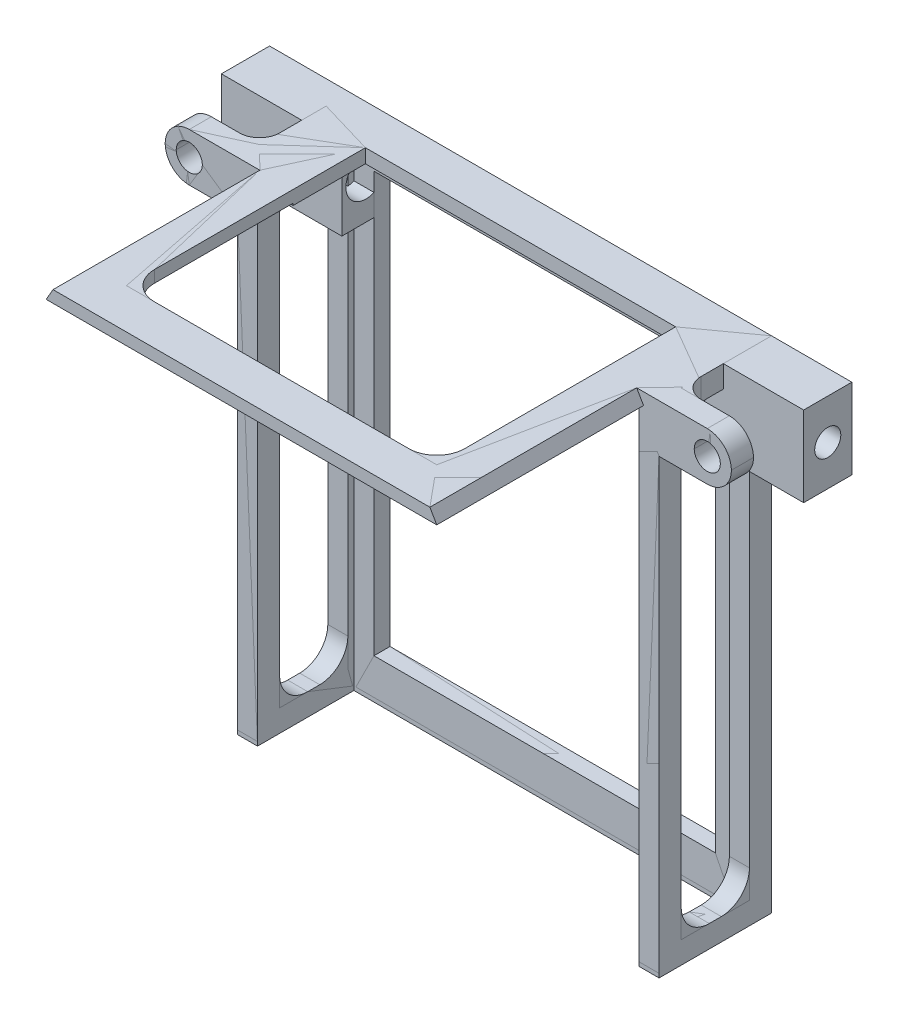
ISO-10303-21;
HEADER;
FILE_DESCRIPTION(('STEP AP214'),'2;1');
FILE_NAME('part.step','',(''),(''),'','','');
FILE_SCHEMA(('AUTOMOTIVE_DESIGN { 1 0 10303 214 1 1 1 1 }'));
ENDSEC;
DATA;
#1=APPLICATION_CONTEXT('core data for automotive mechanical design processes');
#2=APPLICATION_PROTOCOL_DEFINITION('international standard','automotive_design',2000,#1);
#3=PRODUCT_CONTEXT('',#1,'mechanical');
#4=PRODUCT('Part','Part','',(#3));
#5=PRODUCT_RELATED_PRODUCT_CATEGORY('part','',(#4));
#6=PRODUCT_DEFINITION_FORMATION('','',#4);
#7=PRODUCT_DEFINITION_CONTEXT('part definition',#1,'design');
#8=PRODUCT_DEFINITION('design','',#6,#7);
#9=PRODUCT_DEFINITION_SHAPE('','',#8);
#10=(LENGTH_UNIT() NAMED_UNIT(*) SI_UNIT(.MILLI.,.METRE.));
#11=(NAMED_UNIT(*) PLANE_ANGLE_UNIT() SI_UNIT($,.RADIAN.));
#12=(NAMED_UNIT(*) SI_UNIT($,.STERADIAN.) SOLID_ANGLE_UNIT());
#13=UNCERTAINTY_MEASURE_WITH_UNIT(LENGTH_MEASURE(1.E-05),#10,'distance_accuracy_value','');
#14=(GEOMETRIC_REPRESENTATION_CONTEXT(3) GLOBAL_UNCERTAINTY_ASSIGNED_CONTEXT((#13)) GLOBAL_UNIT_ASSIGNED_CONTEXT((#10,
#11,#12)) REPRESENTATION_CONTEXT('',''));
#15=CARTESIAN_POINT('',(0.,0.,0.));
#16=DIRECTION('',(0.,0.,1.));
#17=DIRECTION('',(1.,0.,0.));
#18=AXIS2_PLACEMENT_3D('',#15,#16,#17);
#19=CARTESIAN_POINT('',(42.5,-10.,6.));
#20=DIRECTION('',(1.,0.,0.));
#21=DIRECTION('',(0.,0.,-1.));
#22=AXIS2_PLACEMENT_3D('',#19,#20,#21);
#23=CYLINDRICAL_SURFACE('',#22,3.25);
#24=CARTESIAN_POINT('',(72.5,-10.,6.));
#25=DIRECTION('',(-1.,0.,0.));
#26=DIRECTION('',(0.,0.,1.));
#27=AXIS2_PLACEMENT_3D('',#24,#25,#26);
#28=CIRCLE('',#27,3.25);
#29=CARTESIAN_POINT('',(72.5,-10.,9.25));
#30=VERTEX_POINT('',#29);
#31=EDGE_CURVE('P0_E1555',#30,#30,#28,.T.);
#32=ORIENTED_EDGE('',*,*,#31,.F.);
#33=EDGE_LOOP('',(#32));
#34=FACE_BOUND('',#33,.T.);
#35=CARTESIAN_POINT('',(63.,-10.,6.));
#36=DIRECTION('',(-1.,0.,0.));
#37=DIRECTION('',(0.,0.,1.));
#38=AXIS2_PLACEMENT_3D('',#35,#36,#37);
#39=CIRCLE('',#38,3.25);
#40=CARTESIAN_POINT('',(63.,-10.,9.25));
#41=VERTEX_POINT('',#40);
#42=EDGE_CURVE('P0_E53',#41,#41,#39,.T.);
#43=ORIENTED_EDGE('',*,*,#42,.T.);
#44=EDGE_LOOP('',(#43));
#45=FACE_BOUND('',#44,.T.);
#46=ADVANCED_FACE('P0_F49',(#34,#45),#23,.F.);
#47=CARTESIAN_POINT('',(70.5,-5.5,5.5));
#48=DIRECTION('',(0.,0.,-1.));
#49=DIRECTION('',(0.,-1.,0.));
#50=AXIS2_PLACEMENT_3D('',#47,#48,#49);
#51=PLANE('',#50);
#52=DIRECTION('',(1.,0.,0.));
#53=VECTOR('',#52,1.);
#54=CARTESIAN_POINT('',(70.5,-20.,5.5));
#55=LINE('',#54,#53);
#56=CARTESIAN_POINT('',(47.5,-20.,5.5));
#57=VERTEX_POINT('',#56);
#58=CARTESIAN_POINT('',(52.5,-20.,5.5));
#59=VERTEX_POINT('',#58);
#60=EDGE_CURVE('P0_E1314',#57,#59,#55,.T.);
#61=ORIENTED_EDGE('',*,*,#60,.F.);
#62=DIRECTION('',(0.,1.,0.));
#63=VECTOR('',#62,1.);
#64=CARTESIAN_POINT('',(47.5,-233.16922287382,5.5));
#65=LINE('',#64,#63);
#66=CARTESIAN_POINT('',(47.5,-112.,5.5));
#67=VERTEX_POINT('',#66);
#68=EDGE_CURVE('P0_E1045',#67,#57,#65,.T.);
#69=ORIENTED_EDGE('',*,*,#68,.F.);
#70=DIRECTION('',(-1.,0.,0.));
#71=VECTOR('',#70,1.);
#72=CARTESIAN_POINT('',(52.5,-112.,5.5));
#73=LINE('',#72,#71);
#74=CARTESIAN_POINT('',(52.5,-112.,5.5));
#75=VERTEX_POINT('',#74);
#76=EDGE_CURVE('P0_E722',#67,#75,#73,.F.);
#77=ORIENTED_EDGE('',*,*,#76,.T.);
#78=DIRECTION('',(0.,1.,0.));
#79=VECTOR('',#78,1.);
#80=CARTESIAN_POINT('',(52.5,-135.165468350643,5.5));
#81=LINE('',#80,#79);
#82=EDGE_CURVE('P0_E615',#75,#59,#81,.T.);
#83=ORIENTED_EDGE('',*,*,#82,.T.);
#84=EDGE_LOOP('',(#61,#69,#77,#83));
#85=FACE_BOUND('',#84,.T.);
#86=ADVANCED_FACE('P0_F786',(#85),#51,.F.);
#87=CARTESIAN_POINT('',(47.5,-233.16922287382,4.));
#88=DIRECTION('',(0.,0.,-1.));
#89=DIRECTION('',(0.,-1.,0.));
#90=AXIS2_PLACEMENT_3D('',#87,#88,#89);
#91=PLANE('',#90);
#92=DIRECTION('',(1.,0.,0.));
#93=VECTOR('',#92,1.);
#94=CARTESIAN_POINT('',(47.5,-20.,4.));
#95=LINE('',#94,#93);
#96=CARTESIAN_POINT('',(42.5,-20.,4.));
#97=VERTEX_POINT('',#96);
#98=CARTESIAN_POINT('',(47.5,-20.,4.));
#99=VERTEX_POINT('',#98);
#100=EDGE_CURVE('P0_E1460',#97,#99,#95,.T.);
#101=ORIENTED_EDGE('',*,*,#100,.F.);
#102=DIRECTION('',(0.,1.,0.));
#103=VECTOR('',#102,1.);
#104=CARTESIAN_POINT('',(42.5,-10.,4.));
#105=LINE('',#104,#103);
#106=CARTESIAN_POINT('',(42.5,-114.5,4.));
#107=VERTEX_POINT('',#106);
#108=EDGE_CURVE('P0_E1162',#107,#97,#105,.T.);
#109=ORIENTED_EDGE('',*,*,#108,.F.);
#110=DIRECTION('',(1.,0.,0.));
#111=VECTOR('',#110,1.);
#112=CARTESIAN_POINT('',(42.5,-114.5,4.));
#113=LINE('',#112,#111);
#114=CARTESIAN_POINT('',(-42.5,-114.5,4.));
#115=VERTEX_POINT('',#114);
#116=EDGE_CURVE('P0_E1095',#115,#107,#113,.T.);
#117=ORIENTED_EDGE('',*,*,#116,.F.);
#118=DIRECTION('',(0.,-1.,0.));
#119=VECTOR('',#118,1.);
#120=CARTESIAN_POINT('',(-42.5,-10.,4.));
#121=LINE('',#120,#119);
#122=CARTESIAN_POINT('',(-42.5,-20.,4.));
#123=VERTEX_POINT('',#122);
#124=EDGE_CURVE('P0_E1081',#123,#115,#121,.T.);
#125=ORIENTED_EDGE('',*,*,#124,.F.);
#126=DIRECTION('',(-1.,0.,0.));
#127=VECTOR('',#126,1.);
#128=CARTESIAN_POINT('',(47.5,-20.,4.));
#129=LINE('',#128,#127);
#130=CARTESIAN_POINT('',(-47.5,-20.,4.));
#131=VERTEX_POINT('',#130);
#132=EDGE_CURVE('P0_E1405',#123,#131,#129,.T.);
#133=ORIENTED_EDGE('',*,*,#132,.T.);
#134=DIRECTION('',(0.,1.,0.));
#135=VECTOR('',#134,1.);
#136=CARTESIAN_POINT('',(-47.5,-233.16922287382,4.));
#137=LINE('',#136,#135);
#138=CARTESIAN_POINT('',(-47.5,-123.5,4.));
#139=VERTEX_POINT('',#138);
#140=EDGE_CURVE('P0_E1188',#139,#131,#137,.T.);
#141=ORIENTED_EDGE('',*,*,#140,.F.);
#142=DIRECTION('',(1.,0.,0.));
#143=VECTOR('',#142,1.);
#144=CARTESIAN_POINT('',(47.5,-123.5,4.));
#145=LINE('',#144,#143);
#146=CARTESIAN_POINT('',(47.5,-123.5,4.));
#147=VERTEX_POINT('',#146);
#148=EDGE_CURVE('P0_E1440',#139,#147,#145,.T.);
#149=ORIENTED_EDGE('',*,*,#148,.T.);
#150=DIRECTION('',(0.,1.,0.));
#151=VECTOR('',#150,1.);
#152=CARTESIAN_POINT('',(47.5,-233.16922287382,4.));
#153=LINE('',#152,#151);
#154=EDGE_CURVE('P0_E1148',#147,#99,#153,.T.);
#155=ORIENTED_EDGE('',*,*,#154,.T.);
#156=EDGE_LOOP('',(#101,#109,#117,#125,#133,#141,#149,#155));
#157=FACE_BOUND('',#156,.T.);
#158=ADVANCED_FACE('P0_F793',(#157),#91,.F.);
#159=CARTESIAN_POINT('',(52.5,-135.165468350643,0.));
#160=DIRECTION('',(1.,0.,0.));
#161=DIRECTION('',(0.,0.,-1.));
#162=AXIS2_PLACEMENT_3D('',#159,#160,#161);
#163=PLANE('',#162);
#164=CARTESIAN_POINT('',(52.5,-12.5,12.5));
#165=DIRECTION('',(1.,0.,0.));
#166=DIRECTION('',(0.,0.,-1.));
#167=AXIS2_PLACEMENT_3D('',#164,#165,#166);
#168=CIRCLE('',#167,7.);
#169=CARTESIAN_POINT('',(52.5,-5.5,12.5));
#170=VERTEX_POINT('',#169);
#171=CARTESIAN_POINT('',(52.5,-5.51787997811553,12.));
#172=VERTEX_POINT('',#171);
#173=EDGE_CURVE('P0_E1320',#170,#172,#168,.F.);
#174=ORIENTED_EDGE('',*,*,#173,.T.);
#175=DIRECTION('',(0.,1.,0.));
#176=VECTOR('',#175,1.);
#177=CARTESIAN_POINT('',(52.5,-135.165468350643,12.));
#178=LINE('',#177,#176);
#179=CARTESIAN_POINT('',(52.5,0.,12.));
#180=VERTEX_POINT('',#179);
#181=EDGE_CURVE('P0_E1532',#172,#180,#178,.T.);
#182=ORIENTED_EDGE('',*,*,#181,.T.);
#183=DIRECTION('',(0.,0.,-1.));
#184=VECTOR('',#183,1.);
#185=CARTESIAN_POINT('',(52.5,0.,0.));
#186=LINE('',#185,#184);
#187=CARTESIAN_POINT('',(52.5,0.,17.5));
#188=VERTEX_POINT('',#187);
#189=EDGE_CURVE('P0_E638',#188,#180,#186,.T.);
#190=ORIENTED_EDGE('',*,*,#189,.F.);
#191=DIRECTION('',(0.,-1.,0.));
#192=VECTOR('',#191,1.);
#193=CARTESIAN_POINT('',(52.5,-135.165468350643,17.5));
#194=LINE('',#193,#192);
#195=CARTESIAN_POINT('',(52.5,-5.79179606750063,17.5));
#196=VERTEX_POINT('',#195);
#197=EDGE_CURVE('P0_E681',#188,#196,#194,.T.);
#198=ORIENTED_EDGE('',*,*,#197,.T.);
#199=CARTESIAN_POINT('',(52.5,-12.5,15.5));
#200=DIRECTION('',(1.,0.,0.));
#201=DIRECTION('',(0.,0.,-1.));
#202=AXIS2_PLACEMENT_3D('',#199,#200,#201);
#203=CIRCLE('',#202,7.);
#204=CARTESIAN_POINT('',(52.5,-5.5,15.5));
#205=VERTEX_POINT('',#204);
#206=EDGE_CURVE('P0_E758',#196,#205,#203,.F.);
#207=ORIENTED_EDGE('',*,*,#206,.T.);
#208=DIRECTION('',(0.,0.,1.));
#209=VECTOR('',#208,1.);
#210=CARTESIAN_POINT('',(52.5,-5.5,0.));
#211=LINE('',#210,#209);
#212=EDGE_CURVE('P0_E612',#170,#205,#211,.T.);
#213=ORIENTED_EDGE('',*,*,#212,.F.);
#214=EDGE_LOOP('',(#174,#182,#190,#198,#207,#213));
#215=FACE_BOUND('',#214,.T.);
#216=ADVANCED_FACE('P0_F914',(#215),#163,.T.);
#217=CARTESIAN_POINT('',(70.5,-12.5,12.5));
#218=DIRECTION('',(1.,0.,0.));
#219=DIRECTION('',(0.,0.,-1.));
#220=AXIS2_PLACEMENT_3D('',#217,#218,#219);
#221=CYLINDRICAL_SURFACE('',#220,7.);
#222=DIRECTION('',(1.,0.,0.));
#223=VECTOR('',#222,1.);
#224=CARTESIAN_POINT('',(70.5,-5.51787997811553,12.));
#225=LINE('',#224,#223);
#226=CARTESIAN_POINT('',(47.5,-5.51787997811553,12.));
#227=VERTEX_POINT('',#226);
#228=EDGE_CURVE('P0_E1299',#172,#227,#225,.F.);
#229=ORIENTED_EDGE('',*,*,#228,.F.);
#230=ORIENTED_EDGE('',*,*,#173,.F.);
#231=DIRECTION('',(-1.,0.,0.));
#232=VECTOR('',#231,1.);
#233=CARTESIAN_POINT('',(52.5,-5.5,12.5));
#234=LINE('',#233,#232);
#235=CARTESIAN_POINT('',(47.5,-5.5,12.5));
#236=VERTEX_POINT('',#235);
#237=EDGE_CURVE('P0_E699',#236,#170,#234,.F.);
#238=ORIENTED_EDGE('',*,*,#237,.F.);
#239=CARTESIAN_POINT('',(47.5,-12.5,12.5));
#240=DIRECTION('',(1.,0.,0.));
#241=DIRECTION('',(0.,0.,-1.));
#242=AXIS2_PLACEMENT_3D('',#239,#240,#241);
#243=CIRCLE('',#242,7.);
#244=EDGE_CURVE('P0_E1322',#227,#236,#243,.T.);
#245=ORIENTED_EDGE('',*,*,#244,.F.);
#246=EDGE_LOOP('',(#229,#230,#238,#245));
#247=FACE_BOUND('',#246,.T.);
#248=ADVANCED_FACE('P0_F830',(#247),#221,.F.);
#249=CARTESIAN_POINT('',(-42.5,-10.,6.));
#250=DIRECTION('',(-1.,0.,0.));
#251=DIRECTION('',(0.,0.,1.));
#252=AXIS2_PLACEMENT_3D('',#249,#250,#251);
#253=CYLINDRICAL_SURFACE('',#252,3.25);
#254=CARTESIAN_POINT('',(-72.5,-10.,6.));
#255=DIRECTION('',(-1.,0.,0.));
#256=DIRECTION('',(0.,0.,1.));
#257=AXIS2_PLACEMENT_3D('',#254,#255,#256);
#258=CIRCLE('',#257,3.25);
#259=CARTESIAN_POINT('',(-72.5,-10.,9.25));
#260=VERTEX_POINT('',#259);
#261=EDGE_CURVE('P0_E1303',#260,#260,#258,.T.);
#262=ORIENTED_EDGE('',*,*,#261,.T.);
#263=EDGE_LOOP('',(#262));
#264=FACE_BOUND('',#263,.T.);
#265=CARTESIAN_POINT('',(-63.,-10.,6.));
#266=DIRECTION('',(1.,0.,0.));
#267=DIRECTION('',(0.,0.,-1.));
#268=AXIS2_PLACEMENT_3D('',#265,#266,#267);
#269=CIRCLE('',#268,3.25);
#270=CARTESIAN_POINT('',(-63.,-10.,2.75));
#271=VERTEX_POINT('',#270);
#272=EDGE_CURVE('P0_E1300',#271,#271,#269,.F.);
#273=ORIENTED_EDGE('',*,*,#272,.F.);
#274=EDGE_LOOP('',(#273));
#275=FACE_BOUND('',#274,.T.);
#276=ADVANCED_FACE('P0_F826',(#264,#275),#253,.F.);
#277=CARTESIAN_POINT('',(-52.5,-135.165468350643,0.));
#278=DIRECTION('',(-1.,0.,0.));
#279=DIRECTION('',(0.,0.,1.));
#280=AXIS2_PLACEMENT_3D('',#277,#278,#279);
#281=PLANE('',#280);
#282=DIRECTION('',(0.,1.,0.));
#283=VECTOR('',#282,1.);
#284=CARTESIAN_POINT('',(-52.5,-135.165468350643,12.));
#285=LINE('',#284,#283);
#286=CARTESIAN_POINT('',(-52.5,-5.51787997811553,12.));
#287=VERTEX_POINT('',#286);
#288=CARTESIAN_POINT('',(-52.5,0.,12.));
#289=VERTEX_POINT('',#288);
#290=EDGE_CURVE('P0_E1389',#287,#289,#285,.T.);
#291=ORIENTED_EDGE('',*,*,#290,.F.);
#292=CARTESIAN_POINT('',(-52.5,-12.5,12.5));
#293=DIRECTION('',(-1.,0.,0.));
#294=DIRECTION('',(0.,0.,1.));
#295=AXIS2_PLACEMENT_3D('',#292,#293,#294);
#296=CIRCLE('',#295,7.);
#297=CARTESIAN_POINT('',(-52.5,-5.5,12.5));
#298=VERTEX_POINT('',#297);
#299=EDGE_CURVE('P0_E1329',#287,#298,#296,.F.);
#300=ORIENTED_EDGE('',*,*,#299,.T.);
#301=DIRECTION('',(0.,0.,-1.));
#302=VECTOR('',#301,1.);
#303=CARTESIAN_POINT('',(-52.5,-5.5,5.5));
#304=LINE('',#303,#302);
#305=CARTESIAN_POINT('',(-52.5,-5.5,15.5));
#306=VERTEX_POINT('',#305);
#307=EDGE_CURVE('P0_E1112',#306,#298,#304,.T.);
#308=ORIENTED_EDGE('',*,*,#307,.F.);
#309=CARTESIAN_POINT('',(-52.5,-12.5,15.5));
#310=DIRECTION('',(-1.,0.,0.));
#311=DIRECTION('',(0.,0.,1.));
#312=AXIS2_PLACEMENT_3D('',#309,#310,#311);
#313=CIRCLE('',#312,7.);
#314=CARTESIAN_POINT('',(-52.5,-5.79179606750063,17.5));
#315=VERTEX_POINT('',#314);
#316=EDGE_CURVE('P0_E1343',#306,#315,#313,.F.);
#317=ORIENTED_EDGE('',*,*,#316,.T.);
#318=DIRECTION('',(0.,1.,0.));
#319=VECTOR('',#318,1.);
#320=CARTESIAN_POINT('',(-52.5,-135.165468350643,17.5));
#321=LINE('',#320,#319);
#322=CARTESIAN_POINT('',(-52.5,0.,17.5));
#323=VERTEX_POINT('',#322);
#324=EDGE_CURVE('P0_E675',#315,#323,#321,.T.);
#325=ORIENTED_EDGE('',*,*,#324,.T.);
#326=DIRECTION('',(0.,0.,1.));
#327=VECTOR('',#326,1.);
#328=CARTESIAN_POINT('',(-52.5,0.,0.));
#329=LINE('',#328,#327);
#330=EDGE_CURVE('P0_E1057',#289,#323,#329,.T.);
#331=ORIENTED_EDGE('',*,*,#330,.F.);
#332=EDGE_LOOP('',(#291,#300,#308,#317,#325,#331));
#333=FACE_BOUND('',#332,.T.);
#334=ADVANCED_FACE('P0_F829',(#333),#281,.T.);
#335=CARTESIAN_POINT('',(-64.5,-6.,22.5));
#336=DIRECTION('',(0.,0.,1.));
#337=DIRECTION('',(1.,0.,0.));
#338=AXIS2_PLACEMENT_3D('',#335,#336,#337);
#339=PLANE('',#338);
#340=CARTESIAN_POINT('',(-64.5,-6.,22.5));
#341=DIRECTION('',(0.,0.,1.));
#342=DIRECTION('',(1.,0.,0.));
#343=AXIS2_PLACEMENT_3D('',#340,#341,#342);
#344=CIRCLE('',#343,3.2499999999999);
#345=CARTESIAN_POINT('',(-61.25,-6.,22.5));
#346=VERTEX_POINT('',#345);
#347=CARTESIAN_POINT('',(-67.75,-6.,22.5));
#348=VERTEX_POINT('',#347);
#349=EDGE_CURVE('P0_E626',#346,#348,#344,.T.);
#350=ORIENTED_EDGE('',*,*,#349,.T.);
#351=CARTESIAN_POINT('',(-64.5,-6.,22.5));
#352=DIRECTION('',(0.,0.,1.));
#353=DIRECTION('',(1.,0.,0.));
#354=AXIS2_PLACEMENT_3D('',#351,#352,#353);
#355=CIRCLE('',#354,3.2499999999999);
#356=EDGE_CURVE('P0_E610',#348,#346,#355,.T.);
#357=ORIENTED_EDGE('',*,*,#356,.T.);
#358=EDGE_LOOP('',(#350,#357));
#359=FACE_BOUND('',#358,.T.);
#360=DIRECTION('',(0.,1.,0.));
#361=VECTOR('',#360,1.);
#362=CARTESIAN_POINT('',(-57.5,-6.,22.5));
#363=LINE('',#362,#361);
#364=CARTESIAN_POINT('',(-57.5,0.,22.5));
#365=VERTEX_POINT('',#364);
#366=CARTESIAN_POINT('',(-57.5,-12.,22.5));
#367=VERTEX_POINT('',#366);
#368=EDGE_CURVE('P0_E679',#365,#367,#363,.F.);
#369=ORIENTED_EDGE('',*,*,#368,.T.);
#370=DIRECTION('',(1.,0.,0.));
#371=VECTOR('',#370,1.);
#372=CARTESIAN_POINT('',(-52.5,-12.,22.5));
#373=LINE('',#372,#371);
#374=CARTESIAN_POINT('',(-64.5,-12.,22.5));
#375=VERTEX_POINT('',#374);
#376=EDGE_CURVE('P0_E1093',#375,#367,#373,.T.);
#377=ORIENTED_EDGE('',*,*,#376,.F.);
#378=CARTESIAN_POINT('',(-64.5,-6.,22.5));
#379=DIRECTION('',(0.,0.,1.));
#380=DIRECTION('',(1.,0.,0.));
#381=AXIS2_PLACEMENT_3D('',#378,#379,#380);
#382=CIRCLE('',#381,6.);
#383=CARTESIAN_POINT('',(-64.5,0.,22.5));
#384=VERTEX_POINT('',#383);
#385=EDGE_CURVE('P0_E1099',#384,#375,#382,.T.);
#386=ORIENTED_EDGE('',*,*,#385,.F.);
#387=DIRECTION('',(-1.,0.,0.));
#388=VECTOR('',#387,1.);
#389=CARTESIAN_POINT('',(-64.5,0.,22.5));
#390=LINE('',#389,#388);
#391=EDGE_CURVE('P0_E1059',#365,#384,#390,.T.);
#392=ORIENTED_EDGE('',*,*,#391,.F.);
#393=EDGE_LOOP('',(#369,#377,#386,#392));
#394=FACE_BOUND('',#393,.T.);
#395=ADVANCED_FACE('P0_F895',(#359,#394),#339,.F.);
#396=CARTESIAN_POINT('',(64.5,-6.,22.5));
#397=DIRECTION('',(0.,0.,1.));
#398=DIRECTION('',(1.,0.,0.));
#399=AXIS2_PLACEMENT_3D('',#396,#397,#398);
#400=PLANE('',#399);
#401=DIRECTION('',(0.,-1.,0.));
#402=VECTOR('',#401,1.);
#403=CARTESIAN_POINT('',(47.5,-233.16922287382,22.5));
#404=LINE('',#403,#402);
#405=CARTESIAN_POINT('',(47.5,-12.5,22.5));
#406=VERTEX_POINT('',#405);
#407=CARTESIAN_POINT('',(47.5,-112.,22.5));
#408=VERTEX_POINT('',#407);
#409=EDGE_CURVE('P0_E1044',#406,#408,#404,.T.);
#410=ORIENTED_EDGE('',*,*,#409,.F.);
#411=DIRECTION('',(-1.,0.,0.));
#412=VECTOR('',#411,1.);
#413=CARTESIAN_POINT('',(57.5,-12.5,22.5));
#414=LINE('',#413,#412);
#415=CARTESIAN_POINT('',(52.5,-12.5,22.5));
#416=VERTEX_POINT('',#415);
#417=EDGE_CURVE('P0_E707',#406,#416,#414,.F.);
#418=ORIENTED_EDGE('',*,*,#417,.T.);
#419=DIRECTION('',(0.,-1.,0.));
#420=VECTOR('',#419,1.);
#421=CARTESIAN_POINT('',(52.5,-135.165468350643,22.5));
#422=LINE('',#421,#420);
#423=CARTESIAN_POINT('',(52.5,-112.,22.5));
#424=VERTEX_POINT('',#423);
#425=EDGE_CURVE('P0_E1120',#416,#424,#422,.T.);
#426=ORIENTED_EDGE('',*,*,#425,.T.);
#427=DIRECTION('',(-1.,0.,0.));
#428=VECTOR('',#427,1.);
#429=CARTESIAN_POINT('',(47.5,-112.,22.5));
#430=LINE('',#429,#428);
#431=EDGE_CURVE('P0_E704',#424,#408,#430,.T.);
#432=ORIENTED_EDGE('',*,*,#431,.T.);
#433=EDGE_LOOP('',(#410,#418,#426,#432));
#434=FACE_BOUND('',#433,.T.);
#435=ADVANCED_FACE('P0_F949',(#434),#400,.F.);
#436=CARTESIAN_POINT('',(38.6339745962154,-124.501,69.5));
#437=DIRECTION('',(0.,0.,1.));
#438=DIRECTION('',(1.,0.,0.));
#439=AXIS2_PLACEMENT_3D('',#436,#437,#438);
#440=PLANE('',#439);
#441=DIRECTION('',(1.,0.,0.));
#442=VECTOR('',#441,1.);
#443=CARTESIAN_POINT('',(38.6339745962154,0.,69.5));
#444=LINE('',#443,#442);
#445=CARTESIAN_POINT('',(25.,0.,69.5));
#446=VERTEX_POINT('',#445);
#447=CARTESIAN_POINT('',(31.6339745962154,0.,69.5));
#448=VERTEX_POINT('',#447);
#449=EDGE_CURVE('P0_E648',#446,#448,#444,.T.);
#450=ORIENTED_EDGE('',*,*,#449,.T.);
#451=DIRECTION('',(0.,1.,0.));
#452=VECTOR('',#451,1.);
#453=CARTESIAN_POINT('',(31.6339745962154,-2.96410161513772,69.5));
#454=LINE('',#453,#452);
#455=CARTESIAN_POINT('',(31.6339745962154,-2.96410161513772,69.5));
#456=VERTEX_POINT('',#455);
#457=EDGE_CURVE('P0_E697',#448,#456,#454,.F.);
#458=ORIENTED_EDGE('',*,*,#457,.T.);
#459=DIRECTION('',(-1.,0.,0.));
#460=VECTOR('',#459,1.);
#461=CARTESIAN_POINT('',(38.6339745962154,-2.96410161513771,69.5));
#462=LINE('',#461,#460);
#463=CARTESIAN_POINT('',(25.,-2.96410161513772,69.5));
#464=VERTEX_POINT('',#463);
#465=EDGE_CURVE('P0_E1158',#456,#464,#462,.T.);
#466=ORIENTED_EDGE('',*,*,#465,.T.);
#467=DIRECTION('',(0.,1.,0.));
#468=VECTOR('',#467,1.);
#469=CARTESIAN_POINT('',(25.,-199.9,69.5));
#470=LINE('',#469,#468);
#471=EDGE_CURVE('P0_E1411',#464,#446,#470,.T.);
#472=ORIENTED_EDGE('',*,*,#471,.T.);
#473=EDGE_LOOP('',(#450,#458,#466,#472));
#474=FACE_BOUND('',#473,.T.);
#475=ADVANCED_FACE('P0_F966',(#474),#440,.F.);
#476=CARTESIAN_POINT('',(-47.5,-2.96410161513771,79.5));
#477=DIRECTION('',(0.,1.,0.));
#478=DIRECTION('',(1.,0.,0.));
#479=AXIS2_PLACEMENT_3D('',#476,#477,#478);
#480=PLANE('',#479);
#481=DIRECTION('',(1.,0.,0.));
#482=VECTOR('',#481,1.);
#483=CARTESIAN_POINT('',(-47.5,-2.96410161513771,79.5));
#484=LINE('',#483,#482);
#485=CARTESIAN_POINT('',(25.,-2.96410161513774,79.5));
#486=VERTEX_POINT('',#485);
#487=CARTESIAN_POINT('',(48.6339745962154,-2.96410161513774,79.5));
#488=VERTEX_POINT('',#487);
#489=EDGE_CURVE('P0_E1068',#486,#488,#484,.T.);
#490=ORIENTED_EDGE('',*,*,#489,.F.);
#491=DIRECTION('',(0.,0.,-1.));
#492=VECTOR('',#491,1.);
#493=CARTESIAN_POINT('',(25.,-2.96410161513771,79.5));
#494=LINE('',#493,#492);
#495=EDGE_CURVE('P0_E1425',#486,#464,#494,.T.);
#496=ORIENTED_EDGE('',*,*,#495,.T.);
#497=ORIENTED_EDGE('',*,*,#465,.F.);
#498=CARTESIAN_POINT('',(31.6339745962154,-2.96410161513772,62.5));
#499=DIRECTION('',(0.,1.,0.));
#500=DIRECTION('',(-1.,0.,0.));
#501=AXIS2_PLACEMENT_3D('',#498,#499,#500);
#502=CIRCLE('',#501,7.);
#503=CARTESIAN_POINT('',(38.6339745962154,-2.96410161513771,62.5));
#504=VERTEX_POINT('',#503);
#505=EDGE_CURVE('P0_E740',#456,#504,#502,.T.);
#506=ORIENTED_EDGE('',*,*,#505,.T.);
#507=DIRECTION('',(0.,0.,1.));
#508=VECTOR('',#507,1.);
#509=CARTESIAN_POINT('',(38.6339745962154,-2.96410161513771,69.5));
#510=LINE('',#509,#508);
#511=CARTESIAN_POINT('',(38.6339745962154,-2.96410161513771,28.));
#512=VERTEX_POINT('',#511);
#513=EDGE_CURVE('P0_E1154',#512,#504,#510,.T.);
#514=ORIENTED_EDGE('',*,*,#513,.F.);
#515=DIRECTION('',(1.,0.,0.));
#516=VECTOR('',#515,1.);
#517=CARTESIAN_POINT('',(-47.5,-2.96410161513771,28.));
#518=LINE('',#517,#516);
#519=CARTESIAN_POINT('',(48.6339745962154,-2.96410161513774,28.));
#520=VERTEX_POINT('',#519);
#521=EDGE_CURVE('P0_E582',#512,#520,#518,.T.);
#522=ORIENTED_EDGE('',*,*,#521,.T.);
#523=DIRECTION('',(0.,0.,-1.));
#524=VECTOR('',#523,1.);
#525=CARTESIAN_POINT('',(48.6339745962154,-2.96410161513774,79.5));
#526=LINE('',#525,#524);
#527=EDGE_CURVE('P0_E1138',#488,#520,#526,.T.);
#528=ORIENTED_EDGE('',*,*,#527,.F.);
#529=EDGE_LOOP('',(#490,#496,#497,#506,#514,#522,#528));
#530=FACE_BOUND('',#529,.T.);
#531=ADVANCED_FACE('P0_F973',(#530),#480,.F.);
#532=CARTESIAN_POINT('',(-52.5,-135.165468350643,79.5));
#533=DIRECTION('',(0.,0.,1.));
#534=DIRECTION('',(1.,0.,0.));
#535=AXIS2_PLACEMENT_3D('',#532,#533,#534);
#536=PLANE('',#535);
#537=DIRECTION('',(0.,1.,0.));
#538=VECTOR('',#537,1.);
#539=CARTESIAN_POINT('',(25.,-199.9,79.5));
#540=LINE('',#539,#538);
#541=CARTESIAN_POINT('',(24.9999999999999,0.,79.5));
#542=VERTEX_POINT('',#541);
#543=EDGE_CURVE('P0_E1412',#486,#542,#540,.T.);
#544=ORIENTED_EDGE('',*,*,#543,.F.);
#545=ORIENTED_EDGE('',*,*,#489,.T.);
#546=DIRECTION('',(-0.5,0.86602540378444,0.));
#547=VECTOR('',#546,1.);
#548=CARTESIAN_POINT('',(124.28222249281,-133.990710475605,79.5));
#549=LINE('',#548,#547);
#550=CARTESIAN_POINT('',(46.9226497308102,0.,79.5));
#551=VERTEX_POINT('',#550);
#552=EDGE_CURVE('P0_E668',#488,#551,#549,.T.);
#553=ORIENTED_EDGE('',*,*,#552,.T.);
#554=DIRECTION('',(1.,0.,0.));
#555=VECTOR('',#554,1.);
#556=CARTESIAN_POINT('',(-52.5,0.,79.5));
#557=LINE('',#556,#555);
#558=EDGE_CURVE('P0_E649',#542,#551,#557,.T.);
#559=ORIENTED_EDGE('',*,*,#558,.F.);
#560=EDGE_LOOP('',(#544,#545,#553,#559));
#561=FACE_BOUND('',#560,.T.);
#562=ADVANCED_FACE('P0_F869',(#561),#536,.T.);
#563=CARTESIAN_POINT('',(70.5,-5.5,5.5));
#564=DIRECTION('',(0.,1.,0.));
#565=DIRECTION('',(1.,0.,0.));
#566=AXIS2_PLACEMENT_3D('',#563,#564,#565);
#567=PLANE('',#566);
#568=ORIENTED_EDGE('',*,*,#212,.T.);
#569=DIRECTION('',(-1.,0.,0.));
#570=VECTOR('',#569,1.);
#571=CARTESIAN_POINT('',(47.5,-5.5,15.5));
#572=LINE('',#571,#570);
#573=CARTESIAN_POINT('',(47.5,-5.5,15.5));
#574=VERTEX_POINT('',#573);
#575=EDGE_CURVE('P0_E701',#205,#574,#572,.T.);
#576=ORIENTED_EDGE('',*,*,#575,.T.);
#577=DIRECTION('',(0.,0.,1.));
#578=VECTOR('',#577,1.);
#579=CARTESIAN_POINT('',(47.5,-5.5,4.));
#580=LINE('',#579,#578);
#581=EDGE_CURVE('P0_E1041',#236,#574,#580,.T.);
#582=ORIENTED_EDGE('',*,*,#581,.F.);
#583=ORIENTED_EDGE('',*,*,#237,.T.);
#584=EDGE_LOOP('',(#568,#576,#582,#583));
#585=FACE_BOUND('',#584,.T.);
#586=ADVANCED_FACE('P0_F866',(#585),#567,.F.);
#587=CARTESIAN_POINT('',(70.5,-119.,5.5));
#588=DIRECTION('',(0.,-1.,0.));
#589=DIRECTION('',(0.,0.,-1.));
#590=AXIS2_PLACEMENT_3D('',#587,#588,#589);
#591=PLANE('',#590);
#592=DIRECTION('',(0.,0.,-1.));
#593=VECTOR('',#592,1.);
#594=CARTESIAN_POINT('',(52.5,-119.,0.));
#595=LINE('',#594,#593);
#596=CARTESIAN_POINT('',(52.5,-119.,15.5));
#597=VERTEX_POINT('',#596);
#598=CARTESIAN_POINT('',(52.5,-119.,12.5));
#599=VERTEX_POINT('',#598);
#600=EDGE_CURVE('P0_E1062',#597,#599,#595,.T.);
#601=ORIENTED_EDGE('',*,*,#600,.T.);
#602=DIRECTION('',(-1.,0.,0.));
#603=VECTOR('',#602,1.);
#604=CARTESIAN_POINT('',(47.5,-119.,12.5));
#605=LINE('',#604,#603);
#606=CARTESIAN_POINT('',(47.5,-119.,12.5));
#607=VERTEX_POINT('',#606);
#608=EDGE_CURVE('P0_E726',#599,#607,#605,.T.);
#609=ORIENTED_EDGE('',*,*,#608,.T.);
#610=DIRECTION('',(0.,0.,-1.));
#611=VECTOR('',#610,1.);
#612=CARTESIAN_POINT('',(47.5,-119.,4.));
#613=LINE('',#612,#611);
#614=CARTESIAN_POINT('',(47.5,-119.,15.5));
#615=VERTEX_POINT('',#614);
#616=EDGE_CURVE('P0_E1151',#615,#607,#613,.T.);
#617=ORIENTED_EDGE('',*,*,#616,.F.);
#618=DIRECTION('',(-1.,0.,0.));
#619=VECTOR('',#618,1.);
#620=CARTESIAN_POINT('',(52.5,-119.,15.5));
#621=LINE('',#620,#619);
#622=EDGE_CURVE('P0_E724',#615,#597,#621,.F.);
#623=ORIENTED_EDGE('',*,*,#622,.T.);
#624=EDGE_LOOP('',(#601,#609,#617,#623));
#625=FACE_BOUND('',#624,.T.);
#626=ADVANCED_FACE('P0_F864',(#625),#591,.F.);
#627=CARTESIAN_POINT('',(70.5,-5.5,5.5));
#628=DIRECTION('',(0.,0.,-1.));
#629=DIRECTION('',(0.,-1.,0.));
#630=AXIS2_PLACEMENT_3D('',#627,#628,#629);
#631=PLANE('',#630);
#632=DIRECTION('',(0.,-1.,0.));
#633=VECTOR('',#632,1.);
#634=CARTESIAN_POINT('',(-47.5,-233.16922287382,5.5));
#635=LINE('',#634,#633);
#636=CARTESIAN_POINT('',(-47.5,-20.,5.5));
#637=VERTEX_POINT('',#636);
#638=CARTESIAN_POINT('',(-47.5,-112.,5.5));
#639=VERTEX_POINT('',#638);
#640=EDGE_CURVE('P0_E637',#637,#639,#635,.T.);
#641=ORIENTED_EDGE('',*,*,#640,.F.);
#642=DIRECTION('',(-1.,0.,0.));
#643=VECTOR('',#642,1.);
#644=CARTESIAN_POINT('',(70.5,-20.,5.5));
#645=LINE('',#644,#643);
#646=CARTESIAN_POINT('',(-52.5,-20.,5.5));
#647=VERTEX_POINT('',#646);
#648=EDGE_CURVE('P0_E1402',#637,#647,#645,.T.);
#649=ORIENTED_EDGE('',*,*,#648,.T.);
#650=DIRECTION('',(0.,-1.,0.));
#651=VECTOR('',#650,1.);
#652=CARTESIAN_POINT('',(-52.5,-5.5,5.5));
#653=LINE('',#652,#651);
#654=CARTESIAN_POINT('',(-52.5,-112.,5.5));
#655=VERTEX_POINT('',#654);
#656=EDGE_CURVE('P0_E1027',#647,#655,#653,.T.);
#657=ORIENTED_EDGE('',*,*,#656,.T.);
#658=DIRECTION('',(-1.,0.,0.));
#659=VECTOR('',#658,1.);
#660=CARTESIAN_POINT('',(-47.5,-112.,5.49999999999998));
#661=LINE('',#660,#659);
#662=EDGE_CURVE('P0_E719',#655,#639,#661,.F.);
#663=ORIENTED_EDGE('',*,*,#662,.T.);
#664=EDGE_LOOP('',(#641,#649,#657,#663));
#665=FACE_BOUND('',#664,.T.);
#666=ADVANCED_FACE('P0_F860',(#665),#631,.F.);
#667=CARTESIAN_POINT('',(70.5,-5.5,5.5));
#668=DIRECTION('',(0.,1.,0.));
#669=DIRECTION('',(1.,0.,0.));
#670=AXIS2_PLACEMENT_3D('',#667,#668,#669);
#671=PLANE('',#670);
#672=DIRECTION('',(0.,0.,-1.));
#673=VECTOR('',#672,1.);
#674=CARTESIAN_POINT('',(-47.5,-5.5,4.));
#675=LINE('',#674,#673);
#676=CARTESIAN_POINT('',(-47.5,-5.5,15.5));
#677=VERTEX_POINT('',#676);
#678=CARTESIAN_POINT('',(-47.5,-5.5,12.5));
#679=VERTEX_POINT('',#678);
#680=EDGE_CURVE('P0_E1078',#677,#679,#675,.T.);
#681=ORIENTED_EDGE('',*,*,#680,.F.);
#682=DIRECTION('',(-1.,0.,0.));
#683=VECTOR('',#682,1.);
#684=CARTESIAN_POINT('',(-57.5,-5.5,15.5));
#685=LINE('',#684,#683);
#686=EDGE_CURVE('P0_E711',#677,#306,#685,.T.);
#687=ORIENTED_EDGE('',*,*,#686,.T.);
#688=ORIENTED_EDGE('',*,*,#307,.T.);
#689=DIRECTION('',(-1.,0.,0.));
#690=VECTOR('',#689,1.);
#691=CARTESIAN_POINT('',(-47.5,-5.5,12.5));
#692=LINE('',#691,#690);
#693=EDGE_CURVE('P0_E709',#298,#679,#692,.F.);
#694=ORIENTED_EDGE('',*,*,#693,.T.);
#695=EDGE_LOOP('',(#681,#687,#688,#694));
#696=FACE_BOUND('',#695,.T.);
#697=ADVANCED_FACE('P0_F863',(#696),#671,.F.);
#698=CARTESIAN_POINT('',(70.5,-119.,5.5));
#699=DIRECTION('',(0.,-1.,0.));
#700=DIRECTION('',(0.,0.,-1.));
#701=AXIS2_PLACEMENT_3D('',#698,#699,#700);
#702=PLANE('',#701);
#703=DIRECTION('',(0.,0.,1.));
#704=VECTOR('',#703,1.);
#705=CARTESIAN_POINT('',(-52.5,-119.,5.5));
#706=LINE('',#705,#704);
#707=CARTESIAN_POINT('',(-52.5,-119.,12.5));
#708=VERTEX_POINT('',#707);
#709=CARTESIAN_POINT('',(-52.5,-119.,15.5));
#710=VERTEX_POINT('',#709);
#711=EDGE_CURVE('P0_E1100',#708,#710,#706,.T.);
#712=ORIENTED_EDGE('',*,*,#711,.T.);
#713=DIRECTION('',(-1.,0.,0.));
#714=VECTOR('',#713,1.);
#715=CARTESIAN_POINT('',(-47.5,-119.,15.5));
#716=LINE('',#715,#714);
#717=CARTESIAN_POINT('',(-47.5,-119.,15.5));
#718=VERTEX_POINT('',#717);
#719=EDGE_CURVE('P0_E732',#710,#718,#716,.F.);
#720=ORIENTED_EDGE('',*,*,#719,.T.);
#721=DIRECTION('',(0.,0.,1.));
#722=VECTOR('',#721,1.);
#723=CARTESIAN_POINT('',(-47.5,-119.,4.));
#724=LINE('',#723,#722);
#725=CARTESIAN_POINT('',(-47.5,-119.,12.5));
#726=VERTEX_POINT('',#725);
#727=EDGE_CURVE('P0_E633',#726,#718,#724,.T.);
#728=ORIENTED_EDGE('',*,*,#727,.F.);
#729=DIRECTION('',(-1.,0.,0.));
#730=VECTOR('',#729,1.);
#731=CARTESIAN_POINT('',(-52.5,-119.,12.5));
#732=LINE('',#731,#730);
#733=EDGE_CURVE('P0_E729',#726,#708,#732,.T.);
#734=ORIENTED_EDGE('',*,*,#733,.T.);
#735=EDGE_LOOP('',(#712,#720,#728,#734));
#736=FACE_BOUND('',#735,.T.);
#737=ADVANCED_FACE('P0_F929',(#736),#702,.F.);
#738=CARTESIAN_POINT('',(38.6339745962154,-124.501,10.));
#739=DIRECTION('',(0.,0.,-1.));
#740=DIRECTION('',(-1.,0.,0.));
#741=AXIS2_PLACEMENT_3D('',#738,#739,#740);
#742=PLANE('',#741);
#743=DIRECTION('',(0.,1.,0.));
#744=VECTOR('',#743,1.);
#745=CARTESIAN_POINT('',(38.6339745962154,-124.501,10.));
#746=LINE('',#745,#744);
#747=CARTESIAN_POINT('',(38.6339745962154,-3.46410161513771,10.));
#748=VERTEX_POINT('',#747);
#749=CARTESIAN_POINT('',(38.6339745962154,0.,10.));
#750=VERTEX_POINT('',#749);
#751=EDGE_CURVE('P0_E1053',#748,#750,#746,.T.);
#752=ORIENTED_EDGE('',*,*,#751,.T.);
#753=DIRECTION('',(-1.,0.,0.));
#754=VECTOR('',#753,1.);
#755=CARTESIAN_POINT('',(38.6339745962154,0.,10.));
#756=LINE('',#755,#754);
#757=CARTESIAN_POINT('',(-38.6339745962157,0.,10.));
#758=VERTEX_POINT('',#757);
#759=EDGE_CURVE('P0_E617',#750,#758,#756,.T.);
#760=ORIENTED_EDGE('',*,*,#759,.T.);
#761=DIRECTION('',(0.,1.,0.));
#762=VECTOR('',#761,1.);
#763=CARTESIAN_POINT('',(-38.6339745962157,-124.501,10.));
#764=LINE('',#763,#762);
#765=CARTESIAN_POINT('',(-38.6339745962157,-3.46410161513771,10.));
#766=VERTEX_POINT('',#765);
#767=EDGE_CURVE('P0_E676',#766,#758,#764,.T.);
#768=ORIENTED_EDGE('',*,*,#767,.F.);
#769=DIRECTION('',(-1.,0.,0.));
#770=VECTOR('',#769,1.);
#771=CARTESIAN_POINT('',(38.6339745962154,-3.46410161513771,10.));
#772=LINE('',#771,#770);
#773=EDGE_CURVE('P0_E595',#748,#766,#772,.T.);
#774=ORIENTED_EDGE('',*,*,#773,.F.);
#775=EDGE_LOOP('',(#752,#760,#768,#774));
#776=FACE_BOUND('',#775,.T.);
#777=ADVANCED_FACE('P0_F961',(#776),#742,.F.);
#778=CARTESIAN_POINT('',(-38.6339745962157,-124.501,69.5));
#779=DIRECTION('',(-1.,0.,0.));
#780=DIRECTION('',(0.,0.,1.));
#781=AXIS2_PLACEMENT_3D('',#778,#779,#780);
#782=PLANE('',#781);
#783=DIRECTION('',(0.,0.,1.));
#784=VECTOR('',#783,1.);
#785=CARTESIAN_POINT('',(-38.6339745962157,0.,69.5));
#786=LINE('',#785,#784);
#787=CARTESIAN_POINT('',(-38.6339745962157,0.,62.5));
#788=VERTEX_POINT('',#787);
#789=EDGE_CURVE('P0_E622',#758,#788,#786,.T.);
#790=ORIENTED_EDGE('',*,*,#789,.T.);
#791=DIRECTION('',(0.,1.,0.));
#792=VECTOR('',#791,1.);
#793=CARTESIAN_POINT('',(-38.6339745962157,-2.96410161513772,62.5));
#794=LINE('',#793,#792);
#795=CARTESIAN_POINT('',(-38.6339745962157,-2.96410161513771,62.5));
#796=VERTEX_POINT('',#795);
#797=EDGE_CURVE('P0_E692',#788,#796,#794,.F.);
#798=ORIENTED_EDGE('',*,*,#797,.T.);
#799=DIRECTION('',(0.,0.,-1.));
#800=VECTOR('',#799,1.);
#801=CARTESIAN_POINT('',(-38.6339745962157,-2.96410161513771,69.5));
#802=LINE('',#801,#800);
#803=CARTESIAN_POINT('',(-38.6339745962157,-2.96410161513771,28.));
#804=VERTEX_POINT('',#803);
#805=EDGE_CURVE('P0_E1085',#796,#804,#802,.T.);
#806=ORIENTED_EDGE('',*,*,#805,.T.);
#807=DIRECTION('',(0.,-1.,0.));
#808=VECTOR('',#807,1.);
#809=CARTESIAN_POINT('',(-38.6339745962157,-124.501,28.));
#810=LINE('',#809,#808);
#811=CARTESIAN_POINT('',(-38.6339745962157,-3.46410161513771,28.));
#812=VERTEX_POINT('',#811);
#813=EDGE_CURVE('P0_E1019',#804,#812,#810,.T.);
#814=ORIENTED_EDGE('',*,*,#813,.T.);
#815=DIRECTION('',(0.,0.,1.));
#816=VECTOR('',#815,1.);
#817=CARTESIAN_POINT('',(-38.6339745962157,-3.46410161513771,69.5));
#818=LINE('',#817,#816);
#819=EDGE_CURVE('P0_E590',#766,#812,#818,.T.);
#820=ORIENTED_EDGE('',*,*,#819,.F.);
#821=ORIENTED_EDGE('',*,*,#767,.T.);
#822=EDGE_LOOP('',(#790,#798,#806,#814,#820,#821));
#823=FACE_BOUND('',#822,.T.);
#824=ADVANCED_FACE('P0_F908',(#823),#782,.F.);
#825=CARTESIAN_POINT('',(38.6339745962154,-124.501,69.5));
#826=DIRECTION('',(1.,0.,0.));
#827=DIRECTION('',(0.,1.,0.));
#828=AXIS2_PLACEMENT_3D('',#825,#826,#827);
#829=PLANE('',#828);
#830=ORIENTED_EDGE('',*,*,#513,.T.);
#831=DIRECTION('',(0.,1.,0.));
#832=VECTOR('',#831,1.);
#833=CARTESIAN_POINT('',(38.6339745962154,0.,62.5));
#834=LINE('',#833,#832);
#835=CARTESIAN_POINT('',(38.6339745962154,0.,62.5));
#836=VERTEX_POINT('',#835);
#837=EDGE_CURVE('P0_E694',#504,#836,#834,.T.);
#838=ORIENTED_EDGE('',*,*,#837,.T.);
#839=DIRECTION('',(0.,0.,-1.));
#840=VECTOR('',#839,1.);
#841=CARTESIAN_POINT('',(38.6339745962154,0.,69.5));
#842=LINE('',#841,#840);
#843=EDGE_CURVE('P0_E621',#836,#750,#842,.T.);
#844=ORIENTED_EDGE('',*,*,#843,.T.);
#845=ORIENTED_EDGE('',*,*,#751,.F.);
#846=DIRECTION('',(0.,0.,-1.));
#847=VECTOR('',#846,1.);
#848=CARTESIAN_POINT('',(38.6339745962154,-3.46410161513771,69.5));
#849=LINE('',#848,#847);
#850=CARTESIAN_POINT('',(38.6339745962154,-3.46410161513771,28.));
#851=VERTEX_POINT('',#850);
#852=EDGE_CURVE('P0_E641',#851,#748,#849,.T.);
#853=ORIENTED_EDGE('',*,*,#852,.F.);
#854=DIRECTION('',(0.,1.,0.));
#855=VECTOR('',#854,1.);
#856=CARTESIAN_POINT('',(38.6339745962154,-124.501,28.));
#857=LINE('',#856,#855);
#858=EDGE_CURVE('P0_E1073',#851,#512,#857,.T.);
#859=ORIENTED_EDGE('',*,*,#858,.T.);
#860=EDGE_LOOP('',(#830,#838,#844,#845,#853,#859));
#861=FACE_BOUND('',#860,.T.);
#862=ADVANCED_FACE('P0_F905',(#861),#829,.F.);
#863=CARTESIAN_POINT('',(-25.0000000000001,-2.96410161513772,69.5));
#864=VERTEX_POINT('',#863);
#865=CARTESIAN_POINT('',(-31.6339745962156,-2.96410161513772,69.5));
#866=VERTEX_POINT('',#865);
#867=EDGE_CURVE('P0_E1228',#864,#866,#462,.T.);
#868=ORIENTED_EDGE('',*,*,#867,.T.);
#869=DIRECTION('',(0.,1.,0.));
#870=VECTOR('',#869,1.);
#871=CARTESIAN_POINT('',(-31.6339745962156,0.,69.5));
#872=LINE('',#871,#870);
#873=CARTESIAN_POINT('',(-31.6339745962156,0.,69.5));
#874=VERTEX_POINT('',#873);
#875=EDGE_CURVE('P0_E689',#866,#874,#872,.T.);
#876=ORIENTED_EDGE('',*,*,#875,.T.);
#877=CARTESIAN_POINT('',(-25.,0.,69.5));
#878=VERTEX_POINT('',#877);
#879=EDGE_CURVE('P0_E1077',#874,#878,#444,.T.);
#880=ORIENTED_EDGE('',*,*,#879,.T.);
#881=DIRECTION('',(0.,1.,0.));
#882=VECTOR('',#881,1.);
#883=CARTESIAN_POINT('',(-25.0000000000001,-199.9,69.5));
#884=LINE('',#883,#882);
#885=EDGE_CURVE('P0_E1418',#864,#878,#884,.T.);
#886=ORIENTED_EDGE('',*,*,#885,.F.);
#887=EDGE_LOOP('',(#868,#876,#880,#886));
#888=FACE_BOUND('',#887,.T.);
#889=ADVANCED_FACE('P0_F898',(#888),#440,.F.);
#890=CARTESIAN_POINT('',(42.5,-114.5,79.501));
#891=DIRECTION('',(0.,-1.,0.));
#892=DIRECTION('',(0.,0.,-1.));
#893=AXIS2_PLACEMENT_3D('',#890,#891,#892);
#894=PLANE('',#893);
#895=ORIENTED_EDGE('',*,*,#116,.T.);
#896=DIRECTION('',(0.,0.,-1.));
#897=VECTOR('',#896,1.);
#898=CARTESIAN_POINT('',(42.5,-114.5,79.501));
#899=LINE('',#898,#897);
#900=CARTESIAN_POINT('',(42.5,-114.5,0.));
#901=VERTEX_POINT('',#900);
#902=EDGE_CURVE('P0_E558',#107,#901,#899,.T.);
#903=ORIENTED_EDGE('',*,*,#902,.T.);
#904=DIRECTION('',(-1.,0.,0.));
#905=VECTOR('',#904,1.);
#906=CARTESIAN_POINT('',(42.5,-114.5,0.));
#907=LINE('',#906,#905);
#908=CARTESIAN_POINT('',(-42.5,-114.5,0.));
#909=VERTEX_POINT('',#908);
#910=EDGE_CURVE('P0_E1108',#901,#909,#907,.T.);
#911=ORIENTED_EDGE('',*,*,#910,.T.);
#912=DIRECTION('',(0.,0.,-1.));
#913=VECTOR('',#912,1.);
#914=CARTESIAN_POINT('',(-42.5,-114.5,79.501));
#915=LINE('',#914,#913);
#916=EDGE_CURVE('P0_E588',#115,#909,#915,.T.);
#917=ORIENTED_EDGE('',*,*,#916,.F.);
#918=EDGE_LOOP('',(#895,#903,#911,#917));
#919=FACE_BOUND('',#918,.T.);
#920=ADVANCED_FACE('P0_F858',(#919),#894,.F.);
#921=CARTESIAN_POINT('',(-42.5,-10.,79.501));
#922=DIRECTION('',(-1.,0.,0.));
#923=DIRECTION('',(0.,0.,1.));
#924=AXIS2_PLACEMENT_3D('',#921,#922,#923);
#925=PLANE('',#924);
#926=DIRECTION('',(0.,0.,-1.));
#927=VECTOR('',#926,1.);
#928=CARTESIAN_POINT('',(-42.5,-10.,79.501));
#929=LINE('',#928,#927);
#930=CARTESIAN_POINT('',(-42.5,-10.,0.999999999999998));
#931=VERTEX_POINT('',#930);
#932=CARTESIAN_POINT('',(-42.5,-10.,0.));
#933=VERTEX_POINT('',#932);
#934=EDGE_CURVE('P0_E589',#931,#933,#929,.T.);
#935=ORIENTED_EDGE('',*,*,#934,.F.);
#936=CARTESIAN_POINT('',(-42.5,-10.,6.));
#937=DIRECTION('',(1.,0.,0.));
#938=DIRECTION('',(0.,0.,-1.));
#939=AXIS2_PLACEMENT_3D('',#936,#937,#938);
#940=CIRCLE('',#939,5.);
#941=CARTESIAN_POINT('',(-42.5,-5.41742430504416,4.));
#942=VERTEX_POINT('',#941);
#943=EDGE_CURVE('P0_E1468',#942,#931,#940,.T.);
#944=ORIENTED_EDGE('',*,*,#943,.F.);
#945=DIRECTION('',(0.,-1.,0.));
#946=VECTOR('',#945,1.);
#947=CARTESIAN_POINT('',(-42.5,-233.16922287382,4.));
#948=LINE('',#947,#946);
#949=CARTESIAN_POINT('',(-42.5,-3.46410161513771,4.));
#950=VERTEX_POINT('',#949);
#951=EDGE_CURVE('P0_E1391',#950,#942,#948,.T.);
#952=ORIENTED_EDGE('',*,*,#951,.F.);
#953=DIRECTION('',(0.,0.,1.));
#954=VECTOR('',#953,1.);
#955=CARTESIAN_POINT('',(-42.5,-3.46410161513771,182.060587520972));
#956=LINE('',#955,#954);
#957=CARTESIAN_POINT('',(-42.5,-3.46410161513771,12.));
#958=VERTEX_POINT('',#957);
#959=EDGE_CURVE('P0_E1296',#950,#958,#956,.T.);
#960=ORIENTED_EDGE('',*,*,#959,.T.);
#961=DIRECTION('',(0.,1.,0.));
#962=VECTOR('',#961,1.);
#963=CARTESIAN_POINT('',(-42.5,-20.,12.));
#964=LINE('',#963,#962);
#965=CARTESIAN_POINT('',(-42.5,-20.,12.));
#966=VERTEX_POINT('',#965);
#967=EDGE_CURVE('P0_E1491',#966,#958,#964,.T.);
#968=ORIENTED_EDGE('',*,*,#967,.F.);
#969=DIRECTION('',(0.,0.,1.));
#970=VECTOR('',#969,1.);
#971=CARTESIAN_POINT('',(-42.5,-20.,0.));
#972=LINE('',#971,#970);
#973=EDGE_CURVE('P0_E1493',#123,#966,#972,.T.);
#974=ORIENTED_EDGE('',*,*,#973,.F.);
#975=ORIENTED_EDGE('',*,*,#124,.T.);
#976=ORIENTED_EDGE('',*,*,#916,.T.);
#977=DIRECTION('',(0.,1.,0.));
#978=VECTOR('',#977,1.);
#979=CARTESIAN_POINT('',(-42.5,-10.,0.));
#980=LINE('',#979,#978);
#981=EDGE_CURVE('P0_E1113',#909,#933,#980,.T.);
#982=ORIENTED_EDGE('',*,*,#981,.T.);
#983=EDGE_LOOP('',(#935,#944,#952,#960,#968,#974,#975,#976,#982));
#984=FACE_BOUND('',#983,.T.);
#985=ADVANCED_FACE('P0_F855',(#984),#925,.F.);
#986=CARTESIAN_POINT('',(42.5,-10.,79.501));
#987=DIRECTION('',(0.,1.,0.));
#988=DIRECTION('',(1.,0.,0.));
#989=AXIS2_PLACEMENT_3D('',#986,#987,#988);
#990=PLANE('',#989);
#991=DIRECTION('',(-1.,0.,0.));
#992=VECTOR('',#991,1.);
#993=CARTESIAN_POINT('',(42.5,-10.,4.));
#994=LINE('',#993,#992);
#995=CARTESIAN_POINT('',(42.5,-10.,4.));
#996=VERTEX_POINT('',#995);
#997=CARTESIAN_POINT('',(-42.5,-10.,4.));
#998=VERTEX_POINT('',#997);
#999=EDGE_CURVE('P0_E1190',#996,#998,#994,.T.);
#1000=ORIENTED_EDGE('',*,*,#999,.T.);
#1001=EDGE_CURVE('P0_E584',#998,#931,#929,.T.);
#1002=ORIENTED_EDGE('',*,*,#1001,.T.);
#1003=ORIENTED_EDGE('',*,*,#934,.T.);
#1004=DIRECTION('',(1.,0.,0.));
#1005=VECTOR('',#1004,1.);
#1006=CARTESIAN_POINT('',(42.5,-10.,0.));
#1007=LINE('',#1006,#1005);
#1008=CARTESIAN_POINT('',(42.5,-10.,0.));
#1009=VERTEX_POINT('',#1008);
#1010=EDGE_CURVE('P0_E574',#933,#1009,#1007,.T.);
#1011=ORIENTED_EDGE('',*,*,#1010,.T.);
#1012=DIRECTION('',(0.,0.,-1.));
#1013=VECTOR('',#1012,1.);
#1014=CARTESIAN_POINT('',(42.5,-10.,79.501));
#1015=LINE('',#1014,#1013);
#1016=CARTESIAN_POINT('',(42.5,-10.,1.));
#1017=VERTEX_POINT('',#1016);
#1018=EDGE_CURVE('P0_E559',#1017,#1009,#1015,.T.);
#1019=ORIENTED_EDGE('',*,*,#1018,.F.);
#1020=EDGE_CURVE('P0_E549',#996,#1017,#1015,.T.);
#1021=ORIENTED_EDGE('',*,*,#1020,.F.);
#1022=EDGE_LOOP('',(#1000,#1002,#1003,#1011,#1019,#1021));
#1023=FACE_BOUND('',#1022,.T.);
#1024=ADVANCED_FACE('P0_F572',(#1023),#990,.F.);
#1025=CARTESIAN_POINT('',(42.5,-10.,79.501));
#1026=DIRECTION('',(1.,0.,0.));
#1027=DIRECTION('',(0.,1.,0.));
#1028=AXIS2_PLACEMENT_3D('',#1025,#1026,#1027);
#1029=PLANE('',#1028);
#1030=CARTESIAN_POINT('',(42.5,-10.,6.));
#1031=DIRECTION('',(1.,0.,0.));
#1032=DIRECTION('',(0.,0.,-1.));
#1033=AXIS2_PLACEMENT_3D('',#1030,#1031,#1032);
#1034=CIRCLE('',#1033,5.);
#1035=CARTESIAN_POINT('',(42.5,-5.41742430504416,4.));
#1036=VERTEX_POINT('',#1035);
#1037=EDGE_CURVE('P0_E564',#1036,#1017,#1034,.T.);
#1038=ORIENTED_EDGE('',*,*,#1037,.T.);
#1039=ORIENTED_EDGE('',*,*,#1018,.T.);
#1040=DIRECTION('',(0.,-1.,0.));
#1041=VECTOR('',#1040,1.);
#1042=CARTESIAN_POINT('',(42.5,-10.,0.));
#1043=LINE('',#1042,#1041);
#1044=EDGE_CURVE('P0_E667',#1009,#901,#1043,.T.);
#1045=ORIENTED_EDGE('',*,*,#1044,.T.);
#1046=ORIENTED_EDGE('',*,*,#902,.F.);
#1047=ORIENTED_EDGE('',*,*,#108,.T.);
#1048=DIRECTION('',(0.,0.,1.));
#1049=VECTOR('',#1048,1.);
#1050=CARTESIAN_POINT('',(42.5,-20.,0.));
#1051=LINE('',#1050,#1049);
#1052=CARTESIAN_POINT('',(42.5,-20.,12.));
#1053=VERTEX_POINT('',#1052);
#1054=EDGE_CURVE('P0_E1455',#97,#1053,#1051,.T.);
#1055=ORIENTED_EDGE('',*,*,#1054,.T.);
#1056=DIRECTION('',(0.,1.,0.));
#1057=VECTOR('',#1056,1.);
#1058=CARTESIAN_POINT('',(42.5,-20.,12.));
#1059=LINE('',#1058,#1057);
#1060=CARTESIAN_POINT('',(42.5,-3.46410161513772,12.));
#1061=VERTEX_POINT('',#1060);
#1062=EDGE_CURVE('P0_E1542',#1053,#1061,#1059,.T.);
#1063=ORIENTED_EDGE('',*,*,#1062,.T.);
#1064=DIRECTION('',(0.,0.,-1.));
#1065=VECTOR('',#1064,1.);
#1066=CARTESIAN_POINT('',(42.5,-3.46410161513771,182.060587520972));
#1067=LINE('',#1066,#1065);
#1068=CARTESIAN_POINT('',(42.5,-3.46410161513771,4.));
#1069=VERTEX_POINT('',#1068);
#1070=EDGE_CURVE('P0_E11',#1061,#1069,#1067,.T.);
#1071=ORIENTED_EDGE('',*,*,#1070,.T.);
#1072=DIRECTION('',(0.,1.,0.));
#1073=VECTOR('',#1072,1.);
#1074=CARTESIAN_POINT('',(42.5,-233.16922287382,4.));
#1075=LINE('',#1074,#1073);
#1076=EDGE_CURVE('P0_E571',#1036,#1069,#1075,.T.);
#1077=ORIENTED_EDGE('',*,*,#1076,.F.);
#1078=EDGE_LOOP('',(#1038,#1039,#1045,#1046,#1047,#1055,#1063,#1071,#1077));
#1079=FACE_BOUND('',#1078,.T.);
#1080=ADVANCED_FACE('P0_F569',(#1079),#1029,.F.);
#1081=CARTESIAN_POINT('',(64.5,-6.,22.5));
#1082=DIRECTION('',(0.,0.,1.));
#1083=DIRECTION('',(1.,0.,0.));
#1084=AXIS2_PLACEMENT_3D('',#1081,#1082,#1083);
#1085=CYLINDRICAL_SURFACE('',#1084,3.2499999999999);
#1086=DIRECTION('',(0.,0.,1.));
#1087=VECTOR('',#1086,1.);
#1088=CARTESIAN_POINT('',(61.25,-6.,22.5));
#1089=LINE('',#1088,#1087);
#1090=CARTESIAN_POINT('',(61.25,-6.,22.5));
#1091=VERTEX_POINT('',#1090);
#1092=CARTESIAN_POINT('',(61.25,-6.,28.));
#1093=VERTEX_POINT('',#1092);
#1094=EDGE_CURVE('P0_E632',#1091,#1093,#1089,.T.);
#1095=ORIENTED_EDGE('',*,*,#1094,.F.);
#1096=CARTESIAN_POINT('',(64.5,-6.,22.5));
#1097=DIRECTION('',(0.,0.,1.));
#1098=DIRECTION('',(1.,0.,0.));
#1099=AXIS2_PLACEMENT_3D('',#1096,#1097,#1098);
#1100=CIRCLE('',#1099,3.2499999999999);
#1101=CARTESIAN_POINT('',(67.75,-6.,22.5));
#1102=VERTEX_POINT('',#1101);
#1103=EDGE_CURVE('P0_E576',#1102,#1091,#1100,.T.);
#1104=ORIENTED_EDGE('',*,*,#1103,.F.);
#1105=DIRECTION('',(0.,0.,1.));
#1106=VECTOR('',#1105,1.);
#1107=CARTESIAN_POINT('',(67.75,-6.,22.5));
#1108=LINE('',#1107,#1106);
#1109=CARTESIAN_POINT('',(67.75,-6.,28.));
#1110=VERTEX_POINT('',#1109);
#1111=EDGE_CURVE('P0_E631',#1102,#1110,#1108,.T.);
#1112=ORIENTED_EDGE('',*,*,#1111,.T.);
#1113=CARTESIAN_POINT('',(64.5,-6.,28.));
#1114=DIRECTION('',(0.,0.,1.));
#1115=DIRECTION('',(1.,0.,0.));
#1116=AXIS2_PLACEMENT_3D('',#1113,#1114,#1115);
#1117=CIRCLE('',#1116,3.2499999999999);
#1118=EDGE_CURVE('P0_E616',#1110,#1093,#1117,.T.);
#1119=ORIENTED_EDGE('',*,*,#1118,.T.);
#1120=EDGE_LOOP('',(#1095,#1104,#1112,#1119));
#1121=FACE_BOUND('',#1120,.T.);
#1122=ADVANCED_FACE('P0_F854',(#1121),#1085,.F.);
#1123=ORIENTED_EDGE('',*,*,#1103,.T.);
#1124=CARTESIAN_POINT('',(64.5,-6.,22.5));
#1125=DIRECTION('',(0.,0.,1.));
#1126=DIRECTION('',(1.,0.,0.));
#1127=AXIS2_PLACEMENT_3D('',#1124,#1125,#1126);
#1128=CIRCLE('',#1127,3.2499999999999);
#1129=EDGE_CURVE('P0_E1183',#1091,#1102,#1128,.T.);
#1130=ORIENTED_EDGE('',*,*,#1129,.T.);
#1131=EDGE_LOOP('',(#1123,#1130));
#1132=FACE_BOUND('',#1131,.T.);
#1133=DIRECTION('',(1.,0.,0.));
#1134=VECTOR('',#1133,1.);
#1135=CARTESIAN_POINT('',(64.5,-12.,22.5));
#1136=LINE('',#1135,#1134);
#1137=CARTESIAN_POINT('',(57.5,-12.,22.5));
#1138=VERTEX_POINT('',#1137);
#1139=CARTESIAN_POINT('',(64.5,-12.,22.5));
#1140=VERTEX_POINT('',#1139);
#1141=EDGE_CURVE('P0_E578',#1138,#1140,#1136,.T.);
#1142=ORIENTED_EDGE('',*,*,#1141,.F.);
#1143=DIRECTION('',(0.,-1.,0.));
#1144=VECTOR('',#1143,1.);
#1145=CARTESIAN_POINT('',(57.5,-6.,22.5));
#1146=LINE('',#1145,#1144);
#1147=CARTESIAN_POINT('',(57.5,0.,22.5));
#1148=VERTEX_POINT('',#1147);
#1149=EDGE_CURVE('P0_E683',#1138,#1148,#1146,.F.);
#1150=ORIENTED_EDGE('',*,*,#1149,.T.);
#1151=DIRECTION('',(-1.,0.,0.));
#1152=VECTOR('',#1151,1.);
#1153=CARTESIAN_POINT('',(52.5,0.,22.5));
#1154=LINE('',#1153,#1152);
#1155=CARTESIAN_POINT('',(64.5,0.,22.5));
#1156=VERTEX_POINT('',#1155);
#1157=EDGE_CURVE('P0_E1056',#1156,#1148,#1154,.T.);
#1158=ORIENTED_EDGE('',*,*,#1157,.F.);
#1159=CARTESIAN_POINT('',(64.5,-6.,22.5));
#1160=DIRECTION('',(0.,0.,1.));
#1161=DIRECTION('',(1.,0.,0.));
#1162=AXIS2_PLACEMENT_3D('',#1159,#1160,#1161);
#1163=CIRCLE('',#1162,6.);
#1164=CARTESIAN_POINT('',(70.5,-6.,22.5));
#1165=VERTEX_POINT('',#1164);
#1166=EDGE_CURVE('P0_E623',#1165,#1156,#1163,.T.);
#1167=ORIENTED_EDGE('',*,*,#1166,.F.);
#1168=CARTESIAN_POINT('',(64.5,-6.,22.5));
#1169=DIRECTION('',(0.,0.,1.));
#1170=DIRECTION('',(1.,0.,0.));
#1171=AXIS2_PLACEMENT_3D('',#1168,#1169,#1170);
#1172=CIRCLE('',#1171,6.);
#1173=EDGE_CURVE('P0_E1147',#1140,#1165,#1172,.T.);
#1174=ORIENTED_EDGE('',*,*,#1173,.F.);
#1175=EDGE_LOOP('',(#1142,#1150,#1158,#1167,#1174));
#1176=FACE_BOUND('',#1175,.T.);
#1177=ADVANCED_FACE('P0_F922',(#1132,#1176),#400,.F.);
#1178=CARTESIAN_POINT('',(64.5,-12.,22.5));
#1179=DIRECTION('',(0.,-1.,0.));
#1180=DIRECTION('',(0.,0.,-1.));
#1181=AXIS2_PLACEMENT_3D('',#1178,#1179,#1180);
#1182=PLANE('',#1181);
#1183=DIRECTION('',(1.,0.,0.));
#1184=VECTOR('',#1183,1.);
#1185=CARTESIAN_POINT('',(64.5,-12.,28.));
#1186=LINE('',#1185,#1184);
#1187=CARTESIAN_POINT('',(52.5,-12.,28.));
#1188=VERTEX_POINT('',#1187);
#1189=CARTESIAN_POINT('',(64.5,-12.,28.));
#1190=VERTEX_POINT('',#1189);
#1191=EDGE_CURVE('P0_E662',#1188,#1190,#1186,.T.);
#1192=ORIENTED_EDGE('',*,*,#1191,.F.);
#1193=DIRECTION('',(0.,0.,1.));
#1194=VECTOR('',#1193,1.);
#1195=CARTESIAN_POINT('',(52.5,-12.,22.5));
#1196=LINE('',#1195,#1194);
#1197=CARTESIAN_POINT('',(52.5,-12.,22.4821200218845));
#1198=VERTEX_POINT('',#1197);
#1199=EDGE_CURVE('P0_E1116',#1198,#1188,#1196,.T.);
#1200=ORIENTED_EDGE('',*,*,#1199,.F.);
#1201=DIRECTION('',(1.,0.,0.));
#1202=VECTOR('',#1201,1.);
#1203=CARTESIAN_POINT('',(70.5,-12.,22.4821200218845));
#1204=LINE('',#1203,#1202);
#1205=CARTESIAN_POINT('',(57.0775309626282,-12.,22.4821200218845));
#1206=VERTEX_POINT('',#1205);
#1207=EDGE_CURVE('P0_E747',#1198,#1206,#1204,.T.);
#1208=ORIENTED_EDGE('',*,*,#1207,.T.);
#1209=CARTESIAN_POINT('',(57.5,-12.,17.5));
#1210=DIRECTION('',(0.,-1.,0.));
#1211=DIRECTION('',(0.,0.,-1.));
#1212=AXIS2_PLACEMENT_3D('',#1209,#1210,#1211);
#1213=CIRCLE('',#1212,5.);
#1214=EDGE_CURVE('P0_E1289',#1138,#1206,#1213,.T.);
#1215=ORIENTED_EDGE('',*,*,#1214,.F.);
#1216=ORIENTED_EDGE('',*,*,#1141,.T.);
#1217=DIRECTION('',(0.,0.,1.));
#1218=VECTOR('',#1217,1.);
#1219=CARTESIAN_POINT('',(64.5,-12.,22.5));
#1220=LINE('',#1219,#1218);
#1221=EDGE_CURVE('P0_E606',#1140,#1190,#1220,.T.);
#1222=ORIENTED_EDGE('',*,*,#1221,.T.);
#1223=EDGE_LOOP('',(#1192,#1200,#1208,#1215,#1216,#1222));
#1224=FACE_BOUND('',#1223,.T.);
#1225=ADVANCED_FACE('P0_F918',(#1224),#1182,.T.);
#1226=CARTESIAN_POINT('',(64.5,-6.,22.5));
#1227=DIRECTION('',(0.,0.,1.));
#1228=DIRECTION('',(1.,0.,0.));
#1229=AXIS2_PLACEMENT_3D('',#1226,#1227,#1228);
#1230=CYLINDRICAL_SURFACE('',#1229,6.);
#1231=DIRECTION('',(0.,0.,1.));
#1232=VECTOR('',#1231,1.);
#1233=CARTESIAN_POINT('',(70.5,-6.,22.5));
#1234=LINE('',#1233,#1232);
#1235=CARTESIAN_POINT('',(70.5,-6.,28.));
#1236=VERTEX_POINT('',#1235);
#1237=EDGE_CURVE('P0_E1168',#1165,#1236,#1234,.T.);
#1238=ORIENTED_EDGE('',*,*,#1237,.F.);
#1239=ORIENTED_EDGE('',*,*,#1166,.T.);
#1240=DIRECTION('',(0.,0.,1.));
#1241=VECTOR('',#1240,1.);
#1242=CARTESIAN_POINT('',(64.5,0.,22.5));
#1243=LINE('',#1242,#1241);
#1244=CARTESIAN_POINT('',(64.5,0.,28.));
#1245=VERTEX_POINT('',#1244);
#1246=EDGE_CURVE('P0_E604',#1156,#1245,#1243,.T.);
#1247=ORIENTED_EDGE('',*,*,#1246,.T.);
#1248=CARTESIAN_POINT('',(64.5,-6.,28.));
#1249=DIRECTION('',(0.,0.,1.));
#1250=DIRECTION('',(1.,0.,0.));
#1251=AXIS2_PLACEMENT_3D('',#1248,#1249,#1250);
#1252=CIRCLE('',#1251,6.);
#1253=EDGE_CURVE('P0_E1135',#1236,#1245,#1252,.T.);
#1254=ORIENTED_EDGE('',*,*,#1253,.F.);
#1255=EDGE_LOOP('',(#1238,#1239,#1247,#1254));
#1256=FACE_BOUND('',#1255,.T.);
#1257=ADVANCED_FACE('P0_F915',(#1256),#1230,.T.);
#1258=CARTESIAN_POINT('',(-64.5,-6.,22.5));
#1259=DIRECTION('',(0.,0.,1.));
#1260=DIRECTION('',(1.,0.,0.));
#1261=AXIS2_PLACEMENT_3D('',#1258,#1259,#1260);
#1262=CYLINDRICAL_SURFACE('',#1261,3.2499999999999);
#1263=DIRECTION('',(0.,0.,1.));
#1264=VECTOR('',#1263,1.);
#1265=CARTESIAN_POINT('',(-67.75,-6.,22.5));
#1266=LINE('',#1265,#1264);
#1267=CARTESIAN_POINT('',(-67.75,-6.,28.));
#1268=VERTEX_POINT('',#1267);
#1269=EDGE_CURVE('P0_E659',#348,#1268,#1266,.T.);
#1270=ORIENTED_EDGE('',*,*,#1269,.F.);
#1271=ORIENTED_EDGE('',*,*,#349,.F.);
#1272=DIRECTION('',(0.,0.,1.));
#1273=VECTOR('',#1272,1.);
#1274=CARTESIAN_POINT('',(-61.25,-6.,22.5));
#1275=LINE('',#1274,#1273);
#1276=CARTESIAN_POINT('',(-61.25,-6.,28.));
#1277=VERTEX_POINT('',#1276);
#1278=EDGE_CURVE('P0_E596',#346,#1277,#1275,.T.);
#1279=ORIENTED_EDGE('',*,*,#1278,.T.);
#1280=CARTESIAN_POINT('',(-64.5,-6.,28.));
#1281=DIRECTION('',(0.,0.,1.));
#1282=DIRECTION('',(1.,0.,0.));
#1283=AXIS2_PLACEMENT_3D('',#1280,#1281,#1282);
#1284=CIRCLE('',#1283,3.2499999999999);
#1285=EDGE_CURVE('P0_E1049',#1277,#1268,#1284,.T.);
#1286=ORIENTED_EDGE('',*,*,#1285,.T.);
#1287=EDGE_LOOP('',(#1270,#1271,#1279,#1286));
#1288=FACE_BOUND('',#1287,.T.);
#1289=ADVANCED_FACE('P0_F893',(#1288),#1262,.F.);
#1290=DIRECTION('',(0.,1.,0.));
#1291=VECTOR('',#1290,1.);
#1292=CARTESIAN_POINT('',(-52.5,-5.5,22.5));
#1293=LINE('',#1292,#1291);
#1294=CARTESIAN_POINT('',(-52.5,-112.,22.5));
#1295=VERTEX_POINT('',#1294);
#1296=CARTESIAN_POINT('',(-52.5,-12.5,22.5));
#1297=VERTEX_POINT('',#1296);
#1298=EDGE_CURVE('P0_E1103',#1295,#1297,#1293,.T.);
#1299=ORIENTED_EDGE('',*,*,#1298,.T.);
#1300=DIRECTION('',(-1.,0.,0.));
#1301=VECTOR('',#1300,1.);
#1302=CARTESIAN_POINT('',(-47.5,-12.5,22.5));
#1303=LINE('',#1302,#1301);
#1304=CARTESIAN_POINT('',(-47.5,-12.5,22.5));
#1305=VERTEX_POINT('',#1304);
#1306=EDGE_CURVE('P0_E717',#1297,#1305,#1303,.F.);
#1307=ORIENTED_EDGE('',*,*,#1306,.T.);
#1308=DIRECTION('',(0.,1.,0.));
#1309=VECTOR('',#1308,1.);
#1310=CARTESIAN_POINT('',(-47.5,-233.16922287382,22.5));
#1311=LINE('',#1310,#1309);
#1312=CARTESIAN_POINT('',(-47.5,-112.,22.5));
#1313=VERTEX_POINT('',#1312);
#1314=EDGE_CURVE('P0_E636',#1313,#1305,#1311,.T.);
#1315=ORIENTED_EDGE('',*,*,#1314,.F.);
#1316=DIRECTION('',(-1.,0.,0.));
#1317=VECTOR('',#1316,1.);
#1318=CARTESIAN_POINT('',(-52.5,-112.,22.5));
#1319=LINE('',#1318,#1317);
#1320=EDGE_CURVE('P0_E714',#1313,#1295,#1319,.T.);
#1321=ORIENTED_EDGE('',*,*,#1320,.T.);
#1322=EDGE_LOOP('',(#1299,#1307,#1315,#1321));
#1323=FACE_BOUND('',#1322,.T.);
#1324=ADVANCED_FACE('P0_F889',(#1323),#339,.F.);
#1325=CARTESIAN_POINT('',(-64.5,-6.,22.5));
#1326=DIRECTION('',(0.,0.,1.));
#1327=DIRECTION('',(1.,0.,0.));
#1328=AXIS2_PLACEMENT_3D('',#1325,#1326,#1327);
#1329=CYLINDRICAL_SURFACE('',#1328,6.);
#1330=CARTESIAN_POINT('',(-64.5,-6.,28.));
#1331=DIRECTION('',(0.,0.,1.));
#1332=DIRECTION('',(1.,0.,0.));
#1333=AXIS2_PLACEMENT_3D('',#1330,#1331,#1332);
#1334=CIRCLE('',#1333,6.);
#1335=CARTESIAN_POINT('',(-64.5,0.,28.));
#1336=VERTEX_POINT('',#1335);
#1337=CARTESIAN_POINT('',(-64.5,-12.,28.));
#1338=VERTEX_POINT('',#1337);
#1339=EDGE_CURVE('P0_E654',#1336,#1338,#1334,.T.);
#1340=ORIENTED_EDGE('',*,*,#1339,.F.);
#1341=DIRECTION('',(0.,0.,1.));
#1342=VECTOR('',#1341,1.);
#1343=CARTESIAN_POINT('',(-64.5,0.,22.5));
#1344=LINE('',#1343,#1342);
#1345=EDGE_CURVE('P0_E1037',#384,#1336,#1344,.T.);
#1346=ORIENTED_EDGE('',*,*,#1345,.F.);
#1347=ORIENTED_EDGE('',*,*,#385,.T.);
#1348=DIRECTION('',(0.,0.,1.));
#1349=VECTOR('',#1348,1.);
#1350=CARTESIAN_POINT('',(-64.5,-12.,22.5));
#1351=LINE('',#1350,#1349);
#1352=EDGE_CURVE('P0_E1087',#375,#1338,#1351,.T.);
#1353=ORIENTED_EDGE('',*,*,#1352,.T.);
#1354=EDGE_LOOP('',(#1340,#1346,#1347,#1353));
#1355=FACE_BOUND('',#1354,.T.);
#1356=ADVANCED_FACE('P0_F892',(#1355),#1329,.T.);
#1357=CARTESIAN_POINT('',(-52.5,-12.,22.5));
#1358=DIRECTION('',(0.,-1.,0.));
#1359=DIRECTION('',(0.,0.,-1.));
#1360=AXIS2_PLACEMENT_3D('',#1357,#1358,#1359);
#1361=PLANE('',#1360);
#1362=DIRECTION('',(1.,0.,0.));
#1363=VECTOR('',#1362,1.);
#1364=CARTESIAN_POINT('',(-52.5,-12.,28.));
#1365=LINE('',#1364,#1363);
#1366=CARTESIAN_POINT('',(-52.5,-12.,28.));
#1367=VERTEX_POINT('',#1366);
#1368=EDGE_CURVE('P0_E1050',#1338,#1367,#1365,.T.);
#1369=ORIENTED_EDGE('',*,*,#1368,.F.);
#1370=ORIENTED_EDGE('',*,*,#1352,.F.);
#1371=ORIENTED_EDGE('',*,*,#376,.T.);
#1372=CARTESIAN_POINT('',(-57.5,-12.,17.5));
#1373=DIRECTION('',(0.,-1.,0.));
#1374=DIRECTION('',(0.,0.,-1.));
#1375=AXIS2_PLACEMENT_3D('',#1372,#1373,#1374);
#1376=CIRCLE('',#1375,5.);
#1377=CARTESIAN_POINT('',(-57.0775309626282,-12.,22.4821200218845));
#1378=VERTEX_POINT('',#1377);
#1379=EDGE_CURVE('P0_E1288',#367,#1378,#1376,.F.);
#1380=ORIENTED_EDGE('',*,*,#1379,.T.);
#1381=DIRECTION('',(1.,0.,0.));
#1382=VECTOR('',#1381,1.);
#1383=CARTESIAN_POINT('',(70.5,-12.,22.4821200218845));
#1384=LINE('',#1383,#1382);
#1385=CARTESIAN_POINT('',(-52.5,-12.,22.4821200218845));
#1386=VERTEX_POINT('',#1385);
#1387=EDGE_CURVE('P0_E1335',#1378,#1386,#1384,.T.);
#1388=ORIENTED_EDGE('',*,*,#1387,.T.);
#1389=DIRECTION('',(0.,0.,1.));
#1390=VECTOR('',#1389,1.);
#1391=CARTESIAN_POINT('',(-52.5,-12.,22.5));
#1392=LINE('',#1391,#1390);
#1393=EDGE_CURVE('P0_E1129',#1386,#1367,#1392,.T.);
#1394=ORIENTED_EDGE('',*,*,#1393,.T.);
#1395=EDGE_LOOP('',(#1369,#1370,#1371,#1380,#1388,#1394));
#1396=FACE_BOUND('',#1395,.T.);
#1397=ADVANCED_FACE('P0_F881',(#1396),#1361,.T.);
#1398=CARTESIAN_POINT('',(124.28222249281,-133.990710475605,79.5));
#1399=DIRECTION('',(-0.86602540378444,-0.5,0.));
#1400=DIRECTION('',(-0.5,0.86602540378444,0.));
#1401=AXIS2_PLACEMENT_3D('',#1398,#1399,#1400);
#1402=PLANE('',#1401);
#1403=DIRECTION('',(-0.5,0.86602540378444,0.));
#1404=VECTOR('',#1403,1.);
#1405=CARTESIAN_POINT('',(124.28222249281,-133.990710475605,28.));
#1406=LINE('',#1405,#1404);
#1407=CARTESIAN_POINT('',(46.9226497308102,0.,28.));
#1408=VERTEX_POINT('',#1407);
#1409=EDGE_CURVE('P0_E1134',#520,#1408,#1406,.T.);
#1410=ORIENTED_EDGE('',*,*,#1409,.T.);
#1411=DIRECTION('',(0.,0.,-1.));
#1412=VECTOR('',#1411,1.);
#1413=CARTESIAN_POINT('',(46.9226497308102,0.,79.5));
#1414=LINE('',#1413,#1412);
#1415=EDGE_CURVE('P0_E601',#551,#1408,#1414,.T.);
#1416=ORIENTED_EDGE('',*,*,#1415,.F.);
#1417=ORIENTED_EDGE('',*,*,#552,.F.);
#1418=ORIENTED_EDGE('',*,*,#527,.T.);
#1419=EDGE_LOOP('',(#1410,#1416,#1417,#1418));
#1420=FACE_BOUND('',#1419,.T.);
#1421=ADVANCED_FACE('P0_F877',(#1420),#1402,.F.);
#1422=CARTESIAN_POINT('',(-148.03222249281,-175.126917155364,79.5));
#1423=DIRECTION('',(0.866025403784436,-0.5,0.));
#1424=DIRECTION('',(0.,0.,-1.));
#1425=AXIS2_PLACEMENT_3D('',#1422,#1423,#1424);
#1426=PLANE('',#1425);
#1427=DIRECTION('',(-0.5,-0.866025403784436,0.));
#1428=VECTOR('',#1427,1.);
#1429=CARTESIAN_POINT('',(-148.03222249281,-175.126917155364,28.));
#1430=LINE('',#1429,#1428);
#1431=CARTESIAN_POINT('',(-46.9226497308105,0.,28.));
#1432=VERTEX_POINT('',#1431);
#1433=CARTESIAN_POINT('',(-48.6339745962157,-2.96410161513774,28.));
#1434=VERTEX_POINT('',#1433);
#1435=EDGE_CURVE('P0_E650',#1432,#1434,#1430,.T.);
#1436=ORIENTED_EDGE('',*,*,#1435,.T.);
#1437=DIRECTION('',(0.,0.,-1.));
#1438=VECTOR('',#1437,1.);
#1439=CARTESIAN_POINT('',(-48.6339745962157,-2.96410161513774,79.5));
#1440=LINE('',#1439,#1438);
#1441=CARTESIAN_POINT('',(-48.6339745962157,-2.96410161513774,79.5));
#1442=VERTEX_POINT('',#1441);
#1443=EDGE_CURVE('P0_E1008',#1442,#1434,#1440,.T.);
#1444=ORIENTED_EDGE('',*,*,#1443,.F.);
#1445=DIRECTION('',(-0.5,-0.866025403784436,0.));
#1446=VECTOR('',#1445,1.);
#1447=CARTESIAN_POINT('',(-148.03222249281,-175.126917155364,79.5));
#1448=LINE('',#1447,#1446);
#1449=CARTESIAN_POINT('',(-46.9226497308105,0.,79.5));
#1450=VERTEX_POINT('',#1449);
#1451=EDGE_CURVE('P0_E1115',#1450,#1442,#1448,.T.);
#1452=ORIENTED_EDGE('',*,*,#1451,.F.);
#1453=DIRECTION('',(0.,0.,-1.));
#1454=VECTOR('',#1453,1.);
#1455=CARTESIAN_POINT('',(-46.9226497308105,0.,79.5));
#1456=LINE('',#1455,#1454);
#1457=EDGE_CURVE('P0_E1011',#1450,#1432,#1456,.T.);
#1458=ORIENTED_EDGE('',*,*,#1457,.T.);
#1459=EDGE_LOOP('',(#1436,#1444,#1452,#1458));
#1460=FACE_BOUND('',#1459,.T.);
#1461=ADVANCED_FACE('P0_F880',(#1460),#1426,.F.);
#1462=ORIENTED_EDGE('',*,*,#867,.F.);
#1463=DIRECTION('',(0.,0.,1.));
#1464=VECTOR('',#1463,1.);
#1465=CARTESIAN_POINT('',(-25.0000000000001,-2.96410161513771,79.5));
#1466=LINE('',#1465,#1464);
#1467=CARTESIAN_POINT('',(-25.0000000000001,-2.96410161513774,79.5));
#1468=VERTEX_POINT('',#1467);
#1469=EDGE_CURVE('P0_E1414',#864,#1468,#1466,.T.);
#1470=ORIENTED_EDGE('',*,*,#1469,.T.);
#1471=EDGE_CURVE('P0_E1064',#1442,#1468,#484,.T.);
#1472=ORIENTED_EDGE('',*,*,#1471,.F.);
#1473=ORIENTED_EDGE('',*,*,#1443,.T.);
#1474=DIRECTION('',(1.,0.,0.));
#1475=VECTOR('',#1474,1.);
#1476=CARTESIAN_POINT('',(-47.5,-2.96410161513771,28.));
#1477=LINE('',#1476,#1475);
#1478=EDGE_CURVE('P0_E655',#1434,#804,#1477,.T.);
#1479=ORIENTED_EDGE('',*,*,#1478,.T.);
#1480=ORIENTED_EDGE('',*,*,#805,.F.);
#1481=CARTESIAN_POINT('',(-31.6339745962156,-2.96410161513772,62.5));
#1482=DIRECTION('',(0.,1.,0.));
#1483=DIRECTION('',(-1.,0.,0.));
#1484=AXIS2_PLACEMENT_3D('',#1481,#1482,#1483);
#1485=CIRCLE('',#1484,7.);
#1486=EDGE_CURVE('P0_E736',#796,#866,#1485,.T.);
#1487=ORIENTED_EDGE('',*,*,#1486,.T.);
#1488=EDGE_LOOP('',(#1462,#1470,#1472,#1473,#1479,#1480,#1487));
#1489=FACE_BOUND('',#1488,.T.);
#1490=ADVANCED_FACE('P0_F937',(#1489),#480,.F.);
#1491=CARTESIAN_POINT('',(-47.5,-233.16922287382,4.));
#1492=DIRECTION('',(-1.,0.,0.));
#1493=DIRECTION('',(0.,0.,1.));
#1494=AXIS2_PLACEMENT_3D('',#1491,#1492,#1493);
#1495=PLANE('',#1494);
#1496=CARTESIAN_POINT('',(-47.5,-12.5,12.5));
#1497=DIRECTION('',(-1.,0.,0.));
#1498=DIRECTION('',(0.,0.,1.));
#1499=AXIS2_PLACEMENT_3D('',#1496,#1497,#1498);
#1500=CIRCLE('',#1499,7.);
#1501=CARTESIAN_POINT('',(-47.5,-5.51787997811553,12.));
#1502=VERTEX_POINT('',#1501);
#1503=EDGE_CURVE('P0_E1326',#679,#1502,#1500,.T.);
#1504=ORIENTED_EDGE('',*,*,#1503,.T.);
#1505=DIRECTION('',(0.,1.,0.));
#1506=VECTOR('',#1505,1.);
#1507=CARTESIAN_POINT('',(-47.5,-233.16922287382,12.));
#1508=LINE('',#1507,#1506);
#1509=CARTESIAN_POINT('',(-47.5,-3.46410161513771,12.));
#1510=VERTEX_POINT('',#1509);
#1511=EDGE_CURVE('P0_E1383',#1502,#1510,#1508,.T.);
#1512=ORIENTED_EDGE('',*,*,#1511,.T.);
#1513=DIRECTION('',(0.,0.,1.));
#1514=VECTOR('',#1513,1.);
#1515=CARTESIAN_POINT('',(-47.5,-3.46410161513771,4.));
#1516=LINE('',#1515,#1514);
#1517=CARTESIAN_POINT('',(-47.5,-3.46410161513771,28.));
#1518=VERTEX_POINT('',#1517);
#1519=EDGE_CURVE('P0_E669',#1510,#1518,#1516,.T.);
#1520=ORIENTED_EDGE('',*,*,#1519,.T.);
#1521=DIRECTION('',(0.,1.,0.));
#1522=VECTOR('',#1521,1.);
#1523=CARTESIAN_POINT('',(-47.5,-233.16922287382,28.));
#1524=LINE('',#1523,#1522);
#1525=CARTESIAN_POINT('',(-47.5,-123.5,28.));
#1526=VERTEX_POINT('',#1525);
#1527=EDGE_CURVE('P0_E1046',#1526,#1518,#1524,.T.);
#1528=ORIENTED_EDGE('',*,*,#1527,.F.);
#1529=DIRECTION('',(0.,0.,-1.));
#1530=VECTOR('',#1529,1.);
#1531=CARTESIAN_POINT('',(-47.5,-123.5,4.));
#1532=LINE('',#1531,#1530);
#1533=EDGE_CURVE('P0_E1187',#1526,#139,#1532,.T.);
#1534=ORIENTED_EDGE('',*,*,#1533,.T.);
#1535=ORIENTED_EDGE('',*,*,#140,.T.);
#1536=DIRECTION('',(0.,0.,1.));
#1537=VECTOR('',#1536,1.);
#1538=CARTESIAN_POINT('',(-47.5,-20.,4.));
#1539=LINE('',#1538,#1537);
#1540=EDGE_CURVE('P0_E73',#131,#637,#1539,.T.);
#1541=ORIENTED_EDGE('',*,*,#1540,.T.);
#1542=ORIENTED_EDGE('',*,*,#640,.T.);
#1543=CARTESIAN_POINT('',(-47.5,-112.,12.5));
#1544=DIRECTION('',(-1.,0.,0.));
#1545=DIRECTION('',(0.,0.,1.));
#1546=AXIS2_PLACEMENT_3D('',#1543,#1544,#1545);
#1547=CIRCLE('',#1546,7.);
#1548=EDGE_CURVE('P0_E1286',#639,#726,#1547,.T.);
#1549=ORIENTED_EDGE('',*,*,#1548,.T.);
#1550=ORIENTED_EDGE('',*,*,#727,.T.);
#1551=CARTESIAN_POINT('',(-47.5,-112.,15.5));
#1552=DIRECTION('',(-1.,0.,0.));
#1553=DIRECTION('',(0.,0.,1.));
#1554=AXIS2_PLACEMENT_3D('',#1551,#1552,#1553);
#1555=CIRCLE('',#1554,7.);
#1556=EDGE_CURVE('P0_E1281',#718,#1313,#1555,.T.);
#1557=ORIENTED_EDGE('',*,*,#1556,.T.);
#1558=ORIENTED_EDGE('',*,*,#1314,.T.);
#1559=CARTESIAN_POINT('',(-47.5,-12.5,15.5));
#1560=DIRECTION('',(-1.,0.,0.));
#1561=DIRECTION('',(0.,0.,1.));
#1562=AXIS2_PLACEMENT_3D('',#1559,#1560,#1561);
#1563=CIRCLE('',#1562,7.);
#1564=EDGE_CURVE('P0_E1331',#1305,#677,#1563,.T.);
#1565=ORIENTED_EDGE('',*,*,#1564,.T.);
#1566=ORIENTED_EDGE('',*,*,#680,.T.);
#1567=EDGE_LOOP('',(#1504,#1512,#1520,#1528,#1534,#1535,#1541,#1542,#1549,#1550,#1557,#1558,
#1565,#1566));
#1568=FACE_BOUND('',#1567,.T.);
#1569=ADVANCED_FACE('P0_F903',(#1568),#1495,.F.);
#1570=ORIENTED_EDGE('',*,*,#999,.F.);
#1571=EDGE_CURVE('P0_E552',#996,#1036,#1075,.T.);
#1572=ORIENTED_EDGE('',*,*,#1571,.T.);
#1573=ORIENTED_EDGE('',*,*,#1076,.T.);
#1574=DIRECTION('',(-1.,0.,0.));
#1575=VECTOR('',#1574,1.);
#1576=CARTESIAN_POINT('',(47.5,-3.46410161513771,4.));
#1577=LINE('',#1576,#1575);
#1578=EDGE_CURVE('P0_E671',#1069,#950,#1577,.T.);
#1579=ORIENTED_EDGE('',*,*,#1578,.T.);
#1580=ORIENTED_EDGE('',*,*,#951,.T.);
#1581=DIRECTION('',(0.,-1.,0.));
#1582=VECTOR('',#1581,1.);
#1583=CARTESIAN_POINT('',(-42.5,-233.16922287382,4.));
#1584=LINE('',#1583,#1582);
#1585=EDGE_CURVE('P0_E1304',#942,#998,#1584,.T.);
#1586=ORIENTED_EDGE('',*,*,#1585,.T.);
#1587=EDGE_LOOP('',(#1570,#1572,#1573,#1579,#1580,#1586));
#1588=FACE_BOUND('',#1587,.T.);
#1589=ADVANCED_FACE('P0_F900',(#1588),#91,.F.);
#1590=CARTESIAN_POINT('',(47.5,-233.16922287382,4.));
#1591=DIRECTION('',(1.,0.,0.));
#1592=DIRECTION('',(0.,1.,0.));
#1593=AXIS2_PLACEMENT_3D('',#1590,#1591,#1592);
#1594=PLANE('',#1593);
#1595=DIRECTION('',(0.,1.,0.));
#1596=VECTOR('',#1595,1.);
#1597=CARTESIAN_POINT('',(47.5,-233.16922287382,12.));
#1598=LINE('',#1597,#1596);
#1599=CARTESIAN_POINT('',(47.5,-3.46410161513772,12.));
#1600=VERTEX_POINT('',#1599);
#1601=EDGE_CURVE('P0_E1528',#227,#1600,#1598,.T.);
#1602=ORIENTED_EDGE('',*,*,#1601,.F.);
#1603=ORIENTED_EDGE('',*,*,#244,.T.);
#1604=ORIENTED_EDGE('',*,*,#581,.T.);
#1605=CARTESIAN_POINT('',(47.5,-12.5,15.5));
#1606=DIRECTION('',(1.,0.,0.));
#1607=DIRECTION('',(0.,0.,-1.));
#1608=AXIS2_PLACEMENT_3D('',#1605,#1606,#1607);
#1609=CIRCLE('',#1608,7.);
#1610=EDGE_CURVE('P0_E742',#574,#406,#1609,.T.);
#1611=ORIENTED_EDGE('',*,*,#1610,.T.);
#1612=ORIENTED_EDGE('',*,*,#409,.T.);
#1613=CARTESIAN_POINT('',(47.5,-112.,15.5));
#1614=DIRECTION('',(1.,0.,0.));
#1615=DIRECTION('',(0.,0.,-1.));
#1616=AXIS2_PLACEMENT_3D('',#1613,#1614,#1615);
#1617=CIRCLE('',#1616,7.);
#1618=EDGE_CURVE('P0_E1254',#408,#615,#1617,.T.);
#1619=ORIENTED_EDGE('',*,*,#1618,.T.);
#1620=ORIENTED_EDGE('',*,*,#616,.T.);
#1621=CARTESIAN_POINT('',(47.5,-112.,12.5));
#1622=DIRECTION('',(1.,0.,0.));
#1623=DIRECTION('',(0.,0.,-1.));
#1624=AXIS2_PLACEMENT_3D('',#1621,#1622,#1623);
#1625=CIRCLE('',#1624,7.);
#1626=EDGE_CURVE('P0_E1276',#607,#67,#1625,.T.);
#1627=ORIENTED_EDGE('',*,*,#1626,.T.);
#1628=ORIENTED_EDGE('',*,*,#68,.T.);
#1629=DIRECTION('',(0.,0.,1.));
#1630=VECTOR('',#1629,1.);
#1631=CARTESIAN_POINT('',(47.5,-20.,4.));
#1632=LINE('',#1631,#1630);
#1633=EDGE_CURVE('P0_E1462',#99,#57,#1632,.T.);
#1634=ORIENTED_EDGE('',*,*,#1633,.F.);
#1635=ORIENTED_EDGE('',*,*,#154,.F.);
#1636=DIRECTION('',(0.,0.,1.));
#1637=VECTOR('',#1636,1.);
#1638=CARTESIAN_POINT('',(47.5,-123.5,4.));
#1639=LINE('',#1638,#1637);
#1640=CARTESIAN_POINT('',(47.5,-123.5,28.));
#1641=VERTEX_POINT('',#1640);
#1642=EDGE_CURVE('P0_E1437',#147,#1641,#1639,.T.);
#1643=ORIENTED_EDGE('',*,*,#1642,.T.);
#1644=DIRECTION('',(0.,1.,0.));
#1645=VECTOR('',#1644,1.);
#1646=CARTESIAN_POINT('',(47.5,-233.16922287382,28.));
#1647=LINE('',#1646,#1645);
#1648=CARTESIAN_POINT('',(47.5,-3.46410161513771,28.));
#1649=VERTEX_POINT('',#1648);
#1650=EDGE_CURVE('P0_E663',#1641,#1649,#1647,.T.);
#1651=ORIENTED_EDGE('',*,*,#1650,.T.);
#1652=DIRECTION('',(0.,0.,-1.));
#1653=VECTOR('',#1652,1.);
#1654=CARTESIAN_POINT('',(47.5,-3.46410161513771,4.));
#1655=LINE('',#1654,#1653);
#1656=EDGE_CURVE('P0_E605',#1649,#1600,#1655,.T.);
#1657=ORIENTED_EDGE('',*,*,#1656,.T.);
#1658=EDGE_LOOP('',(#1602,#1603,#1604,#1611,#1612,#1619,#1620,#1627,#1628,#1634,#1635,#1643,
#1651,#1657));
#1659=FACE_BOUND('',#1658,.T.);
#1660=ADVANCED_FACE('P0_F875',(#1659),#1594,.F.);
#1661=CARTESIAN_POINT('',(52.5,-233.16922287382,28.));
#1662=DIRECTION('',(0.,0.,-1.));
#1663=DIRECTION('',(0.,-1.,0.));
#1664=AXIS2_PLACEMENT_3D('',#1661,#1662,#1663);
#1665=PLANE('',#1664);
#1666=ORIENTED_EDGE('',*,*,#1285,.F.);
#1667=CARTESIAN_POINT('',(-64.5,-6.,28.));
#1668=DIRECTION('',(0.,0.,1.));
#1669=DIRECTION('',(1.,0.,0.));
#1670=AXIS2_PLACEMENT_3D('',#1667,#1668,#1669);
#1671=CIRCLE('',#1670,3.2499999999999);
#1672=EDGE_CURVE('P0_E600',#1268,#1277,#1671,.T.);
#1673=ORIENTED_EDGE('',*,*,#1672,.F.);
#1674=EDGE_LOOP('',(#1666,#1673));
#1675=FACE_BOUND('',#1674,.T.);
#1676=DIRECTION('',(0.,1.,0.));
#1677=VECTOR('',#1676,1.);
#1678=CARTESIAN_POINT('',(-52.5,-233.16922287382,28.));
#1679=LINE('',#1678,#1677);
#1680=CARTESIAN_POINT('',(-52.5,-123.5,28.));
#1681=VERTEX_POINT('',#1680);
#1682=EDGE_CURVE('P0_E1197',#1681,#1367,#1679,.T.);
#1683=ORIENTED_EDGE('',*,*,#1682,.F.);
#1684=DIRECTION('',(1.,0.,0.));
#1685=VECTOR('',#1684,1.);
#1686=CARTESIAN_POINT('',(52.5,-123.5,28.));
#1687=LINE('',#1686,#1685);
#1688=EDGE_CURVE('P0_E1434',#1681,#1526,#1687,.T.);
#1689=ORIENTED_EDGE('',*,*,#1688,.T.);
#1690=ORIENTED_EDGE('',*,*,#1527,.T.);
#1691=DIRECTION('',(-1.,0.,0.));
#1692=VECTOR('',#1691,1.);
#1693=CARTESIAN_POINT('',(-47.5,-3.46410161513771,28.));
#1694=LINE('',#1693,#1692);
#1695=EDGE_CURVE('P0_E594',#812,#1518,#1694,.T.);
#1696=ORIENTED_EDGE('',*,*,#1695,.F.);
#1697=ORIENTED_EDGE('',*,*,#813,.F.);
#1698=ORIENTED_EDGE('',*,*,#1478,.F.);
#1699=ORIENTED_EDGE('',*,*,#1435,.F.);
#1700=DIRECTION('',(1.,0.,0.));
#1701=VECTOR('',#1700,1.);
#1702=CARTESIAN_POINT('',(-47.5,0.,28.));
#1703=LINE('',#1702,#1701);
#1704=EDGE_CURVE('P0_E1034',#1336,#1432,#1703,.T.);
#1705=ORIENTED_EDGE('',*,*,#1704,.F.);
#1706=ORIENTED_EDGE('',*,*,#1339,.T.);
#1707=ORIENTED_EDGE('',*,*,#1368,.T.);
#1708=EDGE_LOOP('',(#1683,#1689,#1690,#1696,#1697,#1698,#1699,#1705,#1706,#1707));
#1709=FACE_BOUND('',#1708,.T.);
#1710=ADVANCED_FACE('P0_F871',(#1675,#1709),#1665,.F.);
#1711=DIRECTION('',(0.,0.,1.));
#1712=VECTOR('',#1711,1.);
#1713=CARTESIAN_POINT('',(-52.5,-20.,0.));
#1714=LINE('',#1713,#1712);
#1715=CARTESIAN_POINT('',(-52.5,-20.,0.));
#1716=VERTEX_POINT('',#1715);
#1717=EDGE_CURVE('P0_E1399',#1716,#647,#1714,.T.);
#1718=ORIENTED_EDGE('',*,*,#1717,.F.);
#1719=DIRECTION('',(0.,1.,0.));
#1720=VECTOR('',#1719,1.);
#1721=CARTESIAN_POINT('',(-52.5,-135.165468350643,0.));
#1722=LINE('',#1721,#1720);
#1723=CARTESIAN_POINT('',(-52.5,-123.5,0.));
#1724=VERTEX_POINT('',#1723);
#1725=EDGE_CURVE('P0_E664',#1724,#1716,#1722,.T.);
#1726=ORIENTED_EDGE('',*,*,#1725,.F.);
#1727=DIRECTION('',(0.,0.,-1.));
#1728=VECTOR('',#1727,1.);
#1729=CARTESIAN_POINT('',(-52.5,-123.5,0.));
#1730=LINE('',#1729,#1728);
#1731=EDGE_CURVE('P0_E1432',#1681,#1724,#1730,.T.);
#1732=ORIENTED_EDGE('',*,*,#1731,.F.);
#1733=ORIENTED_EDGE('',*,*,#1682,.T.);
#1734=ORIENTED_EDGE('',*,*,#1393,.F.);
#1735=CARTESIAN_POINT('',(-52.5,-12.5,15.5));
#1736=DIRECTION('',(-1.,0.,0.));
#1737=DIRECTION('',(0.,0.,1.));
#1738=AXIS2_PLACEMENT_3D('',#1735,#1736,#1737);
#1739=CIRCLE('',#1738,7.);
#1740=EDGE_CURVE('P0_E1333',#1386,#1297,#1739,.F.);
#1741=ORIENTED_EDGE('',*,*,#1740,.T.);
#1742=ORIENTED_EDGE('',*,*,#1298,.F.);
#1743=CARTESIAN_POINT('',(-52.5,-112.,15.5));
#1744=DIRECTION('',(-1.,0.,0.));
#1745=DIRECTION('',(0.,0.,1.));
#1746=AXIS2_PLACEMENT_3D('',#1743,#1744,#1745);
#1747=CIRCLE('',#1746,7.);
#1748=EDGE_CURVE('P0_E1274',#1295,#710,#1747,.F.);
#1749=ORIENTED_EDGE('',*,*,#1748,.T.);
#1750=ORIENTED_EDGE('',*,*,#711,.F.);
#1751=CARTESIAN_POINT('',(-52.5,-112.,12.5));
#1752=DIRECTION('',(-1.,0.,0.));
#1753=DIRECTION('',(0.,0.,1.));
#1754=AXIS2_PLACEMENT_3D('',#1751,#1752,#1753);
#1755=CIRCLE('',#1754,7.);
#1756=EDGE_CURVE('P0_E1283',#708,#655,#1755,.F.);
#1757=ORIENTED_EDGE('',*,*,#1756,.T.);
#1758=ORIENTED_EDGE('',*,*,#656,.F.);
#1759=EDGE_LOOP('',(#1718,#1726,#1732,#1733,#1734,#1741,#1742,#1749,#1750,#1757,#1758));
#1760=FACE_BOUND('',#1759,.T.);
#1761=ADVANCED_FACE('P0_F874',(#1760),#281,.T.);
#1762=CARTESIAN_POINT('',(-52.5,-135.165468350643,0.));
#1763=DIRECTION('',(0.,0.,-1.));
#1764=DIRECTION('',(0.,-1.,0.));
#1765=AXIS2_PLACEMENT_3D('',#1762,#1763,#1764);
#1766=PLANE('',#1765);
#1767=DIRECTION('',(0.,-1.,0.));
#1768=VECTOR('',#1767,1.);
#1769=CARTESIAN_POINT('',(-72.5,-20.,0.));
#1770=LINE('',#1769,#1768);
#1771=CARTESIAN_POINT('',(-72.5,0.,0.));
#1772=VERTEX_POINT('',#1771);
#1773=CARTESIAN_POINT('',(-72.5,-20.,0.));
#1774=VERTEX_POINT('',#1773);
#1775=EDGE_CURVE('P0_E1485',#1772,#1774,#1770,.T.);
#1776=ORIENTED_EDGE('',*,*,#1775,.F.);
#1777=DIRECTION('',(-1.,0.,0.));
#1778=VECTOR('',#1777,1.);
#1779=CARTESIAN_POINT('',(-52.5,0.,0.));
#1780=LINE('',#1779,#1778);
#1781=CARTESIAN_POINT('',(72.5,0.,0.));
#1782=VERTEX_POINT('',#1781);
#1783=EDGE_CURVE('P0_E1060',#1782,#1772,#1780,.T.);
#1784=ORIENTED_EDGE('',*,*,#1783,.F.);
#1785=DIRECTION('',(0.,-1.,0.));
#1786=VECTOR('',#1785,1.);
#1787=CARTESIAN_POINT('',(72.5,-20.,0.));
#1788=LINE('',#1787,#1786);
#1789=CARTESIAN_POINT('',(72.5,-20.,0.));
#1790=VERTEX_POINT('',#1789);
#1791=EDGE_CURVE('P0_E1546',#1782,#1790,#1788,.T.);
#1792=ORIENTED_EDGE('',*,*,#1791,.T.);
#1793=DIRECTION('',(1.,0.,0.));
#1794=VECTOR('',#1793,1.);
#1795=CARTESIAN_POINT('',(42.5,-20.,0.));
#1796=LINE('',#1795,#1794);
#1797=CARTESIAN_POINT('',(52.5,-20.,0.));
#1798=VERTEX_POINT('',#1797);
#1799=EDGE_CURVE('P0_E1538',#1798,#1790,#1796,.T.);
#1800=ORIENTED_EDGE('',*,*,#1799,.F.);
#1801=DIRECTION('',(0.,1.,0.));
#1802=VECTOR('',#1801,1.);
#1803=CARTESIAN_POINT('',(52.5,-135.165468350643,0.));
#1804=LINE('',#1803,#1802);
#1805=CARTESIAN_POINT('',(52.5,-123.5,0.));
#1806=VERTEX_POINT('',#1805);
#1807=EDGE_CURVE('P0_E642',#1806,#1798,#1804,.T.);
#1808=ORIENTED_EDGE('',*,*,#1807,.F.);
#1809=DIRECTION('',(1.,0.,0.));
#1810=VECTOR('',#1809,1.);
#1811=CARTESIAN_POINT('',(-52.5,-123.5,0.));
#1812=LINE('',#1811,#1810);
#1813=EDGE_CURVE('P0_E1430',#1724,#1806,#1812,.T.);
#1814=ORIENTED_EDGE('',*,*,#1813,.F.);
#1815=ORIENTED_EDGE('',*,*,#1725,.T.);
#1816=DIRECTION('',(-1.,0.,0.));
#1817=VECTOR('',#1816,1.);
#1818=CARTESIAN_POINT('',(-42.5,-20.,0.));
#1819=LINE('',#1818,#1817);
#1820=EDGE_CURVE('P0_E1497',#1716,#1774,#1819,.T.);
#1821=ORIENTED_EDGE('',*,*,#1820,.T.);
#1822=EDGE_LOOP('',(#1776,#1784,#1792,#1800,#1808,#1814,#1815,#1821));
#1823=FACE_BOUND('',#1822,.T.);
#1824=ORIENTED_EDGE('',*,*,#1044,.F.);
#1825=ORIENTED_EDGE('',*,*,#1010,.F.);
#1826=ORIENTED_EDGE('',*,*,#981,.F.);
#1827=ORIENTED_EDGE('',*,*,#910,.F.);
#1828=EDGE_LOOP('',(#1824,#1825,#1826,#1827));
#1829=FACE_BOUND('',#1828,.T.);
#1830=ADVANCED_FACE('P0_F941',(#1823,#1829),#1766,.T.);
#1831=DIRECTION('',(0.,1.,0.));
#1832=VECTOR('',#1831,1.);
#1833=CARTESIAN_POINT('',(-25.0000000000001,-199.9,79.5));
#1834=LINE('',#1833,#1832);
#1835=CARTESIAN_POINT('',(-25.0000000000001,0.,79.5));
#1836=VERTEX_POINT('',#1835);
#1837=EDGE_CURVE('P0_E1415',#1468,#1836,#1834,.T.);
#1838=ORIENTED_EDGE('',*,*,#1837,.T.);
#1839=EDGE_CURVE('P0_E644',#1450,#1836,#557,.T.);
#1840=ORIENTED_EDGE('',*,*,#1839,.F.);
#1841=ORIENTED_EDGE('',*,*,#1451,.T.);
#1842=ORIENTED_EDGE('',*,*,#1471,.T.);
#1843=EDGE_LOOP('',(#1838,#1840,#1841,#1842));
#1844=FACE_BOUND('',#1843,.T.);
#1845=ADVANCED_FACE('P0_F938',(#1844),#536,.T.);
#1846=CARTESIAN_POINT('',(0.,0.,0.));
#1847=DIRECTION('',(0.,1.,0.));
#1848=DIRECTION('',(1.,0.,0.));
#1849=AXIS2_PLACEMENT_3D('',#1846,#1847,#1848);
#1850=PLANE('',#1849);
#1851=ORIENTED_EDGE('',*,*,#1783,.T.);
#1852=DIRECTION('',(0.,0.,-1.));
#1853=VECTOR('',#1852,1.);
#1854=CARTESIAN_POINT('',(-72.5,0.,0.));
#1855=LINE('',#1854,#1853);
#1856=CARTESIAN_POINT('',(-72.5,0.,12.));
#1857=VERTEX_POINT('',#1856);
#1858=EDGE_CURVE('P0_E1482',#1857,#1772,#1855,.T.);
#1859=ORIENTED_EDGE('',*,*,#1858,.F.);
#1860=DIRECTION('',(-1.,0.,0.));
#1861=VECTOR('',#1860,1.);
#1862=CARTESIAN_POINT('',(-42.5,0.,12.));
#1863=LINE('',#1862,#1861);
#1864=EDGE_CURVE('P0_E1495',#289,#1857,#1863,.T.);
#1865=ORIENTED_EDGE('',*,*,#1864,.F.);
#1866=ORIENTED_EDGE('',*,*,#330,.T.);
#1867=CARTESIAN_POINT('',(-57.5,0.,17.5));
#1868=DIRECTION('',(0.,1.,0.));
#1869=DIRECTION('',(0.,0.,1.));
#1870=AXIS2_PLACEMENT_3D('',#1867,#1868,#1869);
#1871=CIRCLE('',#1870,5.);
#1872=EDGE_CURVE('P0_E685',#323,#365,#1871,.F.);
#1873=ORIENTED_EDGE('',*,*,#1872,.T.);
#1874=ORIENTED_EDGE('',*,*,#391,.T.);
#1875=ORIENTED_EDGE('',*,*,#1345,.T.);
#1876=ORIENTED_EDGE('',*,*,#1704,.T.);
#1877=ORIENTED_EDGE('',*,*,#1457,.F.);
#1878=ORIENTED_EDGE('',*,*,#1839,.T.);
#1879=DIRECTION('',(0.,0.,1.));
#1880=VECTOR('',#1879,1.);
#1881=CARTESIAN_POINT('',(-25.0000000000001,0.,79.5));
#1882=LINE('',#1881,#1880);
#1883=EDGE_CURVE('P0_E1409',#878,#1836,#1882,.T.);
#1884=ORIENTED_EDGE('',*,*,#1883,.F.);
#1885=ORIENTED_EDGE('',*,*,#879,.F.);
#1886=CARTESIAN_POINT('',(-31.6339745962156,0.,62.5));
#1887=DIRECTION('',(0.,1.,0.));
#1888=DIRECTION('',(0.,0.,1.));
#1889=AXIS2_PLACEMENT_3D('',#1886,#1887,#1888);
#1890=CIRCLE('',#1889,7.);
#1891=EDGE_CURVE('P0_E734',#874,#788,#1890,.F.);
#1892=ORIENTED_EDGE('',*,*,#1891,.T.);
#1893=ORIENTED_EDGE('',*,*,#789,.F.);
#1894=ORIENTED_EDGE('',*,*,#759,.F.);
#1895=ORIENTED_EDGE('',*,*,#843,.F.);
#1896=CARTESIAN_POINT('',(31.6339745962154,0.,62.5));
#1897=DIRECTION('',(0.,1.,0.));
#1898=DIRECTION('',(0.,0.,1.));
#1899=AXIS2_PLACEMENT_3D('',#1896,#1897,#1898);
#1900=CIRCLE('',#1899,7.);
#1901=EDGE_CURVE('P0_E738',#836,#448,#1900,.F.);
#1902=ORIENTED_EDGE('',*,*,#1901,.T.);
#1903=ORIENTED_EDGE('',*,*,#449,.F.);
#1904=DIRECTION('',(0.,0.,-1.));
#1905=VECTOR('',#1904,1.);
#1906=CARTESIAN_POINT('',(25.,0.,79.5));
#1907=LINE('',#1906,#1905);
#1908=EDGE_CURVE('P0_E1407',#542,#446,#1907,.T.);
#1909=ORIENTED_EDGE('',*,*,#1908,.F.);
#1910=ORIENTED_EDGE('',*,*,#558,.T.);
#1911=ORIENTED_EDGE('',*,*,#1415,.T.);
#1912=DIRECTION('',(1.,0.,0.));
#1913=VECTOR('',#1912,1.);
#1914=CARTESIAN_POINT('',(-47.5,0.,28.));
#1915=LINE('',#1914,#1913);
#1916=EDGE_CURVE('P0_E1130',#1408,#1245,#1915,.T.);
#1917=ORIENTED_EDGE('',*,*,#1916,.T.);
#1918=ORIENTED_EDGE('',*,*,#1246,.F.);
#1919=ORIENTED_EDGE('',*,*,#1157,.T.);
#1920=CARTESIAN_POINT('',(57.5,0.,17.5));
#1921=DIRECTION('',(0.,1.,0.));
#1922=DIRECTION('',(0.,0.,1.));
#1923=AXIS2_PLACEMENT_3D('',#1920,#1921,#1922);
#1924=CIRCLE('',#1923,5.);
#1925=EDGE_CURVE('P0_E687',#1148,#188,#1924,.F.);
#1926=ORIENTED_EDGE('',*,*,#1925,.T.);
#1927=ORIENTED_EDGE('',*,*,#189,.T.);
#1928=DIRECTION('',(1.,0.,0.));
#1929=VECTOR('',#1928,1.);
#1930=CARTESIAN_POINT('',(42.5,0.,12.));
#1931=LINE('',#1930,#1929);
#1932=CARTESIAN_POINT('',(72.5,0.,12.));
#1933=VERTEX_POINT('',#1932);
#1934=EDGE_CURVE('P0_E1535',#180,#1933,#1931,.T.);
#1935=ORIENTED_EDGE('',*,*,#1934,.T.);
#1936=DIRECTION('',(0.,0.,-1.));
#1937=VECTOR('',#1936,1.);
#1938=CARTESIAN_POINT('',(72.5,0.,0.));
#1939=LINE('',#1938,#1937);
#1940=EDGE_CURVE('P0_E1544',#1933,#1782,#1939,.T.);
#1941=ORIENTED_EDGE('',*,*,#1940,.T.);
#1942=EDGE_LOOP('',(#1851,#1859,#1865,#1866,#1873,#1874,#1875,#1876,#1877,#1878,#1884,#1885,
#1892,#1893,#1894,#1895,#1902,#1903,#1909,#1910,#1911,#1917,#1918,#1919,#1926,#1927,#1935,#1941));
#1943=FACE_BOUND('',#1942,.T.);
#1944=ADVANCED_FACE('P0_F933',(#1943),#1850,.T.);
#1945=CARTESIAN_POINT('',(-49.5,-3.46410161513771,182.060587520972));
#1946=DIRECTION('',(0.,-1.,0.));
#1947=DIRECTION('',(0.,0.,-1.));
#1948=AXIS2_PLACEMENT_3D('',#1945,#1946,#1947);
#1949=PLANE('',#1948);
#1950=ORIENTED_EDGE('',*,*,#1070,.F.);
#1951=DIRECTION('',(1.,0.,0.));
#1952=VECTOR('',#1951,1.);
#1953=CARTESIAN_POINT('',(-49.5,-3.46410161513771,12.));
#1954=LINE('',#1953,#1952);
#1955=EDGE_CURVE('P0_E1526',#1061,#1600,#1954,.T.);
#1956=ORIENTED_EDGE('',*,*,#1955,.T.);
#1957=ORIENTED_EDGE('',*,*,#1656,.F.);
#1958=DIRECTION('',(-1.,0.,0.));
#1959=VECTOR('',#1958,1.);
#1960=CARTESIAN_POINT('',(-47.5,-3.46410161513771,28.));
#1961=LINE('',#1960,#1959);
#1962=EDGE_CURVE('P0_E1069',#1649,#851,#1961,.T.);
#1963=ORIENTED_EDGE('',*,*,#1962,.T.);
#1964=ORIENTED_EDGE('',*,*,#852,.T.);
#1965=ORIENTED_EDGE('',*,*,#773,.T.);
#1966=ORIENTED_EDGE('',*,*,#819,.T.);
#1967=ORIENTED_EDGE('',*,*,#1695,.T.);
#1968=ORIENTED_EDGE('',*,*,#1519,.F.);
#1969=DIRECTION('',(-1.,0.,0.));
#1970=VECTOR('',#1969,1.);
#1971=CARTESIAN_POINT('',(-49.5,-3.46410161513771,12.));
#1972=LINE('',#1971,#1970);
#1973=EDGE_CURVE('P0_E1388',#958,#1510,#1972,.T.);
#1974=ORIENTED_EDGE('',*,*,#1973,.F.);
#1975=ORIENTED_EDGE('',*,*,#959,.F.);
#1976=ORIENTED_EDGE('',*,*,#1578,.F.);
#1977=EDGE_LOOP('',(#1950,#1956,#1957,#1963,#1964,#1965,#1966,#1967,#1968,#1974,#1975,#1976));
#1978=FACE_BOUND('',#1977,.T.);
#1979=ADVANCED_FACE('P0_F912',(#1978),#1949,.T.);
#1980=ORIENTED_EDGE('',*,*,#1807,.T.);
#1981=DIRECTION('',(0.,0.,1.));
#1982=VECTOR('',#1981,1.);
#1983=CARTESIAN_POINT('',(52.5,-20.,0.));
#1984=LINE('',#1983,#1982);
#1985=EDGE_CURVE('P0_E58',#1798,#59,#1984,.T.);
#1986=ORIENTED_EDGE('',*,*,#1985,.T.);
#1987=ORIENTED_EDGE('',*,*,#82,.F.);
#1988=CARTESIAN_POINT('',(52.5,-112.,12.5));
#1989=DIRECTION('',(1.,0.,0.));
#1990=DIRECTION('',(0.,0.,-1.));
#1991=AXIS2_PLACEMENT_3D('',#1988,#1989,#1990);
#1992=CIRCLE('',#1991,7.);
#1993=EDGE_CURVE('P0_E1272',#75,#599,#1992,.F.);
#1994=ORIENTED_EDGE('',*,*,#1993,.T.);
#1995=ORIENTED_EDGE('',*,*,#600,.F.);
#1996=CARTESIAN_POINT('',(52.5,-112.,15.5));
#1997=DIRECTION('',(1.,0.,0.));
#1998=DIRECTION('',(0.,0.,-1.));
#1999=AXIS2_PLACEMENT_3D('',#1996,#1997,#1998);
#2000=CIRCLE('',#1999,7.);
#2001=EDGE_CURVE('P0_E1268',#597,#424,#2000,.F.);
#2002=ORIENTED_EDGE('',*,*,#2001,.T.);
#2003=ORIENTED_EDGE('',*,*,#425,.F.);
#2004=CARTESIAN_POINT('',(52.5,-12.5,15.5));
#2005=DIRECTION('',(1.,0.,0.));
#2006=DIRECTION('',(0.,0.,-1.));
#2007=AXIS2_PLACEMENT_3D('',#2004,#2005,#2006);
#2008=CIRCLE('',#2007,7.);
#2009=EDGE_CURVE('P0_E744',#416,#1198,#2008,.F.);
#2010=ORIENTED_EDGE('',*,*,#2009,.T.);
#2011=ORIENTED_EDGE('',*,*,#1199,.T.);
#2012=DIRECTION('',(0.,1.,0.));
#2013=VECTOR('',#2012,1.);
#2014=CARTESIAN_POINT('',(52.5,-233.16922287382,28.));
#2015=LINE('',#2014,#2013);
#2016=CARTESIAN_POINT('',(52.5,-123.5,28.));
#2017=VERTEX_POINT('',#2016);
#2018=EDGE_CURVE('P0_E660',#2017,#1188,#2015,.T.);
#2019=ORIENTED_EDGE('',*,*,#2018,.F.);
#2020=DIRECTION('',(0.,0.,1.));
#2021=VECTOR('',#2020,1.);
#2022=CARTESIAN_POINT('',(52.5,-123.5,0.));
#2023=LINE('',#2022,#2021);
#2024=EDGE_CURVE('P0_E1428',#1806,#2017,#2023,.T.);
#2025=ORIENTED_EDGE('',*,*,#2024,.F.);
#2026=EDGE_LOOP('',(#1980,#1986,#1987,#1994,#1995,#2002,#2003,#2010,#2011,#2019,#2025));
#2027=FACE_BOUND('',#2026,.T.);
#2028=ADVANCED_FACE('P0_F887',(#2027),#163,.T.);
#2029=CARTESIAN_POINT('',(52.5,-233.16922287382,28.));
#2030=DIRECTION('',(0.,0.,-1.));
#2031=DIRECTION('',(0.,-1.,0.));
#2032=AXIS2_PLACEMENT_3D('',#2029,#2030,#2031);
#2033=PLANE('',#2032);
#2034=ORIENTED_EDGE('',*,*,#1118,.F.);
#2035=CARTESIAN_POINT('',(64.5,-6.,28.));
#2036=DIRECTION('',(0.,0.,1.));
#2037=DIRECTION('',(1.,0.,0.));
#2038=AXIS2_PLACEMENT_3D('',#2035,#2036,#2037);
#2039=CIRCLE('',#2038,3.2499999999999);
#2040=EDGE_CURVE('P0_E627',#1093,#1110,#2039,.T.);
#2041=ORIENTED_EDGE('',*,*,#2040,.F.);
#2042=EDGE_LOOP('',(#2034,#2041));
#2043=FACE_BOUND('',#2042,.T.);
#2044=ORIENTED_EDGE('',*,*,#1650,.F.);
#2045=DIRECTION('',(1.,0.,0.));
#2046=VECTOR('',#2045,1.);
#2047=CARTESIAN_POINT('',(52.5,-123.5,28.));
#2048=LINE('',#2047,#2046);
#2049=EDGE_CURVE('P0_E672',#1641,#2017,#2048,.T.);
#2050=ORIENTED_EDGE('',*,*,#2049,.T.);
#2051=ORIENTED_EDGE('',*,*,#2018,.T.);
#2052=ORIENTED_EDGE('',*,*,#1191,.T.);
#2053=CARTESIAN_POINT('',(64.5,-6.,28.));
#2054=DIRECTION('',(0.,0.,1.));
#2055=DIRECTION('',(1.,0.,0.));
#2056=AXIS2_PLACEMENT_3D('',#2053,#2054,#2055);
#2057=CIRCLE('',#2056,6.);
#2058=EDGE_CURVE('P0_E611',#1190,#1236,#2057,.T.);
#2059=ORIENTED_EDGE('',*,*,#2058,.T.);
#2060=ORIENTED_EDGE('',*,*,#1253,.T.);
#2061=ORIENTED_EDGE('',*,*,#1916,.F.);
#2062=ORIENTED_EDGE('',*,*,#1409,.F.);
#2063=ORIENTED_EDGE('',*,*,#521,.F.);
#2064=ORIENTED_EDGE('',*,*,#858,.F.);
#2065=ORIENTED_EDGE('',*,*,#1962,.F.);
#2066=EDGE_LOOP('',(#2044,#2050,#2051,#2052,#2059,#2060,#2061,#2062,#2063,#2064,#2065));
#2067=FACE_BOUND('',#2066,.T.);
#2068=ADVANCED_FACE('P0_F883',(#2043,#2067),#2033,.F.);
#2069=CARTESIAN_POINT('',(-64.5,-6.,22.5));
#2070=DIRECTION('',(0.,0.,1.));
#2071=DIRECTION('',(1.,0.,0.));
#2072=AXIS2_PLACEMENT_3D('',#2069,#2070,#2071);
#2073=CYLINDRICAL_SURFACE('',#2072,3.2499999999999);
#2074=ORIENTED_EDGE('',*,*,#356,.F.);
#2075=ORIENTED_EDGE('',*,*,#1269,.T.);
#2076=ORIENTED_EDGE('',*,*,#1672,.T.);
#2077=ORIENTED_EDGE('',*,*,#1278,.F.);
#2078=EDGE_LOOP('',(#2074,#2075,#2076,#2077));
#2079=FACE_BOUND('',#2078,.T.);
#2080=ADVANCED_FACE('P0_F886',(#2079),#2073,.F.);
#2081=CARTESIAN_POINT('',(64.5,-6.,22.5));
#2082=DIRECTION('',(0.,0.,1.));
#2083=DIRECTION('',(1.,0.,0.));
#2084=AXIS2_PLACEMENT_3D('',#2081,#2082,#2083);
#2085=CYLINDRICAL_SURFACE('',#2084,6.);
#2086=ORIENTED_EDGE('',*,*,#1173,.T.);
#2087=ORIENTED_EDGE('',*,*,#1237,.T.);
#2088=ORIENTED_EDGE('',*,*,#2058,.F.);
#2089=ORIENTED_EDGE('',*,*,#1221,.F.);
#2090=EDGE_LOOP('',(#2086,#2087,#2088,#2089));
#2091=FACE_BOUND('',#2090,.T.);
#2092=ADVANCED_FACE('P0_F957',(#2091),#2085,.T.);
#2093=CARTESIAN_POINT('',(64.5,-6.,22.5));
#2094=DIRECTION('',(0.,0.,1.));
#2095=DIRECTION('',(1.,0.,0.));
#2096=AXIS2_PLACEMENT_3D('',#2093,#2094,#2095);
#2097=CYLINDRICAL_SURFACE('',#2096,3.2499999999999);
#2098=ORIENTED_EDGE('',*,*,#1129,.F.);
#2099=ORIENTED_EDGE('',*,*,#1094,.T.);
#2100=ORIENTED_EDGE('',*,*,#2040,.T.);
#2101=ORIENTED_EDGE('',*,*,#1111,.F.);
#2102=EDGE_LOOP('',(#2098,#2099,#2100,#2101));
#2103=FACE_BOUND('',#2102,.T.);
#2104=ADVANCED_FACE('P0_F850',(#2103),#2097,.F.);
#2105=CARTESIAN_POINT('',(0.,-123.5,0.));
#2106=DIRECTION('',(0.,1.,0.));
#2107=DIRECTION('',(0.,0.,1.));
#2108=AXIS2_PLACEMENT_3D('',#2105,#2106,#2107);
#2109=PLANE('',#2108);
#2110=ORIENTED_EDGE('',*,*,#1688,.F.);
#2111=ORIENTED_EDGE('',*,*,#1731,.T.);
#2112=ORIENTED_EDGE('',*,*,#1813,.T.);
#2113=ORIENTED_EDGE('',*,*,#2024,.T.);
#2114=ORIENTED_EDGE('',*,*,#2049,.F.);
#2115=ORIENTED_EDGE('',*,*,#1642,.F.);
#2116=ORIENTED_EDGE('',*,*,#148,.F.);
#2117=ORIENTED_EDGE('',*,*,#1533,.F.);
#2118=EDGE_LOOP('',(#2110,#2111,#2112,#2113,#2114,#2115,#2116,#2117));
#2119=FACE_BOUND('',#2118,.T.);
#2120=ADVANCED_FACE('P0_F843',(#2119),#2109,.F.);
#2121=CARTESIAN_POINT('',(-25.0000000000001,-199.9,79.5));
#2122=DIRECTION('',(-1.,0.,0.));
#2123=DIRECTION('',(0.,0.,1.));
#2124=AXIS2_PLACEMENT_3D('',#2121,#2122,#2123);
#2125=PLANE('',#2124);
#2126=ORIENTED_EDGE('',*,*,#885,.T.);
#2127=ORIENTED_EDGE('',*,*,#1883,.T.);
#2128=ORIENTED_EDGE('',*,*,#1837,.F.);
#2129=ORIENTED_EDGE('',*,*,#1469,.F.);
#2130=EDGE_LOOP('',(#2126,#2127,#2128,#2129));
#2131=FACE_BOUND('',#2130,.T.);
#2132=ADVANCED_FACE('P0_F839',(#2131),#2125,.F.);
#2133=CARTESIAN_POINT('',(25.,-199.9,79.5));
#2134=DIRECTION('',(1.,0.,0.));
#2135=DIRECTION('',(0.,0.,-1.));
#2136=AXIS2_PLACEMENT_3D('',#2133,#2134,#2135);
#2137=PLANE('',#2136);
#2138=ORIENTED_EDGE('',*,*,#543,.T.);
#2139=ORIENTED_EDGE('',*,*,#1908,.T.);
#2140=ORIENTED_EDGE('',*,*,#471,.F.);
#2141=ORIENTED_EDGE('',*,*,#495,.F.);
#2142=EDGE_LOOP('',(#2138,#2139,#2140,#2141));
#2143=FACE_BOUND('',#2142,.T.);
#2144=ADVANCED_FACE('P0_F842',(#2143),#2137,.F.);
#2145=CARTESIAN_POINT('',(-57.5,-135.165468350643,17.5));
#2146=DIRECTION('',(0.,1.,0.));
#2147=DIRECTION('',(0.,0.,1.));
#2148=AXIS2_PLACEMENT_3D('',#2145,#2146,#2147);
#2149=CYLINDRICAL_SURFACE('',#2148,5.);
#2150=ORIENTED_EDGE('',*,*,#324,.F.);
#2151=CARTESIAN_POINT('',(-52.5,-5.79179606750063,17.5));
#2152=CARTESIAN_POINT('',(-52.4999760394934,-5.83236477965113,17.6361907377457));
#2153=CARTESIAN_POINT('',(-52.505562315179,-5.87712359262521,17.7710568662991));
#2154=CARTESIAN_POINT('',(-52.5271331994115,-5.97436812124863,18.036929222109));
#2155=CARTESIAN_POINT('',(-52.5431039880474,-6.02684349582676,18.1679403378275));
#2156=CARTESIAN_POINT('',(-52.5844336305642,-6.13845922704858,18.4240670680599));
#2157=CARTESIAN_POINT('',(-52.6097041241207,-6.19753332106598,18.5492260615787));
#2158=CARTESIAN_POINT('',(-52.6687665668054,-6.32206827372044,18.7942474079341));
#2159=CARTESIAN_POINT('',(-52.7025612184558,-6.38753115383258,18.9141080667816));
#2160=CARTESIAN_POINT('',(-52.8149998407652,-6.59174442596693,19.2636348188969));
#2161=CARTESIAN_POINT('',(-52.9049693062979,-6.73900887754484,19.4848037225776));
#2162=CARTESIAN_POINT('',(-53.1088604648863,-7.05150666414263,19.9025355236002));
#2163=CARTESIAN_POINT('',(-53.2228466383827,-7.21678778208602,20.0990298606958));
#2164=CARTESIAN_POINT('',(-53.4439920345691,-7.5256810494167,20.4291236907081));
#2165=CARTESIAN_POINT('',(-53.5477803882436,-7.66681234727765,20.5673677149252));
#2166=CARTESIAN_POINT('',(-53.7648617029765,-7.95607972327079,20.8282970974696));
#2167=CARTESIAN_POINT('',(-53.8781589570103,-8.10421895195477,20.9509753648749));
#2168=CARTESIAN_POINT('',(-54.1126265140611,-8.40637526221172,21.1814093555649));
#2169=CARTESIAN_POINT('',(-54.2338123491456,-8.56040367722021,21.2891342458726));
#2170=CARTESIAN_POINT('',(-54.4823430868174,-8.87292811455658,21.4898950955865));
#2171=CARTESIAN_POINT('',(-54.6096877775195,-9.03142398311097,21.5829315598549));
#2172=CARTESIAN_POINT('',(-54.9155449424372,-9.40907506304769,21.7854614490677));
#2173=CARTESIAN_POINT('',(-55.0961356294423,-9.62974003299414,21.8890245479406));
#2174=CARTESIAN_POINT('',(-55.4639202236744,-10.075853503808,22.0712709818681));
#2175=CARTESIAN_POINT('',(-55.6511169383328,-10.3013040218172,22.149943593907));
#2176=CARTESIAN_POINT('',(-56.0297265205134,-10.7550840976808,22.2831470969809));
#2177=CARTESIAN_POINT('',(-56.2211320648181,-10.9834083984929,22.3377168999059));
#2178=CARTESIAN_POINT('',(-56.6066458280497,-11.4419509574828,22.4235049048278));
#2179=CARTESIAN_POINT('',(-56.8007528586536,-11.6721683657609,22.4547330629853));
#2180=CARTESIAN_POINT('',(-57.1597712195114,-12.0974312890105,22.4911420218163));
#2181=CARTESIAN_POINT('',(-57.3245009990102,-12.2923466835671,22.4996326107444));
#2182=CARTESIAN_POINT('',(-57.4927991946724,-12.4914798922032,22.4999961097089));
#2183=CARTESIAN_POINT('',(-57.4963996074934,-12.4957399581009,22.4999999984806));
#2184=CARTESIAN_POINT('',(-57.5,-12.5,22.5));
#2185=B_SPLINE_CURVE_WITH_KNOTS('',3,(#2151,#2152,#2153,#2154,#2155,#2156,#2157,#2158,#2159,
#2160,#2161,#2162,#2163,#2164,#2165,#2166,#2167,#2168,#2169,#2170,#2171,#2172,#2173,#2174,#2175,
#2176,#2177,#2178,#2179,#2180,#2181,#2182,#2183,#2184),.UNSPECIFIED.,.F.,.F.,(4,2,2,2,2,2,2,2,2,
2,2,2,2,2,2,2,4),(0.,0.42602869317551,0.851491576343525,1.27301215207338,1.69466653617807,
2.53286133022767,3.37333587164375,4.04193230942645,4.71083223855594,5.38109153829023,
6.05132779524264,6.96014035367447,7.8693439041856,8.77707421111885,9.6844171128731,
10.4498598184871,10.4665930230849),.UNSPECIFIED.);
#2186=EDGE_CURVE('P0_E1338',#315,#1378,#2185,.T.);
#2187=ORIENTED_EDGE('',*,*,#2186,.T.);
#2188=ORIENTED_EDGE('',*,*,#1379,.F.);
#2189=ORIENTED_EDGE('',*,*,#368,.F.);
#2190=ORIENTED_EDGE('',*,*,#1872,.F.);
#2191=EDGE_LOOP('',(#2150,#2187,#2188,#2189,#2190));
#2192=FACE_BOUND('',#2191,.T.);
#2193=ADVANCED_FACE('P0_F770',(#2192),#2149,.F.);
#2194=CARTESIAN_POINT('',(57.5,-135.165468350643,17.5));
#2195=DIRECTION('',(0.,-1.,0.));
#2196=DIRECTION('',(0.,0.,-1.));
#2197=AXIS2_PLACEMENT_3D('',#2194,#2195,#2196);
#2198=CYLINDRICAL_SURFACE('',#2197,5.);
#2199=ORIENTED_EDGE('',*,*,#1925,.F.);
#2200=ORIENTED_EDGE('',*,*,#1149,.F.);
#2201=ORIENTED_EDGE('',*,*,#1214,.T.);
#2202=CARTESIAN_POINT('',(52.5,-5.79179606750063,17.5));
#2203=CARTESIAN_POINT('',(52.4999760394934,-5.83236477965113,17.6361907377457));
#2204=CARTESIAN_POINT('',(52.505562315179,-5.87712359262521,17.7710568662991));
#2205=CARTESIAN_POINT('',(52.5271331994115,-5.97436812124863,18.036929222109));
#2206=CARTESIAN_POINT('',(52.5431039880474,-6.02684349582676,18.1679403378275));
#2207=CARTESIAN_POINT('',(52.5844336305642,-6.13845922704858,18.4240670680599));
#2208=CARTESIAN_POINT('',(52.6097041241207,-6.19753332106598,18.5492260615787));
#2209=CARTESIAN_POINT('',(52.6687665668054,-6.32206827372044,18.7942474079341));
#2210=CARTESIAN_POINT('',(52.7025612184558,-6.38753115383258,18.9141080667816));
#2211=CARTESIAN_POINT('',(52.8149998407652,-6.59174442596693,19.2636348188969));
#2212=CARTESIAN_POINT('',(52.9049693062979,-6.73900887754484,19.4848037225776));
#2213=CARTESIAN_POINT('',(53.1088604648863,-7.05150666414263,19.9025355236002));
#2214=CARTESIAN_POINT('',(53.2228466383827,-7.21678778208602,20.0990298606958));
#2215=CARTESIAN_POINT('',(53.4439920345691,-7.5256810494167,20.4291236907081));
#2216=CARTESIAN_POINT('',(53.5477803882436,-7.66681234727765,20.5673677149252));
#2217=CARTESIAN_POINT('',(53.7648617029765,-7.95607972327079,20.8282970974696));
#2218=CARTESIAN_POINT('',(53.8781589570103,-8.10421895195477,20.9509753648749));
#2219=CARTESIAN_POINT('',(54.1126265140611,-8.40637526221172,21.1814093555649));
#2220=CARTESIAN_POINT('',(54.2338123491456,-8.56040367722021,21.2891342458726));
#2221=CARTESIAN_POINT('',(54.4823430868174,-8.87292811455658,21.4898950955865));
#2222=CARTESIAN_POINT('',(54.6096877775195,-9.03142398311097,21.5829315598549));
#2223=CARTESIAN_POINT('',(54.9155449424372,-9.40907506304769,21.7854614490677));
#2224=CARTESIAN_POINT('',(55.0961356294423,-9.62974003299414,21.8890245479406));
#2225=CARTESIAN_POINT('',(55.4639202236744,-10.075853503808,22.0712709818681));
#2226=CARTESIAN_POINT('',(55.6511169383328,-10.3013040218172,22.149943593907));
#2227=CARTESIAN_POINT('',(56.0297265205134,-10.7550840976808,22.2831470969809));
#2228=CARTESIAN_POINT('',(56.2211320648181,-10.9834083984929,22.3377168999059));
#2229=CARTESIAN_POINT('',(56.6066458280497,-11.4419509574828,22.4235049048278));
#2230=CARTESIAN_POINT('',(56.8007528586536,-11.6721683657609,22.4547330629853));
#2231=CARTESIAN_POINT('',(57.1597712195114,-12.0974312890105,22.4911420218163));
#2232=CARTESIAN_POINT('',(57.3245009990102,-12.2923466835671,22.4996326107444));
#2233=CARTESIAN_POINT('',(57.4927991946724,-12.4914798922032,22.4999961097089));
#2234=CARTESIAN_POINT('',(57.4963996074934,-12.4957399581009,22.4999999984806));
#2235=CARTESIAN_POINT('',(57.5,-12.5,22.5));
#2236=B_SPLINE_CURVE_WITH_KNOTS('',3,(#2202,#2203,#2204,#2205,#2206,#2207,#2208,#2209,#2210,
#2211,#2212,#2213,#2214,#2215,#2216,#2217,#2218,#2219,#2220,#2221,#2222,#2223,#2224,#2225,#2226,
#2227,#2228,#2229,#2230,#2231,#2232,#2233,#2234,#2235),.UNSPECIFIED.,.F.,.F.,(4,2,2,2,2,2,2,2,2,
2,2,2,2,2,2,2,4),(0.,0.42602869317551,0.851491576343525,1.27301215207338,1.69466653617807,
2.53286133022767,3.37333587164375,4.04193230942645,4.71083223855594,5.38109153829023,
6.05132779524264,6.96014035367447,7.8693439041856,8.77707421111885,9.6844171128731,
10.4498598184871,10.4665930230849),.UNSPECIFIED.);
#2237=EDGE_CURVE('P0_E749',#1206,#196,#2236,.F.);
#2238=ORIENTED_EDGE('',*,*,#2237,.T.);
#2239=ORIENTED_EDGE('',*,*,#197,.F.);
#2240=EDGE_LOOP('',(#2199,#2200,#2201,#2238,#2239));
#2241=FACE_BOUND('',#2240,.T.);
#2242=ADVANCED_FACE('P0_F764',(#2241),#2198,.F.);
#2243=CARTESIAN_POINT('',(-31.6339745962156,-124.501,62.5));
#2244=DIRECTION('',(0.,-1.,0.));
#2245=DIRECTION('',(0.,0.,-1.));
#2246=AXIS2_PLACEMENT_3D('',#2243,#2244,#2245);
#2247=CYLINDRICAL_SURFACE('',#2246,7.);
#2248=ORIENTED_EDGE('',*,*,#1486,.F.);
#2249=ORIENTED_EDGE('',*,*,#797,.F.);
#2250=ORIENTED_EDGE('',*,*,#1891,.F.);
#2251=ORIENTED_EDGE('',*,*,#875,.F.);
#2252=EDGE_LOOP('',(#2248,#2249,#2250,#2251));
#2253=FACE_BOUND('',#2252,.T.);
#2254=ADVANCED_FACE('P0_F769',(#2253),#2247,.F.);
#2255=CARTESIAN_POINT('',(31.6339745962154,-124.501,62.5));
#2256=DIRECTION('',(0.,-1.,0.));
#2257=DIRECTION('',(0.,0.,-1.));
#2258=AXIS2_PLACEMENT_3D('',#2255,#2256,#2257);
#2259=CYLINDRICAL_SURFACE('',#2258,7.);
#2260=ORIENTED_EDGE('',*,*,#505,.F.);
#2261=ORIENTED_EDGE('',*,*,#457,.F.);
#2262=ORIENTED_EDGE('',*,*,#1901,.F.);
#2263=ORIENTED_EDGE('',*,*,#837,.F.);
#2264=EDGE_LOOP('',(#2260,#2261,#2262,#2263));
#2265=FACE_BOUND('',#2264,.T.);
#2266=ADVANCED_FACE('P0_F775',(#2265),#2259,.F.);
#2267=CARTESIAN_POINT('',(70.5,-12.5,15.5));
#2268=DIRECTION('',(1.,0.,0.));
#2269=DIRECTION('',(0.,0.,-1.));
#2270=AXIS2_PLACEMENT_3D('',#2267,#2268,#2269);
#2271=CYLINDRICAL_SURFACE('',#2270,7.);
#2272=ORIENTED_EDGE('',*,*,#2009,.F.);
#2273=ORIENTED_EDGE('',*,*,#417,.F.);
#2274=ORIENTED_EDGE('',*,*,#1610,.F.);
#2275=ORIENTED_EDGE('',*,*,#575,.F.);
#2276=ORIENTED_EDGE('',*,*,#206,.F.);
#2277=ORIENTED_EDGE('',*,*,#2237,.F.);
#2278=ORIENTED_EDGE('',*,*,#1207,.F.);
#2279=EDGE_LOOP('',(#2272,#2273,#2274,#2275,#2276,#2277,#2278));
#2280=FACE_BOUND('',#2279,.T.);
#2281=ADVANCED_FACE('P0_F760',(#2280),#2271,.F.);
#2282=CARTESIAN_POINT('',(70.5,-12.5,15.5));
#2283=DIRECTION('',(1.,0.,0.));
#2284=DIRECTION('',(0.,0.,-1.));
#2285=AXIS2_PLACEMENT_3D('',#2282,#2283,#2284);
#2286=CYLINDRICAL_SURFACE('',#2285,7.);
#2287=ORIENTED_EDGE('',*,*,#1740,.F.);
#2288=ORIENTED_EDGE('',*,*,#1387,.F.);
#2289=ORIENTED_EDGE('',*,*,#2186,.F.);
#2290=ORIENTED_EDGE('',*,*,#316,.F.);
#2291=ORIENTED_EDGE('',*,*,#686,.F.);
#2292=ORIENTED_EDGE('',*,*,#1564,.F.);
#2293=ORIENTED_EDGE('',*,*,#1306,.F.);
#2294=EDGE_LOOP('',(#2287,#2288,#2289,#2290,#2291,#2292,#2293));
#2295=FACE_BOUND('',#2294,.T.);
#2296=ADVANCED_FACE('P0_F782',(#2295),#2286,.F.);
#2297=CARTESIAN_POINT('',(70.5,-12.5,12.5));
#2298=DIRECTION('',(1.,0.,0.));
#2299=DIRECTION('',(0.,0.,-1.));
#2300=AXIS2_PLACEMENT_3D('',#2297,#2298,#2299);
#2301=CYLINDRICAL_SURFACE('',#2300,7.);
#2302=ORIENTED_EDGE('',*,*,#299,.F.);
#2303=DIRECTION('',(1.,0.,0.));
#2304=VECTOR('',#2303,1.);
#2305=CARTESIAN_POINT('',(70.5,-5.51787997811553,12.));
#2306=LINE('',#2305,#2304);
#2307=EDGE_CURVE('P0_E1292',#287,#1502,#2306,.T.);
#2308=ORIENTED_EDGE('',*,*,#2307,.T.);
#2309=ORIENTED_EDGE('',*,*,#1503,.F.);
#2310=ORIENTED_EDGE('',*,*,#693,.F.);
#2311=EDGE_LOOP('',(#2302,#2308,#2309,#2310));
#2312=FACE_BOUND('',#2311,.T.);
#2313=ADVANCED_FACE('P0_F1347',(#2312),#2301,.F.);
#2314=CARTESIAN_POINT('',(70.5,-112.,12.5));
#2315=DIRECTION('',(1.,0.,0.));
#2316=DIRECTION('',(0.,0.,-1.));
#2317=AXIS2_PLACEMENT_3D('',#2314,#2315,#2316);
#2318=CYLINDRICAL_SURFACE('',#2317,7.);
#2319=ORIENTED_EDGE('',*,*,#1993,.F.);
#2320=ORIENTED_EDGE('',*,*,#76,.F.);
#2321=ORIENTED_EDGE('',*,*,#1626,.F.);
#2322=ORIENTED_EDGE('',*,*,#608,.F.);
#2323=EDGE_LOOP('',(#2319,#2320,#2321,#2322));
#2324=FACE_BOUND('',#2323,.T.);
#2325=ADVANCED_FACE('P0_F1317',(#2324),#2318,.F.);
#2326=CARTESIAN_POINT('',(64.5,-112.,15.5));
#2327=DIRECTION('',(1.,0.,0.));
#2328=DIRECTION('',(0.,0.,-1.));
#2329=AXIS2_PLACEMENT_3D('',#2326,#2327,#2328);
#2330=CYLINDRICAL_SURFACE('',#2329,7.);
#2331=ORIENTED_EDGE('',*,*,#2001,.F.);
#2332=ORIENTED_EDGE('',*,*,#622,.F.);
#2333=ORIENTED_EDGE('',*,*,#1618,.F.);
#2334=ORIENTED_EDGE('',*,*,#431,.F.);
#2335=EDGE_LOOP('',(#2331,#2332,#2333,#2334));
#2336=FACE_BOUND('',#2335,.T.);
#2337=ADVANCED_FACE('P0_F1270',(#2336),#2330,.F.);
#2338=CARTESIAN_POINT('',(-64.5,-112.,15.5));
#2339=DIRECTION('',(1.,0.,0.));
#2340=DIRECTION('',(0.,0.,-1.));
#2341=AXIS2_PLACEMENT_3D('',#2338,#2339,#2340);
#2342=CYLINDRICAL_SURFACE('',#2341,7.);
#2343=ORIENTED_EDGE('',*,*,#1556,.F.);
#2344=ORIENTED_EDGE('',*,*,#719,.F.);
#2345=ORIENTED_EDGE('',*,*,#1748,.F.);
#2346=ORIENTED_EDGE('',*,*,#1320,.F.);
#2347=EDGE_LOOP('',(#2343,#2344,#2345,#2346));
#2348=FACE_BOUND('',#2347,.T.);
#2349=ADVANCED_FACE('P0_F1358',(#2348),#2342,.F.);
#2350=CARTESIAN_POINT('',(70.5,-112.,12.5));
#2351=DIRECTION('',(1.,0.,0.));
#2352=DIRECTION('',(0.,0.,-1.));
#2353=AXIS2_PLACEMENT_3D('',#2350,#2351,#2352);
#2354=CYLINDRICAL_SURFACE('',#2353,7.);
#2355=ORIENTED_EDGE('',*,*,#1548,.F.);
#2356=ORIENTED_EDGE('',*,*,#662,.F.);
#2357=ORIENTED_EDGE('',*,*,#1756,.F.);
#2358=ORIENTED_EDGE('',*,*,#733,.F.);
#2359=EDGE_LOOP('',(#2355,#2356,#2357,#2358));
#2360=FACE_BOUND('',#2359,.T.);
#2361=ADVANCED_FACE('P0_F51',(#2360),#2354,.F.);
#2362=CARTESIAN_POINT('',(-42.5,-20.,0.));
#2363=DIRECTION('',(0.,-1.,0.));
#2364=DIRECTION('',(0.,0.,-1.));
#2365=AXIS2_PLACEMENT_3D('',#2362,#2363,#2364);
#2366=PLANE('',#2365);
#2367=ORIENTED_EDGE('',*,*,#132,.F.);
#2368=ORIENTED_EDGE('',*,*,#973,.T.);
#2369=DIRECTION('',(-1.,0.,0.));
#2370=VECTOR('',#2369,1.);
#2371=CARTESIAN_POINT('',(-42.5,-20.,12.));
#2372=LINE('',#2371,#2370);
#2373=CARTESIAN_POINT('',(-72.5,-20.,12.));
#2374=VERTEX_POINT('',#2373);
#2375=EDGE_CURVE('P0_E1393',#966,#2374,#2372,.T.);
#2376=ORIENTED_EDGE('',*,*,#2375,.T.);
#2377=DIRECTION('',(0.,0.,1.));
#2378=VECTOR('',#2377,1.);
#2379=CARTESIAN_POINT('',(-72.5,-20.,0.));
#2380=LINE('',#2379,#2378);
#2381=EDGE_CURVE('P0_E1488',#1774,#2374,#2380,.T.);
#2382=ORIENTED_EDGE('',*,*,#2381,.F.);
#2383=ORIENTED_EDGE('',*,*,#1820,.F.);
#2384=ORIENTED_EDGE('',*,*,#1717,.T.);
#2385=ORIENTED_EDGE('',*,*,#648,.F.);
#2386=ORIENTED_EDGE('',*,*,#1540,.F.);
#2387=EDGE_LOOP('',(#2367,#2368,#2376,#2382,#2383,#2384,#2385,#2386));
#2388=FACE_BOUND('',#2387,.T.);
#2389=ADVANCED_FACE('P0_F832',(#2388),#2366,.T.);
#2390=CARTESIAN_POINT('',(-42.5,-20.,12.));
#2391=DIRECTION('',(0.,0.,1.));
#2392=DIRECTION('',(1.,0.,0.));
#2393=AXIS2_PLACEMENT_3D('',#2390,#2391,#2392);
#2394=PLANE('',#2393);
#2395=ORIENTED_EDGE('',*,*,#967,.T.);
#2396=ORIENTED_EDGE('',*,*,#1973,.T.);
#2397=ORIENTED_EDGE('',*,*,#1511,.F.);
#2398=ORIENTED_EDGE('',*,*,#2307,.F.);
#2399=ORIENTED_EDGE('',*,*,#290,.T.);
#2400=ORIENTED_EDGE('',*,*,#1864,.T.);
#2401=DIRECTION('',(0.,1.,0.));
#2402=VECTOR('',#2401,1.);
#2403=CARTESIAN_POINT('',(-72.5,-20.,12.));
#2404=LINE('',#2403,#2402);
#2405=EDGE_CURVE('P0_E1479',#2374,#1857,#2404,.T.);
#2406=ORIENTED_EDGE('',*,*,#2405,.F.);
#2407=ORIENTED_EDGE('',*,*,#2375,.F.);
#2408=EDGE_LOOP('',(#2395,#2396,#2397,#2398,#2399,#2400,#2406,#2407));
#2409=FACE_BOUND('',#2408,.T.);
#2410=ADVANCED_FACE('P0_F824',(#2409),#2394,.T.);
#2411=CARTESIAN_POINT('',(-72.5,0.,0.));
#2412=DIRECTION('',(1.,0.,0.));
#2413=DIRECTION('',(0.,0.,-1.));
#2414=AXIS2_PLACEMENT_3D('',#2411,#2412,#2413);
#2415=PLANE('',#2414);
#2416=ORIENTED_EDGE('',*,*,#2405,.T.);
#2417=ORIENTED_EDGE('',*,*,#1858,.T.);
#2418=ORIENTED_EDGE('',*,*,#1775,.T.);
#2419=ORIENTED_EDGE('',*,*,#2381,.T.);
#2420=EDGE_LOOP('',(#2416,#2417,#2418,#2419));
#2421=FACE_BOUND('',#2420,.T.);
#2422=ORIENTED_EDGE('',*,*,#261,.F.);
#2423=EDGE_LOOP('',(#2422));
#2424=FACE_BOUND('',#2423,.T.);
#2425=ADVANCED_FACE('P0_F815',(#2421,#2424),#2415,.F.);
#2426=CARTESIAN_POINT('',(-63.,-10.,6.));
#2427=DIRECTION('',(1.,0.,0.));
#2428=DIRECTION('',(0.,0.,-1.));
#2429=AXIS2_PLACEMENT_3D('',#2426,#2427,#2428);
#2430=PLANE('',#2429);
#2431=CARTESIAN_POINT('',(-63.,-10.,6.));
#2432=DIRECTION('',(1.,0.,0.));
#2433=DIRECTION('',(0.,0.,-1.));
#2434=AXIS2_PLACEMENT_3D('',#2431,#2432,#2433);
#2435=CIRCLE('',#2434,5.);
#2436=CARTESIAN_POINT('',(-63.,-10.,0.999999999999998));
#2437=VERTEX_POINT('',#2436);
#2438=EDGE_CURVE('P0_E1469',#2437,#2437,#2435,.T.);
#2439=ORIENTED_EDGE('',*,*,#2438,.T.);
#2440=EDGE_LOOP('',(#2439));
#2441=FACE_BOUND('',#2440,.T.);
#2442=ORIENTED_EDGE('',*,*,#272,.T.);
#2443=EDGE_LOOP('',(#2442));
#2444=FACE_BOUND('',#2443,.T.);
#2445=ADVANCED_FACE('P0_F811',(#2441,#2444),#2430,.T.);
#2446=CARTESIAN_POINT('',(-42.5,-10.,6.));
#2447=DIRECTION('',(1.,0.,0.));
#2448=DIRECTION('',(0.,0.,-1.));
#2449=AXIS2_PLACEMENT_3D('',#2446,#2447,#2448);
#2450=PLANE('',#2449);
#2451=ORIENTED_EDGE('',*,*,#1585,.F.);
#2452=EDGE_CURVE('P0_E1472',#931,#942,#940,.T.);
#2453=ORIENTED_EDGE('',*,*,#2452,.F.);
#2454=ORIENTED_EDGE('',*,*,#1001,.F.);
#2455=EDGE_LOOP('',(#2451,#2453,#2454));
#2456=FACE_BOUND('',#2455,.T.);
#2457=ADVANCED_FACE('P0_F814',(#2456),#2450,.F.);
#2458=CARTESIAN_POINT('',(-63.,-10.,6.));
#2459=DIRECTION('',(1.,0.,0.));
#2460=DIRECTION('',(0.,0.,-1.));
#2461=AXIS2_PLACEMENT_3D('',#2458,#2459,#2460);
#2462=CYLINDRICAL_SURFACE('',#2461,5.);
#2463=ORIENTED_EDGE('',*,*,#2438,.F.);
#2464=EDGE_LOOP('',(#2463));
#2465=FACE_BOUND('',#2464,.T.);
#2466=ORIENTED_EDGE('',*,*,#2452,.T.);
#2467=ORIENTED_EDGE('',*,*,#943,.T.);
#2468=EDGE_LOOP('',(#2466,#2467));
#2469=FACE_BOUND('',#2468,.T.);
#2470=ADVANCED_FACE('P0_F806',(#2465,#2469),#2462,.F.);
#2471=CARTESIAN_POINT('',(42.5,-20.,0.));
#2472=DIRECTION('',(0.,1.,0.));
#2473=DIRECTION('',(0.,0.,1.));
#2474=AXIS2_PLACEMENT_3D('',#2471,#2472,#2473);
#2475=PLANE('',#2474);
#2476=ORIENTED_EDGE('',*,*,#1054,.F.);
#2477=ORIENTED_EDGE('',*,*,#100,.T.);
#2478=ORIENTED_EDGE('',*,*,#1633,.T.);
#2479=ORIENTED_EDGE('',*,*,#60,.T.);
#2480=ORIENTED_EDGE('',*,*,#1985,.F.);
#2481=ORIENTED_EDGE('',*,*,#1799,.T.);
#2482=DIRECTION('',(0.,0.,1.));
#2483=VECTOR('',#2482,1.);
#2484=CARTESIAN_POINT('',(72.5,-20.,0.));
#2485=LINE('',#2484,#2483);
#2486=CARTESIAN_POINT('',(72.5,-20.,12.));
#2487=VERTEX_POINT('',#2486);
#2488=EDGE_CURVE('P0_E1549',#1790,#2487,#2485,.T.);
#2489=ORIENTED_EDGE('',*,*,#2488,.T.);
#2490=DIRECTION('',(1.,0.,0.));
#2491=VECTOR('',#2490,1.);
#2492=CARTESIAN_POINT('',(42.5,-20.,12.));
#2493=LINE('',#2492,#2491);
#2494=EDGE_CURVE('P0_E1536',#1053,#2487,#2493,.T.);
#2495=ORIENTED_EDGE('',*,*,#2494,.F.);
#2496=EDGE_LOOP('',(#2476,#2477,#2478,#2479,#2480,#2481,#2489,#2495));
#2497=FACE_BOUND('',#2496,.T.);
#2498=ADVANCED_FACE('P0_F802',(#2497),#2475,.F.);
#2499=CARTESIAN_POINT('',(42.5,-20.,12.));
#2500=DIRECTION('',(0.,0.,-1.));
#2501=DIRECTION('',(-1.,0.,0.));
#2502=AXIS2_PLACEMENT_3D('',#2499,#2500,#2501);
#2503=PLANE('',#2502);
#2504=ORIENTED_EDGE('',*,*,#1955,.F.);
#2505=ORIENTED_EDGE('',*,*,#1062,.F.);
#2506=ORIENTED_EDGE('',*,*,#2494,.T.);
#2507=DIRECTION('',(0.,1.,0.));
#2508=VECTOR('',#2507,1.);
#2509=CARTESIAN_POINT('',(72.5,-20.,12.));
#2510=LINE('',#2509,#2508);
#2511=EDGE_CURVE('P0_E1552',#2487,#1933,#2510,.T.);
#2512=ORIENTED_EDGE('',*,*,#2511,.T.);
#2513=ORIENTED_EDGE('',*,*,#1934,.F.);
#2514=ORIENTED_EDGE('',*,*,#181,.F.);
#2515=ORIENTED_EDGE('',*,*,#228,.T.);
#2516=ORIENTED_EDGE('',*,*,#1601,.T.);
#2517=EDGE_LOOP('',(#2504,#2505,#2506,#2512,#2513,#2514,#2515,#2516));
#2518=FACE_BOUND('',#2517,.T.);
#2519=ADVANCED_FACE('P0_F805',(#2518),#2503,.F.);
#2520=CARTESIAN_POINT('',(72.5,0.,0.));
#2521=DIRECTION('',(-1.,0.,0.));
#2522=DIRECTION('',(0.,0.,-1.));
#2523=AXIS2_PLACEMENT_3D('',#2520,#2521,#2522);
#2524=PLANE('',#2523);
#2525=ORIENTED_EDGE('',*,*,#31,.T.);
#2526=EDGE_LOOP('',(#2525));
#2527=FACE_BOUND('',#2526,.T.);
#2528=ORIENTED_EDGE('',*,*,#2511,.F.);
#2529=ORIENTED_EDGE('',*,*,#2488,.F.);
#2530=ORIENTED_EDGE('',*,*,#1791,.F.);
#2531=ORIENTED_EDGE('',*,*,#1940,.F.);
#2532=EDGE_LOOP('',(#2528,#2529,#2530,#2531));
#2533=FACE_BOUND('',#2532,.T.);
#2534=ADVANCED_FACE('P0_F800',(#2527,#2533),#2524,.F.);
#2535=CARTESIAN_POINT('',(42.5,-10.,6.));
#2536=DIRECTION('',(-1.,0.,0.));
#2537=DIRECTION('',(0.,0.,-1.));
#2538=AXIS2_PLACEMENT_3D('',#2535,#2536,#2537);
#2539=PLANE('',#2538);
#2540=ORIENTED_EDGE('',*,*,#1020,.T.);
#2541=EDGE_CURVE('P0_E65',#1017,#1036,#1034,.T.);
#2542=ORIENTED_EDGE('',*,*,#2541,.T.);
#2543=ORIENTED_EDGE('',*,*,#1571,.F.);
#2544=EDGE_LOOP('',(#2540,#2542,#2543));
#2545=FACE_BOUND('',#2544,.T.);
#2546=ADVANCED_FACE('P0_F550',(#2545),#2539,.F.);
#2547=CARTESIAN_POINT('',(63.,-10.,6.00000000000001));
#2548=DIRECTION('',(-1.,0.,0.));
#2549=DIRECTION('',(0.,0.,1.));
#2550=AXIS2_PLACEMENT_3D('',#2547,#2548,#2549);
#2551=CYLINDRICAL_SURFACE('',#2550,5.);
#2552=CARTESIAN_POINT('',(63.,-10.,6.00000000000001));
#2553=DIRECTION('',(1.,0.,0.));
#2554=DIRECTION('',(0.,0.,-1.));
#2555=AXIS2_PLACEMENT_3D('',#2552,#2553,#2554);
#2556=CIRCLE('',#2555,5.);
#2557=CARTESIAN_POINT('',(63.,-10.,1.));
#2558=VERTEX_POINT('',#2557);
#2559=EDGE_CURVE('P0_E566',#2558,#2558,#2556,.T.);
#2560=ORIENTED_EDGE('',*,*,#2559,.T.);
#2561=EDGE_LOOP('',(#2560));
#2562=FACE_BOUND('',#2561,.T.);
#2563=ORIENTED_EDGE('',*,*,#2541,.F.);
#2564=ORIENTED_EDGE('',*,*,#1037,.F.);
#2565=EDGE_LOOP('',(#2563,#2564));
#2566=FACE_BOUND('',#2565,.T.);
#2567=ADVANCED_FACE('P0_F563',(#2562,#2566),#2551,.F.);
#2568=CARTESIAN_POINT('',(63.,-10.,6.00000000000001));
#2569=DIRECTION('',(-1.,0.,0.));
#2570=DIRECTION('',(0.,0.,-1.));
#2571=AXIS2_PLACEMENT_3D('',#2568,#2569,#2570);
#2572=PLANE('',#2571);
#2573=ORIENTED_EDGE('',*,*,#42,.F.);
#2574=EDGE_LOOP('',(#2573));
#2575=FACE_BOUND('',#2574,.T.);
#2576=ORIENTED_EDGE('',*,*,#2559,.F.);
#2577=EDGE_LOOP('',(#2576));
#2578=FACE_BOUND('',#2577,.T.);
#2579=ADVANCED_FACE('P0_F1564',(#2575,#2578),#2572,.T.);
#2580=CLOSED_SHELL('',(#46,#86,#158,#216,#248,#276,#334,#395,#435,#475,#531,#562,#586,#626,#666,
#697,#737,#777,#824,#862,#889,#920,#985,#1024,#1080,#1122,#1177,#1225,#1257,#1289,#1324,#1356,
#1397,#1421,#1461,#1490,#1569,#1589,#1660,#1710,#1761,#1830,#1845,#1944,#1979,#2028,#2068,#2080,
#2092,#2104,#2120,#2132,#2144,#2193,#2242,#2254,#2266,#2281,#2296,#2313,#2325,#2337,#2349,#2361,
#2389,#2410,#2425,#2445,#2457,#2470,#2498,#2519,#2534,#2546,#2567,#2579));
#2581=MANIFOLD_SOLID_BREP('P0_B2',#2580);
#2582=CARTESIAN_POINT('',(70.5,-5.5,5.5));
#2583=DIRECTION('',(0.,1.,0.));
#2584=DIRECTION('',(1.,0.,0.));
#2585=AXIS2_PLACEMENT_3D('',#2582,#2583,#2584);
#2586=PLANE('',#2585);
#2587=DIRECTION('',(0.,0.,1.));
#2588=VECTOR('',#2587,1.);
#2589=CARTESIAN_POINT('',(52.5,-5.5,0.));
#2590=LINE('',#2589,#2588);
#2591=CARTESIAN_POINT('',(52.5,-5.5,5.5));
#2592=VERTEX_POINT('',#2591);
#2593=CARTESIAN_POINT('',(52.5,-5.5,22.5));
#2594=VERTEX_POINT('',#2593);
#2595=EDGE_CURVE('P1_E457',#2592,#2594,#2590,.T.);
#2596=ORIENTED_EDGE('',*,*,#2595,.T.);
#2597=DIRECTION('',(-1.,0.,0.));
#2598=VECTOR('',#2597,1.);
#2599=CARTESIAN_POINT('',(70.5,-5.5,22.5));
#2600=LINE('',#2599,#2598);
#2601=CARTESIAN_POINT('',(47.5,-5.5,22.5));
#2602=VERTEX_POINT('',#2601);
#2603=EDGE_CURVE('P1_E494',#2594,#2602,#2600,.T.);
#2604=ORIENTED_EDGE('',*,*,#2603,.T.);
#2605=DIRECTION('',(0.,0.,1.));
#2606=VECTOR('',#2605,1.);
#2607=CARTESIAN_POINT('',(47.5,-5.5,4.));
#2608=LINE('',#2607,#2606);
#2609=CARTESIAN_POINT('',(47.5,-5.5,5.5));
#2610=VERTEX_POINT('',#2609);
#2611=EDGE_CURVE('P1_E415',#2610,#2602,#2608,.T.);
#2612=ORIENTED_EDGE('',*,*,#2611,.F.);
#2613=DIRECTION('',(-1.,0.,0.));
#2614=VECTOR('',#2613,1.);
#2615=CARTESIAN_POINT('',(70.5,-5.5,5.5));
#2616=LINE('',#2615,#2614);
#2617=EDGE_CURVE('P1_E27',#2592,#2610,#2616,.T.);
#2618=ORIENTED_EDGE('',*,*,#2617,.F.);
#2619=EDGE_LOOP('',(#2596,#2604,#2612,#2618));
#2620=FACE_BOUND('',#2619,.T.);
#2621=ADVANCED_FACE('P1_F16',(#2620),#2586,.F.);
#2622=CARTESIAN_POINT('',(70.5,-119.,5.5));
#2623=DIRECTION('',(0.,-1.,0.));
#2624=DIRECTION('',(0.,0.,-1.));
#2625=AXIS2_PLACEMENT_3D('',#2622,#2623,#2624);
#2626=PLANE('',#2625);
#2627=DIRECTION('',(0.,0.,-1.));
#2628=VECTOR('',#2627,1.);
#2629=CARTESIAN_POINT('',(52.5,-119.,0.));
#2630=LINE('',#2629,#2628);
#2631=CARTESIAN_POINT('',(52.5,-119.,22.5));
#2632=VERTEX_POINT('',#2631);
#2633=CARTESIAN_POINT('',(52.5,-119.,5.5));
#2634=VERTEX_POINT('',#2633);
#2635=EDGE_CURVE('P1_E607',#2632,#2634,#2630,.T.);
#2636=ORIENTED_EDGE('',*,*,#2635,.T.);
#2637=DIRECTION('',(-1.,0.,0.));
#2638=VECTOR('',#2637,1.);
#2639=CARTESIAN_POINT('',(70.5,-119.,5.5));
#2640=LINE('',#2639,#2638);
#2641=CARTESIAN_POINT('',(47.5,-119.,5.5));
#2642=VERTEX_POINT('',#2641);
#2643=EDGE_CURVE('P1_E11',#2634,#2642,#2640,.T.);
#2644=ORIENTED_EDGE('',*,*,#2643,.T.);
#2645=DIRECTION('',(0.,0.,-1.));
#2646=VECTOR('',#2645,1.);
#2647=CARTESIAN_POINT('',(47.5,-119.,4.));
#2648=LINE('',#2647,#2646);
#2649=CARTESIAN_POINT('',(47.5,-119.,22.5));
#2650=VERTEX_POINT('',#2649);
#2651=EDGE_CURVE('P1_E416',#2650,#2642,#2648,.T.);
#2652=ORIENTED_EDGE('',*,*,#2651,.F.);
#2653=DIRECTION('',(-1.,0.,0.));
#2654=VECTOR('',#2653,1.);
#2655=CARTESIAN_POINT('',(70.5,-119.,22.5));
#2656=LINE('',#2655,#2654);
#2657=EDGE_CURVE('P1_E355',#2632,#2650,#2656,.T.);
#2658=ORIENTED_EDGE('',*,*,#2657,.F.);
#2659=EDGE_LOOP('',(#2636,#2644,#2652,#2658));
#2660=FACE_BOUND('',#2659,.T.);
#2661=ADVANCED_FACE('P1_F780',(#2660),#2626,.F.);
#2662=CARTESIAN_POINT('',(70.5,-5.5,5.5));
#2663=DIRECTION('',(0.,0.,-1.));
#2664=DIRECTION('',(0.,-1.,0.));
#2665=AXIS2_PLACEMENT_3D('',#2662,#2663,#2664);
#2666=PLANE('',#2665);
#2667=DIRECTION('',(0.,1.,0.));
#2668=VECTOR('',#2667,1.);
#2669=CARTESIAN_POINT('',(52.5,-135.165468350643,5.5));
#2670=LINE('',#2669,#2668);
#2671=EDGE_CURVE('P1_E461',#2634,#2592,#2670,.T.);
#2672=ORIENTED_EDGE('',*,*,#2671,.T.);
#2673=ORIENTED_EDGE('',*,*,#2617,.T.);
#2674=DIRECTION('',(0.,1.,0.));
#2675=VECTOR('',#2674,1.);
#2676=CARTESIAN_POINT('',(47.5,-233.16922287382,5.5));
#2677=LINE('',#2676,#2675);
#2678=EDGE_CURVE('P1_E411',#2642,#2610,#2677,.T.);
#2679=ORIENTED_EDGE('',*,*,#2678,.F.);
#2680=ORIENTED_EDGE('',*,*,#2643,.F.);
#2681=EDGE_LOOP('',(#2672,#2673,#2679,#2680));
#2682=FACE_BOUND('',#2681,.T.);
#2683=ADVANCED_FACE('P1_F767',(#2682),#2666,.F.);
#2684=CARTESIAN_POINT('',(70.5,-5.5,5.5));
#2685=DIRECTION('',(0.,0.,-1.));
#2686=DIRECTION('',(0.,-1.,0.));
#2687=AXIS2_PLACEMENT_3D('',#2684,#2685,#2686);
#2688=PLANE('',#2687);
#2689=DIRECTION('',(-1.,0.,0.));
#2690=VECTOR('',#2689,1.);
#2691=CARTESIAN_POINT('',(70.5,-5.5,5.5));
#2692=LINE('',#2691,#2690);
#2693=CARTESIAN_POINT('',(-47.5,-5.5,5.5));
#2694=VERTEX_POINT('',#2693);
#2695=CARTESIAN_POINT('',(-52.5,-5.5,5.5));
#2696=VERTEX_POINT('',#2695);
#2697=EDGE_CURVE('P1_E567',#2694,#2696,#2692,.T.);
#2698=ORIENTED_EDGE('',*,*,#2697,.T.);
#2699=DIRECTION('',(0.,-1.,0.));
#2700=VECTOR('',#2699,1.);
#2701=CARTESIAN_POINT('',(-52.5,-5.5,5.5));
#2702=LINE('',#2701,#2700);
#2703=CARTESIAN_POINT('',(-52.5,-119.,5.5));
#2704=VERTEX_POINT('',#2703);
#2705=EDGE_CURVE('P1_E588',#2696,#2704,#2702,.T.);
#2706=ORIENTED_EDGE('',*,*,#2705,.T.);
#2707=DIRECTION('',(-1.,0.,0.));
#2708=VECTOR('',#2707,1.);
#2709=CARTESIAN_POINT('',(70.5,-119.,5.5));
#2710=LINE('',#2709,#2708);
#2711=CARTESIAN_POINT('',(-47.5,-119.,5.5));
#2712=VERTEX_POINT('',#2711);
#2713=EDGE_CURVE('P1_E570',#2712,#2704,#2710,.T.);
#2714=ORIENTED_EDGE('',*,*,#2713,.F.);
#2715=DIRECTION('',(0.,-1.,0.));
#2716=VECTOR('',#2715,1.);
#2717=CARTESIAN_POINT('',(-47.5,-233.16922287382,5.5));
#2718=LINE('',#2717,#2716);
#2719=EDGE_CURVE('P1_E481',#2694,#2712,#2718,.T.);
#2720=ORIENTED_EDGE('',*,*,#2719,.F.);
#2721=EDGE_LOOP('',(#2698,#2706,#2714,#2720));
#2722=FACE_BOUND('',#2721,.T.);
#2723=ADVANCED_FACE('P1_F1257',(#2722),#2688,.F.);
#2724=CARTESIAN_POINT('',(70.5,-5.5,5.5));
#2725=DIRECTION('',(0.,1.,0.));
#2726=DIRECTION('',(1.,0.,0.));
#2727=AXIS2_PLACEMENT_3D('',#2724,#2725,#2726);
#2728=PLANE('',#2727);
#2729=DIRECTION('',(-1.,0.,0.));
#2730=VECTOR('',#2729,1.);
#2731=CARTESIAN_POINT('',(70.5,-5.5,22.5));
#2732=LINE('',#2731,#2730);
#2733=CARTESIAN_POINT('',(-47.5,-5.5,22.5));
#2734=VERTEX_POINT('',#2733);
#2735=CARTESIAN_POINT('',(-52.5,-5.5,22.5));
#2736=VERTEX_POINT('',#2735);
#2737=EDGE_CURVE('P1_E636',#2734,#2736,#2732,.T.);
#2738=ORIENTED_EDGE('',*,*,#2737,.T.);
#2739=DIRECTION('',(0.,0.,-1.));
#2740=VECTOR('',#2739,1.);
#2741=CARTESIAN_POINT('',(-52.5,-5.5,5.5));
#2742=LINE('',#2741,#2740);
#2743=EDGE_CURVE('P1_E417',#2736,#2696,#2742,.T.);
#2744=ORIENTED_EDGE('',*,*,#2743,.T.);
#2745=ORIENTED_EDGE('',*,*,#2697,.F.);
#2746=DIRECTION('',(0.,0.,-1.));
#2747=VECTOR('',#2746,1.);
#2748=CARTESIAN_POINT('',(-47.5,-5.5,4.));
#2749=LINE('',#2748,#2747);
#2750=EDGE_CURVE('P1_E553',#2734,#2694,#2749,.T.);
#2751=ORIENTED_EDGE('',*,*,#2750,.F.);
#2752=EDGE_LOOP('',(#2738,#2744,#2745,#2751));
#2753=FACE_BOUND('',#2752,.T.);
#2754=ADVANCED_FACE('P1_F1261',(#2753),#2728,.F.);
#2755=CARTESIAN_POINT('',(70.5,-119.,5.5));
#2756=DIRECTION('',(0.,-1.,0.));
#2757=DIRECTION('',(0.,0.,-1.));
#2758=AXIS2_PLACEMENT_3D('',#2755,#2756,#2757);
#2759=PLANE('',#2758);
#2760=ORIENTED_EDGE('',*,*,#2713,.T.);
#2761=DIRECTION('',(0.,0.,1.));
#2762=VECTOR('',#2761,1.);
#2763=CARTESIAN_POINT('',(-52.5,-119.,5.5));
#2764=LINE('',#2763,#2762);
#2765=CARTESIAN_POINT('',(-52.5,-119.,22.5));
#2766=VERTEX_POINT('',#2765);
#2767=EDGE_CURVE('P1_E584',#2704,#2766,#2764,.T.);
#2768=ORIENTED_EDGE('',*,*,#2767,.T.);
#2769=DIRECTION('',(-1.,0.,0.));
#2770=VECTOR('',#2769,1.);
#2771=CARTESIAN_POINT('',(70.5,-119.,22.5));
#2772=LINE('',#2771,#2770);
#2773=CARTESIAN_POINT('',(-47.5,-119.,22.5));
#2774=VERTEX_POINT('',#2773);
#2775=EDGE_CURVE('P1_E639',#2774,#2766,#2772,.T.);
#2776=ORIENTED_EDGE('',*,*,#2775,.F.);
#2777=DIRECTION('',(0.,0.,1.));
#2778=VECTOR('',#2777,1.);
#2779=CARTESIAN_POINT('',(-47.5,-119.,4.));
#2780=LINE('',#2779,#2778);
#2781=EDGE_CURVE('P1_E476',#2712,#2774,#2780,.T.);
#2782=ORIENTED_EDGE('',*,*,#2781,.F.);
#2783=EDGE_LOOP('',(#2760,#2768,#2776,#2782));
#2784=FACE_BOUND('',#2783,.T.);
#2785=ADVANCED_FACE('P1_F1366',(#2784),#2759,.F.);
#2786=CARTESIAN_POINT('',(38.6339745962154,-124.501,10.));
#2787=DIRECTION('',(0.,0.,-1.));
#2788=DIRECTION('',(-1.,0.,0.));
#2789=AXIS2_PLACEMENT_3D('',#2786,#2787,#2788);
#2790=PLANE('',#2789);
#2791=DIRECTION('',(0.,1.,0.));
#2792=VECTOR('',#2791,1.);
#2793=CARTESIAN_POINT('',(38.6339745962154,-124.501,10.));
#2794=LINE('',#2793,#2792);
#2795=CARTESIAN_POINT('',(38.6339745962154,-3.46410161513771,10.));
#2796=VERTEX_POINT('',#2795);
#2797=CARTESIAN_POINT('',(38.6339745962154,0.,10.));
#2798=VERTEX_POINT('',#2797);
#2799=EDGE_CURVE('P1_E519',#2796,#2798,#2794,.T.);
#2800=ORIENTED_EDGE('',*,*,#2799,.T.);
#2801=DIRECTION('',(-1.,0.,0.));
#2802=VECTOR('',#2801,1.);
#2803=CARTESIAN_POINT('',(38.6339745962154,0.,10.));
#2804=LINE('',#2803,#2802);
#2805=CARTESIAN_POINT('',(-38.6339745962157,0.,10.));
#2806=VERTEX_POINT('',#2805);
#2807=EDGE_CURVE('P1_E463',#2798,#2806,#2804,.T.);
#2808=ORIENTED_EDGE('',*,*,#2807,.T.);
#2809=DIRECTION('',(0.,1.,0.));
#2810=VECTOR('',#2809,1.);
#2811=CARTESIAN_POINT('',(-38.6339745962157,-124.501,10.));
#2812=LINE('',#2811,#2810);
#2813=CARTESIAN_POINT('',(-38.6339745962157,-3.46410161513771,10.));
#2814=VERTEX_POINT('',#2813);
#2815=EDGE_CURVE('P1_E530',#2814,#2806,#2812,.T.);
#2816=ORIENTED_EDGE('',*,*,#2815,.F.);
#2817=DIRECTION('',(-1.,0.,0.));
#2818=VECTOR('',#2817,1.);
#2819=CARTESIAN_POINT('',(38.6339745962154,-3.46410161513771,10.));
#2820=LINE('',#2819,#2818);
#2821=EDGE_CURVE('P1_E448',#2796,#2814,#2820,.T.);
#2822=ORIENTED_EDGE('',*,*,#2821,.F.);
#2823=EDGE_LOOP('',(#2800,#2808,#2816,#2822));
#2824=FACE_BOUND('',#2823,.T.);
#2825=ADVANCED_FACE('P1_F916',(#2824),#2790,.F.);
#2826=CARTESIAN_POINT('',(-38.6339745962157,-124.501,69.5));
#2827=DIRECTION('',(-1.,0.,0.));
#2828=DIRECTION('',(0.,0.,1.));
#2829=AXIS2_PLACEMENT_3D('',#2826,#2827,#2828);
#2830=PLANE('',#2829);
#2831=ORIENTED_EDGE('',*,*,#2815,.T.);
#2832=DIRECTION('',(0.,0.,1.));
#2833=VECTOR('',#2832,1.);
#2834=CARTESIAN_POINT('',(-38.6339745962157,0.,69.5));
#2835=LINE('',#2834,#2833);
#2836=CARTESIAN_POINT('',(-38.6339745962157,0.,69.5));
#2837=VERTEX_POINT('',#2836);
#2838=EDGE_CURVE('P1_E468',#2806,#2837,#2835,.T.);
#2839=ORIENTED_EDGE('',*,*,#2838,.T.);
#2840=DIRECTION('',(0.,1.,0.));
#2841=VECTOR('',#2840,1.);
#2842=CARTESIAN_POINT('',(-38.6339745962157,-124.501,69.5));
#2843=LINE('',#2842,#2841);
#2844=CARTESIAN_POINT('',(-38.6339745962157,-2.96410161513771,69.5));
#2845=VERTEX_POINT('',#2844);
#2846=EDGE_CURVE('P1_E520',#2845,#2837,#2843,.T.);
#2847=ORIENTED_EDGE('',*,*,#2846,.F.);
#2848=DIRECTION('',(0.,0.,-1.));
#2849=VECTOR('',#2848,1.);
#2850=CARTESIAN_POINT('',(-38.6339745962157,-2.96410161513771,69.5));
#2851=LINE('',#2850,#2849);
#2852=CARTESIAN_POINT('',(-38.6339745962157,-2.96410161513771,28.));
#2853=VERTEX_POINT('',#2852);
#2854=EDGE_CURVE('P1_E562',#2845,#2853,#2851,.T.);
#2855=ORIENTED_EDGE('',*,*,#2854,.T.);
#2856=DIRECTION('',(0.,-1.,0.));
#2857=VECTOR('',#2856,1.);
#2858=CARTESIAN_POINT('',(-38.6339745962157,-124.501,28.));
#2859=LINE('',#2858,#2857);
#2860=CARTESIAN_POINT('',(-38.6339745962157,-3.46410161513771,28.));
#2861=VERTEX_POINT('',#2860);
#2862=EDGE_CURVE('P1_E650',#2853,#2861,#2859,.T.);
#2863=ORIENTED_EDGE('',*,*,#2862,.T.);
#2864=DIRECTION('',(0.,0.,1.));
#2865=VECTOR('',#2864,1.);
#2866=CARTESIAN_POINT('',(-38.6339745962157,-3.46410161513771,69.5));
#2867=LINE('',#2866,#2865);
#2868=EDGE_CURVE('P1_E443',#2814,#2861,#2867,.T.);
#2869=ORIENTED_EDGE('',*,*,#2868,.F.);
#2870=EDGE_LOOP('',(#2831,#2839,#2847,#2855,#2863,#2869));
#2871=FACE_BOUND('',#2870,.T.);
#2872=ADVANCED_FACE('P1_F910',(#2871),#2830,.F.);
#2873=CARTESIAN_POINT('',(38.6339745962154,-124.501,69.5));
#2874=DIRECTION('',(1.,0.,0.));
#2875=DIRECTION('',(0.,1.,0.));
#2876=AXIS2_PLACEMENT_3D('',#2873,#2874,#2875);
#2877=PLANE('',#2876);
#2878=DIRECTION('',(0.,1.,0.));
#2879=VECTOR('',#2878,1.);
#2880=CARTESIAN_POINT('',(38.6339745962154,-124.501,28.));
#2881=LINE('',#2880,#2879);
#2882=CARTESIAN_POINT('',(38.6339745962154,-3.46410161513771,28.));
#2883=VERTEX_POINT('',#2882);
#2884=CARTESIAN_POINT('',(38.6339745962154,-2.96410161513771,28.));
#2885=VERTEX_POINT('',#2884);
#2886=EDGE_CURVE('P1_E432',#2883,#2885,#2881,.T.);
#2887=ORIENTED_EDGE('',*,*,#2886,.T.);
#2888=DIRECTION('',(0.,0.,1.));
#2889=VECTOR('',#2888,1.);
#2890=CARTESIAN_POINT('',(38.6339745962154,-2.96410161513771,69.5));
#2891=LINE('',#2890,#2889);
#2892=CARTESIAN_POINT('',(38.6339745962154,-2.96410161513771,69.5));
#2893=VERTEX_POINT('',#2892);
#2894=EDGE_CURVE('P1_E659',#2885,#2893,#2891,.T.);
#2895=ORIENTED_EDGE('',*,*,#2894,.T.);
#2896=DIRECTION('',(0.,1.,0.));
#2897=VECTOR('',#2896,1.);
#2898=CARTESIAN_POINT('',(38.6339745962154,-124.501,69.5));
#2899=LINE('',#2898,#2897);
#2900=CARTESIAN_POINT('',(38.6339745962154,0.,69.5));
#2901=VERTEX_POINT('',#2900);
#2902=EDGE_CURVE('P1_E517',#2893,#2901,#2899,.T.);
#2903=ORIENTED_EDGE('',*,*,#2902,.T.);
#2904=DIRECTION('',(0.,0.,-1.));
#2905=VECTOR('',#2904,1.);
#2906=CARTESIAN_POINT('',(38.6339745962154,0.,69.5));
#2907=LINE('',#2906,#2905);
#2908=EDGE_CURVE('P1_E467',#2901,#2798,#2907,.T.);
#2909=ORIENTED_EDGE('',*,*,#2908,.T.);
#2910=ORIENTED_EDGE('',*,*,#2799,.F.);
#2911=DIRECTION('',(0.,0.,-1.));
#2912=VECTOR('',#2911,1.);
#2913=CARTESIAN_POINT('',(38.6339745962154,-3.46410161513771,69.5));
#2914=LINE('',#2913,#2912);
#2915=EDGE_CURVE('P1_E558',#2883,#2796,#2914,.T.);
#2916=ORIENTED_EDGE('',*,*,#2915,.F.);
#2917=EDGE_LOOP('',(#2887,#2895,#2903,#2909,#2910,#2916));
#2918=FACE_BOUND('',#2917,.T.);
#2919=ADVANCED_FACE('P1_F907',(#2918),#2877,.F.);
#2920=CARTESIAN_POINT('',(38.6339745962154,-124.501,69.5));
#2921=DIRECTION('',(0.,0.,1.));
#2922=DIRECTION('',(1.,0.,0.));
#2923=AXIS2_PLACEMENT_3D('',#2920,#2921,#2922);
#2924=PLANE('',#2923);
#2925=DIRECTION('',(-1.,0.,0.));
#2926=VECTOR('',#2925,1.);
#2927=CARTESIAN_POINT('',(38.6339745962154,-2.96410161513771,69.5));
#2928=LINE('',#2927,#2926);
#2929=EDGE_CURVE('P1_E662',#2893,#2845,#2928,.T.);
#2930=ORIENTED_EDGE('',*,*,#2929,.T.);
#2931=ORIENTED_EDGE('',*,*,#2846,.T.);
#2932=DIRECTION('',(1.,0.,0.));
#2933=VECTOR('',#2932,1.);
#2934=CARTESIAN_POINT('',(38.6339745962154,0.,69.5));
#2935=LINE('',#2934,#2933);
#2936=EDGE_CURVE('P1_E499',#2837,#2901,#2935,.T.);
#2937=ORIENTED_EDGE('',*,*,#2936,.T.);
#2938=ORIENTED_EDGE('',*,*,#2902,.F.);
#2939=EDGE_LOOP('',(#2930,#2931,#2937,#2938));
#2940=FACE_BOUND('',#2939,.T.);
#2941=ADVANCED_FACE('P1_F905',(#2940),#2924,.F.);
#2942=CARTESIAN_POINT('',(42.5,-114.5,79.501));
#2943=DIRECTION('',(0.,-1.,0.));
#2944=DIRECTION('',(0.,0.,-1.));
#2945=AXIS2_PLACEMENT_3D('',#2942,#2943,#2944);
#2946=PLANE('',#2945);
#2947=DIRECTION('',(1.,0.,0.));
#2948=VECTOR('',#2947,1.);
#2949=CARTESIAN_POINT('',(42.5,-114.5,4.));
#2950=LINE('',#2949,#2948);
#2951=CARTESIAN_POINT('',(-42.5,-114.5,4.));
#2952=VERTEX_POINT('',#2951);
#2953=CARTESIAN_POINT('',(42.5,-114.5,4.));
#2954=VERTEX_POINT('',#2953);
#2955=EDGE_CURVE('P1_E581',#2952,#2954,#2950,.T.);
#2956=ORIENTED_EDGE('',*,*,#2955,.T.);
#2957=DIRECTION('',(0.,0.,-1.));
#2958=VECTOR('',#2957,1.);
#2959=CARTESIAN_POINT('',(42.5,-114.5,79.501));
#2960=LINE('',#2959,#2958);
#2961=CARTESIAN_POINT('',(42.5,-114.5,0.));
#2962=VERTEX_POINT('',#2961);
#2963=EDGE_CURVE('P1_E437',#2954,#2962,#2960,.T.);
#2964=ORIENTED_EDGE('',*,*,#2963,.T.);
#2965=DIRECTION('',(-1.,0.,0.));
#2966=VECTOR('',#2965,1.);
#2967=CARTESIAN_POINT('',(42.5,-114.5,0.));
#2968=LINE('',#2967,#2966);
#2969=CARTESIAN_POINT('',(-42.5,-114.5,0.));
#2970=VERTEX_POINT('',#2969);
#2971=EDGE_CURVE('P1_E422',#2962,#2970,#2968,.T.);
#2972=ORIENTED_EDGE('',*,*,#2971,.T.);
#2973=DIRECTION('',(0.,0.,-1.));
#2974=VECTOR('',#2973,1.);
#2975=CARTESIAN_POINT('',(-42.5,-114.5,79.501));
#2976=LINE('',#2975,#2974);
#2977=EDGE_CURVE('P1_E442',#2952,#2970,#2976,.T.);
#2978=ORIENTED_EDGE('',*,*,#2977,.F.);
#2979=EDGE_LOOP('',(#2956,#2964,#2972,#2978));
#2980=FACE_BOUND('',#2979,.T.);
#2981=ADVANCED_FACE('P1_F892',(#2980),#2946,.F.);
#2982=CARTESIAN_POINT('',(-42.5,-10.,79.501));
#2983=DIRECTION('',(-1.,0.,0.));
#2984=DIRECTION('',(0.,0.,1.));
#2985=AXIS2_PLACEMENT_3D('',#2982,#2983,#2984);
#2986=PLANE('',#2985);
#2987=DIRECTION('',(0.,-1.,0.));
#2988=VECTOR('',#2987,1.);
#2989=CARTESIAN_POINT('',(-42.5,-10.,4.));
#2990=LINE('',#2989,#2988);
#2991=CARTESIAN_POINT('',(-42.5,-10.,4.));
#2992=VERTEX_POINT('',#2991);
#2993=EDGE_CURVE('P1_E577',#2992,#2952,#2990,.T.);
#2994=ORIENTED_EDGE('',*,*,#2993,.T.);
#2995=ORIENTED_EDGE('',*,*,#2977,.T.);
#2996=DIRECTION('',(0.,1.,0.));
#2997=VECTOR('',#2996,1.);
#2998=CARTESIAN_POINT('',(-42.5,-10.,0.));
#2999=LINE('',#2998,#2997);
#3000=CARTESIAN_POINT('',(-42.5,-10.,0.));
#3001=VERTEX_POINT('',#3000);
#3002=EDGE_CURVE('P1_E597',#2970,#3001,#2999,.T.);
#3003=ORIENTED_EDGE('',*,*,#3002,.T.);
#3004=DIRECTION('',(0.,0.,-1.));
#3005=VECTOR('',#3004,1.);
#3006=CARTESIAN_POINT('',(-42.5,-10.,79.501));
#3007=LINE('',#3006,#3005);
#3008=EDGE_CURVE('P1_E439',#2992,#3001,#3007,.T.);
#3009=ORIENTED_EDGE('',*,*,#3008,.F.);
#3010=EDGE_LOOP('',(#2994,#2995,#3003,#3009));
#3011=FACE_BOUND('',#3010,.T.);
#3012=ADVANCED_FACE('P1_F1248',(#3011),#2986,.F.);
#3013=CARTESIAN_POINT('',(42.5,-10.,79.501));
#3014=DIRECTION('',(0.,1.,0.));
#3015=DIRECTION('',(1.,0.,0.));
#3016=AXIS2_PLACEMENT_3D('',#3013,#3014,#3015);
#3017=PLANE('',#3016);
#3018=DIRECTION('',(-1.,0.,0.));
#3019=VECTOR('',#3018,1.);
#3020=CARTESIAN_POINT('',(42.5,-10.,4.));
#3021=LINE('',#3020,#3019);
#3022=CARTESIAN_POINT('',(42.5,-10.,4.));
#3023=VERTEX_POINT('',#3022);
#3024=EDGE_CURVE('P1_E705',#3023,#2992,#3021,.T.);
#3025=ORIENTED_EDGE('',*,*,#3024,.T.);
#3026=ORIENTED_EDGE('',*,*,#3008,.T.);
#3027=DIRECTION('',(1.,0.,0.));
#3028=VECTOR('',#3027,1.);
#3029=CARTESIAN_POINT('',(42.5,-10.,0.));
#3030=LINE('',#3029,#3028);
#3031=CARTESIAN_POINT('',(42.5,-10.,0.));
#3032=VERTEX_POINT('',#3031);
#3033=EDGE_CURVE('P1_E404',#3001,#3032,#3030,.T.);
#3034=ORIENTED_EDGE('',*,*,#3033,.T.);
#3035=DIRECTION('',(0.,0.,-1.));
#3036=VECTOR('',#3035,1.);
#3037=CARTESIAN_POINT('',(42.5,-10.,79.501));
#3038=LINE('',#3037,#3036);
#3039=EDGE_CURVE('P1_E434',#3023,#3032,#3038,.T.);
#3040=ORIENTED_EDGE('',*,*,#3039,.F.);
#3041=EDGE_LOOP('',(#3025,#3026,#3034,#3040));
#3042=FACE_BOUND('',#3041,.T.);
#3043=ADVANCED_FACE('P1_F883',(#3042),#3017,.F.);
#3044=CARTESIAN_POINT('',(42.5,-10.,79.501));
#3045=DIRECTION('',(1.,0.,0.));
#3046=DIRECTION('',(0.,1.,0.));
#3047=AXIS2_PLACEMENT_3D('',#3044,#3045,#3046);
#3048=PLANE('',#3047);
#3049=DIRECTION('',(0.,1.,0.));
#3050=VECTOR('',#3049,1.);
#3051=CARTESIAN_POINT('',(42.5,-10.,4.));
#3052=LINE('',#3051,#3050);
#3053=EDGE_CURVE('P1_E666',#2954,#3023,#3052,.T.);
#3054=ORIENTED_EDGE('',*,*,#3053,.T.);
#3055=ORIENTED_EDGE('',*,*,#3039,.T.);
#3056=DIRECTION('',(0.,-1.,0.));
#3057=VECTOR('',#3056,1.);
#3058=CARTESIAN_POINT('',(42.5,-10.,0.));
#3059=LINE('',#3058,#3057);
#3060=EDGE_CURVE('P1_E400',#3032,#2962,#3059,.T.);
#3061=ORIENTED_EDGE('',*,*,#3060,.T.);
#3062=ORIENTED_EDGE('',*,*,#2963,.F.);
#3063=EDGE_LOOP('',(#3054,#3055,#3061,#3062));
#3064=FACE_BOUND('',#3063,.T.);
#3065=ADVANCED_FACE('P1_F876',(#3064),#3048,.F.);
#3066=CARTESIAN_POINT('',(64.5,-6.,22.5));
#3067=DIRECTION('',(0.,0.,1.));
#3068=DIRECTION('',(1.,0.,0.));
#3069=AXIS2_PLACEMENT_3D('',#3066,#3067,#3068);
#3070=CYLINDRICAL_SURFACE('',#3069,3.2499999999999);
#3071=DIRECTION('',(0.,0.,1.));
#3072=VECTOR('',#3071,1.);
#3073=CARTESIAN_POINT('',(61.25,-6.,22.5));
#3074=LINE('',#3073,#3072);
#3075=CARTESIAN_POINT('',(61.25,-6.,22.5));
#3076=VERTEX_POINT('',#3075);
#3077=CARTESIAN_POINT('',(61.25,-6.,28.));
#3078=VERTEX_POINT('',#3077);
#3079=EDGE_CURVE('P1_E475',#3076,#3078,#3074,.T.);
#3080=ORIENTED_EDGE('',*,*,#3079,.F.);
#3081=CARTESIAN_POINT('',(64.5,-6.,22.5));
#3082=DIRECTION('',(0.,0.,1.));
#3083=DIRECTION('',(1.,0.,0.));
#3084=AXIS2_PLACEMENT_3D('',#3081,#3082,#3083);
#3085=CIRCLE('',#3084,3.2499999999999);
#3086=CARTESIAN_POINT('',(67.75,-6.,22.5));
#3087=VERTEX_POINT('',#3086);
#3088=EDGE_CURVE('P1_E438',#3087,#3076,#3085,.T.);
#3089=ORIENTED_EDGE('',*,*,#3088,.F.);
#3090=DIRECTION('',(0.,0.,1.));
#3091=VECTOR('',#3090,1.);
#3092=CARTESIAN_POINT('',(67.75,-6.,22.5));
#3093=LINE('',#3092,#3091);
#3094=CARTESIAN_POINT('',(67.75,-6.,28.));
#3095=VERTEX_POINT('',#3094);
#3096=EDGE_CURVE('P1_E373',#3087,#3095,#3093,.T.);
#3097=ORIENTED_EDGE('',*,*,#3096,.T.);
#3098=CARTESIAN_POINT('',(64.5,-6.,28.));
#3099=DIRECTION('',(0.,0.,1.));
#3100=DIRECTION('',(1.,0.,0.));
#3101=AXIS2_PLACEMENT_3D('',#3098,#3099,#3100);
#3102=CIRCLE('',#3101,3.2499999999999);
#3103=EDGE_CURVE('P1_E462',#3095,#3078,#3102,.T.);
#3104=ORIENTED_EDGE('',*,*,#3103,.T.);
#3105=EDGE_LOOP('',(#3080,#3089,#3097,#3104));
#3106=FACE_BOUND('',#3105,.T.);
#3107=ADVANCED_FACE('P1_F1243',(#3106),#3070,.F.);
#3108=CARTESIAN_POINT('',(64.5,-6.,22.5));
#3109=DIRECTION('',(0.,0.,1.));
#3110=DIRECTION('',(1.,0.,0.));
#3111=AXIS2_PLACEMENT_3D('',#3108,#3109,#3110);
#3112=PLANE('',#3111);
#3113=ORIENTED_EDGE('',*,*,#3088,.T.);
#3114=CARTESIAN_POINT('',(64.5,-6.,22.5));
#3115=DIRECTION('',(0.,0.,1.));
#3116=DIRECTION('',(1.,0.,0.));
#3117=AXIS2_PLACEMENT_3D('',#3114,#3115,#3116);
#3118=CIRCLE('',#3117,3.2499999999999);
#3119=EDGE_CURVE('P1_E699',#3076,#3087,#3118,.T.);
#3120=ORIENTED_EDGE('',*,*,#3119,.T.);
#3121=EDGE_LOOP('',(#3113,#3120));
#3122=FACE_BOUND('',#3121,.T.);
#3123=DIRECTION('',(-1.,0.,0.));
#3124=VECTOR('',#3123,1.);
#3125=CARTESIAN_POINT('',(52.5,0.,22.5));
#3126=LINE('',#3125,#3124);
#3127=CARTESIAN_POINT('',(64.5,0.,22.5));
#3128=VERTEX_POINT('',#3127);
#3129=CARTESIAN_POINT('',(52.5,0.,22.5));
#3130=VERTEX_POINT('',#3129);
#3131=EDGE_CURVE('P1_E394',#3128,#3130,#3126,.T.);
#3132=ORIENTED_EDGE('',*,*,#3131,.F.);
#3133=CARTESIAN_POINT('',(64.5,-6.,22.5));
#3134=DIRECTION('',(0.,0.,1.));
#3135=DIRECTION('',(1.,0.,0.));
#3136=AXIS2_PLACEMENT_3D('',#3133,#3134,#3135);
#3137=CIRCLE('',#3136,6.);
#3138=CARTESIAN_POINT('',(70.5,-6.,22.5));
#3139=VERTEX_POINT('',#3138);
#3140=EDGE_CURVE('P1_E356',#3139,#3128,#3137,.T.);
#3141=ORIENTED_EDGE('',*,*,#3140,.F.);
#3142=CARTESIAN_POINT('',(64.5,-6.,22.5));
#3143=DIRECTION('',(0.,0.,1.));
#3144=DIRECTION('',(1.,0.,0.));
#3145=AXIS2_PLACEMENT_3D('',#3142,#3143,#3144);
#3146=CIRCLE('',#3145,6.);
#3147=CARTESIAN_POINT('',(64.5,-12.,22.5));
#3148=VERTEX_POINT('',#3147);
#3149=EDGE_CURVE('P1_E362',#3148,#3139,#3146,.T.);
#3150=ORIENTED_EDGE('',*,*,#3149,.F.);
#3151=DIRECTION('',(1.,0.,0.));
#3152=VECTOR('',#3151,1.);
#3153=CARTESIAN_POINT('',(64.5,-12.,22.5));
#3154=LINE('',#3153,#3152);
#3155=CARTESIAN_POINT('',(52.5,-12.,22.5));
#3156=VERTEX_POINT('',#3155);
#3157=EDGE_CURVE('P1_E342',#3156,#3148,#3154,.T.);
#3158=ORIENTED_EDGE('',*,*,#3157,.F.);
#3159=DIRECTION('',(0.,-1.,0.));
#3160=VECTOR('',#3159,1.);
#3161=CARTESIAN_POINT('',(52.5,-135.165468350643,22.5));
#3162=LINE('',#3161,#3160);
#3163=EDGE_CURVE('P1_E604',#3156,#2632,#3162,.T.);
#3164=ORIENTED_EDGE('',*,*,#3163,.T.);
#3165=ORIENTED_EDGE('',*,*,#2657,.T.);
#3166=DIRECTION('',(0.,-1.,0.));
#3167=VECTOR('',#3166,1.);
#3168=CARTESIAN_POINT('',(47.5,-233.16922287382,22.5));
#3169=LINE('',#3168,#3167);
#3170=EDGE_CURVE('P1_E423',#2602,#2650,#3169,.T.);
#3171=ORIENTED_EDGE('',*,*,#3170,.F.);
#3172=ORIENTED_EDGE('',*,*,#2603,.F.);
#3173=DIRECTION('',(0.,-1.,0.));
#3174=VECTOR('',#3173,1.);
#3175=CARTESIAN_POINT('',(52.5,-12.,22.5));
#3176=LINE('',#3175,#3174);
#3177=EDGE_CURVE('P1_E486',#3130,#2594,#3176,.T.);
#3178=ORIENTED_EDGE('',*,*,#3177,.F.);
#3179=EDGE_LOOP('',(#3132,#3141,#3150,#3158,#3164,#3165,#3171,#3172,#3178));
#3180=FACE_BOUND('',#3179,.T.);
#3181=ADVANCED_FACE('P1_F369',(#3122,#3180),#3112,.F.);
#3182=CARTESIAN_POINT('',(64.5,-12.,22.5));
#3183=DIRECTION('',(0.,-1.,0.));
#3184=DIRECTION('',(0.,0.,-1.));
#3185=AXIS2_PLACEMENT_3D('',#3182,#3183,#3184);
#3186=PLANE('',#3185);
#3187=DIRECTION('',(1.,0.,0.));
#3188=VECTOR('',#3187,1.);
#3189=CARTESIAN_POINT('',(64.5,-12.,28.));
#3190=LINE('',#3189,#3188);
#3191=CARTESIAN_POINT('',(52.5,-12.,28.));
#3192=VERTEX_POINT('',#3191);
#3193=CARTESIAN_POINT('',(64.5,-12.,28.));
#3194=VERTEX_POINT('',#3193);
#3195=EDGE_CURVE('P1_E393',#3192,#3194,#3190,.T.);
#3196=ORIENTED_EDGE('',*,*,#3195,.F.);
#3197=DIRECTION('',(0.,0.,1.));
#3198=VECTOR('',#3197,1.);
#3199=CARTESIAN_POINT('',(52.5,-12.,22.5));
#3200=LINE('',#3199,#3198);
#3201=EDGE_CURVE('P1_E349',#3156,#3192,#3200,.T.);
#3202=ORIENTED_EDGE('',*,*,#3201,.F.);
#3203=ORIENTED_EDGE('',*,*,#3157,.T.);
#3204=DIRECTION('',(0.,0.,1.));
#3205=VECTOR('',#3204,1.);
#3206=CARTESIAN_POINT('',(64.5,-12.,22.5));
#3207=LINE('',#3206,#3205);
#3208=EDGE_CURVE('P1_E346',#3148,#3194,#3207,.T.);
#3209=ORIENTED_EDGE('',*,*,#3208,.T.);
#3210=EDGE_LOOP('',(#3196,#3202,#3203,#3209));
#3211=FACE_BOUND('',#3210,.T.);
#3212=ADVANCED_FACE('P1_F345',(#3211),#3186,.T.);
#3213=CARTESIAN_POINT('',(64.5,-6.,22.5));
#3214=DIRECTION('',(0.,0.,1.));
#3215=DIRECTION('',(1.,0.,0.));
#3216=AXIS2_PLACEMENT_3D('',#3213,#3214,#3215);
#3217=CYLINDRICAL_SURFACE('',#3216,6.);
#3218=DIRECTION('',(0.,0.,1.));
#3219=VECTOR('',#3218,1.);
#3220=CARTESIAN_POINT('',(70.5,-6.,22.5));
#3221=LINE('',#3220,#3219);
#3222=CARTESIAN_POINT('',(70.5,-6.,28.));
#3223=VERTEX_POINT('',#3222);
#3224=EDGE_CURVE('P1_E372',#3139,#3223,#3221,.T.);
#3225=ORIENTED_EDGE('',*,*,#3224,.F.);
#3226=ORIENTED_EDGE('',*,*,#3140,.T.);
#3227=DIRECTION('',(0.,0.,1.));
#3228=VECTOR('',#3227,1.);
#3229=CARTESIAN_POINT('',(64.5,0.,22.5));
#3230=LINE('',#3229,#3228);
#3231=CARTESIAN_POINT('',(64.5,0.,28.));
#3232=VERTEX_POINT('',#3231);
#3233=EDGE_CURVE('P1_E399',#3128,#3232,#3230,.T.);
#3234=ORIENTED_EDGE('',*,*,#3233,.T.);
#3235=CARTESIAN_POINT('',(64.5,-6.,28.));
#3236=DIRECTION('',(0.,0.,1.));
#3237=DIRECTION('',(1.,0.,0.));
#3238=AXIS2_PLACEMENT_3D('',#3235,#3236,#3237);
#3239=CIRCLE('',#3238,6.);
#3240=EDGE_CURVE('P1_E389',#3223,#3232,#3239,.T.);
#3241=ORIENTED_EDGE('',*,*,#3240,.F.);
#3242=EDGE_LOOP('',(#3225,#3226,#3234,#3241));
#3243=FACE_BOUND('',#3242,.T.);
#3244=ADVANCED_FACE('P1_F856',(#3243),#3217,.T.);
#3245=CARTESIAN_POINT('',(-64.5,-6.,22.5));
#3246=DIRECTION('',(0.,0.,1.));
#3247=DIRECTION('',(1.,0.,0.));
#3248=AXIS2_PLACEMENT_3D('',#3245,#3246,#3247);
#3249=CYLINDRICAL_SURFACE('',#3248,3.2499999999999);
#3250=DIRECTION('',(0.,0.,1.));
#3251=VECTOR('',#3250,1.);
#3252=CARTESIAN_POINT('',(-67.75,-6.,22.5));
#3253=LINE('',#3252,#3251);
#3254=CARTESIAN_POINT('',(-67.75,-6.,22.5));
#3255=VERTEX_POINT('',#3254);
#3256=CARTESIAN_POINT('',(-67.75,-6.,28.));
#3257=VERTEX_POINT('',#3256);
#3258=EDGE_CURVE('P1_E509',#3255,#3257,#3253,.T.);
#3259=ORIENTED_EDGE('',*,*,#3258,.F.);
#3260=CARTESIAN_POINT('',(-64.5,-6.,22.5));
#3261=DIRECTION('',(0.,0.,1.));
#3262=DIRECTION('',(1.,0.,0.));
#3263=AXIS2_PLACEMENT_3D('',#3260,#3261,#3262);
#3264=CIRCLE('',#3263,3.2499999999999);
#3265=CARTESIAN_POINT('',(-61.25,-6.,22.5));
#3266=VERTEX_POINT('',#3265);
#3267=EDGE_CURVE('P1_E471',#3266,#3255,#3264,.T.);
#3268=ORIENTED_EDGE('',*,*,#3267,.F.);
#3269=DIRECTION('',(0.,0.,1.));
#3270=VECTOR('',#3269,1.);
#3271=CARTESIAN_POINT('',(-61.25,-6.,22.5));
#3272=LINE('',#3271,#3270);
#3273=CARTESIAN_POINT('',(-61.25,-6.,28.));
#3274=VERTEX_POINT('',#3273);
#3275=EDGE_CURVE('P1_E433',#3266,#3274,#3272,.T.);
#3276=ORIENTED_EDGE('',*,*,#3275,.T.);
#3277=CARTESIAN_POINT('',(-64.5,-6.,28.));
#3278=DIRECTION('',(0.,0.,1.));
#3279=DIRECTION('',(1.,0.,0.));
#3280=AXIS2_PLACEMENT_3D('',#3277,#3278,#3279);
#3281=CIRCLE('',#3280,3.2499999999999);
#3282=EDGE_CURVE('P1_E709',#3274,#3257,#3281,.T.);
#3283=ORIENTED_EDGE('',*,*,#3282,.T.);
#3284=EDGE_LOOP('',(#3259,#3268,#3276,#3283));
#3285=FACE_BOUND('',#3284,.T.);
#3286=ADVANCED_FACE('P1_F1305',(#3285),#3249,.F.);
#3287=CARTESIAN_POINT('',(-64.5,-6.,22.5));
#3288=DIRECTION('',(0.,0.,1.));
#3289=DIRECTION('',(1.,0.,0.));
#3290=AXIS2_PLACEMENT_3D('',#3287,#3288,#3289);
#3291=PLANE('',#3290);
#3292=ORIENTED_EDGE('',*,*,#3267,.T.);
#3293=CARTESIAN_POINT('',(-64.5,-6.,22.5));
#3294=DIRECTION('',(0.,0.,1.));
#3295=DIRECTION('',(1.,0.,0.));
#3296=AXIS2_PLACEMENT_3D('',#3293,#3294,#3295);
#3297=CIRCLE('',#3296,3.2499999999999);
#3298=EDGE_CURVE('P1_E366',#3255,#3266,#3297,.T.);
#3299=ORIENTED_EDGE('',*,*,#3298,.T.);
#3300=EDGE_LOOP('',(#3292,#3299));
#3301=FACE_BOUND('',#3300,.T.);
#3302=DIRECTION('',(0.,1.,0.));
#3303=VECTOR('',#3302,1.);
#3304=CARTESIAN_POINT('',(-52.5,0.,22.5));
#3305=LINE('',#3304,#3303);
#3306=CARTESIAN_POINT('',(-52.5,0.,22.5));
#3307=VERTEX_POINT('',#3306);
#3308=EDGE_CURVE('P1_E421',#2736,#3307,#3305,.T.);
#3309=ORIENTED_EDGE('',*,*,#3308,.F.);
#3310=ORIENTED_EDGE('',*,*,#2737,.F.);
#3311=DIRECTION('',(0.,1.,0.));
#3312=VECTOR('',#3311,1.);
#3313=CARTESIAN_POINT('',(-47.5,-233.16922287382,22.5));
#3314=LINE('',#3313,#3312);
#3315=EDGE_CURVE('P1_E480',#2774,#2734,#3314,.T.);
#3316=ORIENTED_EDGE('',*,*,#3315,.F.);
#3317=ORIENTED_EDGE('',*,*,#2775,.T.);
#3318=DIRECTION('',(0.,1.,0.));
#3319=VECTOR('',#3318,1.);
#3320=CARTESIAN_POINT('',(-52.5,-5.5,22.5));
#3321=LINE('',#3320,#3319);
#3322=CARTESIAN_POINT('',(-52.5,-12.,22.5));
#3323=VERTEX_POINT('',#3322);
#3324=EDGE_CURVE('P1_E589',#2766,#3323,#3321,.T.);
#3325=ORIENTED_EDGE('',*,*,#3324,.T.);
#3326=DIRECTION('',(1.,0.,0.));
#3327=VECTOR('',#3326,1.);
#3328=CARTESIAN_POINT('',(-52.5,-12.,22.5));
#3329=LINE('',#3328,#3327);
#3330=CARTESIAN_POINT('',(-64.5,-12.,22.5));
#3331=VERTEX_POINT('',#3330);
#3332=EDGE_CURVE('P1_E576',#3331,#3323,#3329,.T.);
#3333=ORIENTED_EDGE('',*,*,#3332,.F.);
#3334=CARTESIAN_POINT('',(-64.5,-6.,22.5));
#3335=DIRECTION('',(0.,0.,1.));
#3336=DIRECTION('',(1.,0.,0.));
#3337=AXIS2_PLACEMENT_3D('',#3334,#3335,#3336);
#3338=CIRCLE('',#3337,6.);
#3339=CARTESIAN_POINT('',(-64.5,0.,22.5));
#3340=VERTEX_POINT('',#3339);
#3341=EDGE_CURVE('P1_E42',#3340,#3331,#3338,.T.);
#3342=ORIENTED_EDGE('',*,*,#3341,.F.);
#3343=DIRECTION('',(-1.,0.,0.));
#3344=VECTOR('',#3343,1.);
#3345=CARTESIAN_POINT('',(-64.5,0.,22.5));
#3346=LINE('',#3345,#3344);
#3347=EDGE_CURVE('P1_E635',#3307,#3340,#3346,.T.);
#3348=ORIENTED_EDGE('',*,*,#3347,.F.);
#3349=EDGE_LOOP('',(#3309,#3310,#3316,#3317,#3325,#3333,#3342,#3348));
#3350=FACE_BOUND('',#3349,.T.);
#3351=ADVANCED_FACE('P1_F1300',(#3301,#3350),#3291,.F.);
#3352=CARTESIAN_POINT('',(-64.5,-6.,22.5));
#3353=DIRECTION('',(0.,0.,1.));
#3354=DIRECTION('',(1.,0.,0.));
#3355=AXIS2_PLACEMENT_3D('',#3352,#3353,#3354);
#3356=CYLINDRICAL_SURFACE('',#3355,6.);
#3357=CARTESIAN_POINT('',(-64.5,-6.,28.));
#3358=DIRECTION('',(0.,0.,1.));
#3359=DIRECTION('',(1.,0.,0.));
#3360=AXIS2_PLACEMENT_3D('',#3357,#3358,#3359);
#3361=CIRCLE('',#3360,6.);
#3362=CARTESIAN_POINT('',(-64.5,0.,28.));
#3363=VERTEX_POINT('',#3362);
#3364=CARTESIAN_POINT('',(-64.5,-12.,28.));
#3365=VERTEX_POINT('',#3364);
#3366=EDGE_CURVE('P1_E410',#3363,#3365,#3361,.T.);
#3367=ORIENTED_EDGE('',*,*,#3366,.F.);
#3368=DIRECTION('',(0.,0.,1.));
#3369=VECTOR('',#3368,1.);
#3370=CARTESIAN_POINT('',(-64.5,0.,22.5));
#3371=LINE('',#3370,#3369);
#3372=EDGE_CURVE('P1_E630',#3340,#3363,#3371,.T.);
#3373=ORIENTED_EDGE('',*,*,#3372,.F.);
#3374=ORIENTED_EDGE('',*,*,#3341,.T.);
#3375=DIRECTION('',(0.,0.,1.));
#3376=VECTOR('',#3375,1.);
#3377=CARTESIAN_POINT('',(-64.5,-12.,22.5));
#3378=LINE('',#3377,#3376);
#3379=EDGE_CURVE('P1_E565',#3331,#3365,#3378,.T.);
#3380=ORIENTED_EDGE('',*,*,#3379,.T.);
#3381=EDGE_LOOP('',(#3367,#3373,#3374,#3380));
#3382=FACE_BOUND('',#3381,.T.);
#3383=ADVANCED_FACE('P1_F1304',(#3382),#3356,.T.);
#3384=CARTESIAN_POINT('',(-52.5,-12.,22.5));
#3385=DIRECTION('',(0.,-1.,0.));
#3386=DIRECTION('',(0.,0.,-1.));
#3387=AXIS2_PLACEMENT_3D('',#3384,#3385,#3386);
#3388=PLANE('',#3387);
#3389=DIRECTION('',(1.,0.,0.));
#3390=VECTOR('',#3389,1.);
#3391=CARTESIAN_POINT('',(-52.5,-12.,28.));
#3392=LINE('',#3391,#3390);
#3393=CARTESIAN_POINT('',(-52.5,-12.,28.));
#3394=VERTEX_POINT('',#3393);
#3395=EDGE_CURVE('P1_E406',#3365,#3394,#3392,.T.);
#3396=ORIENTED_EDGE('',*,*,#3395,.F.);
#3397=ORIENTED_EDGE('',*,*,#3379,.F.);
#3398=ORIENTED_EDGE('',*,*,#3332,.T.);
#3399=DIRECTION('',(0.,0.,1.));
#3400=VECTOR('',#3399,1.);
#3401=CARTESIAN_POINT('',(-52.5,-12.,22.5));
#3402=LINE('',#3401,#3400);
#3403=EDGE_CURVE('P1_E621',#3323,#3394,#3402,.T.);
#3404=ORIENTED_EDGE('',*,*,#3403,.T.);
#3405=EDGE_LOOP('',(#3396,#3397,#3398,#3404));
#3406=FACE_BOUND('',#3405,.T.);
#3407=ADVANCED_FACE('P1_F1286',(#3406),#3388,.T.);
#3408=CARTESIAN_POINT('',(124.28222249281,-133.990710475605,79.5));
#3409=DIRECTION('',(-0.86602540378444,-0.5,0.));
#3410=DIRECTION('',(-0.5,0.86602540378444,0.));
#3411=AXIS2_PLACEMENT_3D('',#3408,#3409,#3410);
#3412=PLANE('',#3411);
#3413=DIRECTION('',(-0.5,0.86602540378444,0.));
#3414=VECTOR('',#3413,1.);
#3415=CARTESIAN_POINT('',(124.28222249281,-133.990710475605,28.));
#3416=LINE('',#3415,#3414);
#3417=CARTESIAN_POINT('',(48.6339745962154,-2.96410161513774,28.));
#3418=VERTEX_POINT('',#3417);
#3419=CARTESIAN_POINT('',(46.9226497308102,0.,28.));
#3420=VERTEX_POINT('',#3419);
#3421=EDGE_CURVE('P1_E625',#3418,#3420,#3416,.T.);
#3422=ORIENTED_EDGE('',*,*,#3421,.T.);
#3423=DIRECTION('',(0.,0.,-1.));
#3424=VECTOR('',#3423,1.);
#3425=CARTESIAN_POINT('',(46.9226497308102,0.,79.5));
#3426=LINE('',#3425,#3424);
#3427=CARTESIAN_POINT('',(46.9226497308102,0.,79.5));
#3428=VERTEX_POINT('',#3427);
#3429=EDGE_CURVE('P1_E453',#3428,#3420,#3426,.T.);
#3430=ORIENTED_EDGE('',*,*,#3429,.F.);
#3431=DIRECTION('',(-0.5,0.86602540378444,0.));
#3432=VECTOR('',#3431,1.);
#3433=CARTESIAN_POINT('',(124.28222249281,-133.990710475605,79.5));
#3434=LINE('',#3433,#3432);
#3435=CARTESIAN_POINT('',(48.6339745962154,-2.96410161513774,79.5));
#3436=VERTEX_POINT('',#3435);
#3437=EDGE_CURVE('P1_E669',#3436,#3428,#3434,.T.);
#3438=ORIENTED_EDGE('',*,*,#3437,.F.);
#3439=DIRECTION('',(0.,0.,-1.));
#3440=VECTOR('',#3439,1.);
#3441=CARTESIAN_POINT('',(48.6339745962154,-2.96410161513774,79.5));
#3442=LINE('',#3441,#3440);
#3443=EDGE_CURVE('P1_E629',#3436,#3418,#3442,.T.);
#3444=ORIENTED_EDGE('',*,*,#3443,.T.);
#3445=EDGE_LOOP('',(#3422,#3430,#3438,#3444));
#3446=FACE_BOUND('',#3445,.T.);
#3447=ADVANCED_FACE('P1_F925',(#3446),#3412,.F.);
#3448=CARTESIAN_POINT('',(-148.03222249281,-175.126917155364,79.5));
#3449=DIRECTION('',(0.866025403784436,-0.5,0.));
#3450=DIRECTION('',(0.,0.,-1.));
#3451=AXIS2_PLACEMENT_3D('',#3448,#3449,#3450);
#3452=PLANE('',#3451);
#3453=DIRECTION('',(-0.5,-0.866025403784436,0.));
#3454=VECTOR('',#3453,1.);
#3455=CARTESIAN_POINT('',(-148.03222249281,-175.126917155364,28.));
#3456=LINE('',#3455,#3454);
#3457=CARTESIAN_POINT('',(-46.9226497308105,0.,28.));
#3458=VERTEX_POINT('',#3457);
#3459=CARTESIAN_POINT('',(-48.6339745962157,-2.96410161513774,28.));
#3460=VERTEX_POINT('',#3459);
#3461=EDGE_CURVE('P1_E501',#3458,#3460,#3456,.T.);
#3462=ORIENTED_EDGE('',*,*,#3461,.T.);
#3463=DIRECTION('',(0.,0.,-1.));
#3464=VECTOR('',#3463,1.);
#3465=CARTESIAN_POINT('',(-48.6339745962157,-2.96410161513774,79.5));
#3466=LINE('',#3465,#3464);
#3467=CARTESIAN_POINT('',(-48.6339745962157,-2.96410161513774,79.5));
#3468=VERTEX_POINT('',#3467);
#3469=EDGE_CURVE('P1_E566',#3468,#3460,#3466,.T.);
#3470=ORIENTED_EDGE('',*,*,#3469,.F.);
#3471=DIRECTION('',(-0.5,-0.866025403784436,0.));
#3472=VECTOR('',#3471,1.);
#3473=CARTESIAN_POINT('',(-148.03222249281,-175.126917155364,79.5));
#3474=LINE('',#3473,#3472);
#3475=CARTESIAN_POINT('',(-46.9226497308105,0.,79.5));
#3476=VERTEX_POINT('',#3475);
#3477=EDGE_CURVE('P1_E600',#3476,#3468,#3474,.T.);
#3478=ORIENTED_EDGE('',*,*,#3477,.F.);
#3479=DIRECTION('',(0.,0.,-1.));
#3480=VECTOR('',#3479,1.);
#3481=CARTESIAN_POINT('',(-46.9226497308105,0.,79.5));
#3482=LINE('',#3481,#3480);
#3483=EDGE_CURVE('P1_E500',#3476,#3458,#3482,.T.);
#3484=ORIENTED_EDGE('',*,*,#3483,.T.);
#3485=EDGE_LOOP('',(#3462,#3470,#3478,#3484));
#3486=FACE_BOUND('',#3485,.T.);
#3487=ADVANCED_FACE('P1_F18',(#3486),#3452,.F.);
#3488=CARTESIAN_POINT('',(-47.5,-2.96410161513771,79.5));
#3489=DIRECTION('',(0.,1.,0.));
#3490=DIRECTION('',(1.,0.,0.));
#3491=AXIS2_PLACEMENT_3D('',#3488,#3489,#3490);
#3492=PLANE('',#3491);
#3493=ORIENTED_EDGE('',*,*,#2929,.F.);
#3494=ORIENTED_EDGE('',*,*,#2894,.F.);
#3495=DIRECTION('',(1.,0.,0.));
#3496=VECTOR('',#3495,1.);
#3497=CARTESIAN_POINT('',(-47.5,-2.96410161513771,28.));
#3498=LINE('',#3497,#3496);
#3499=EDGE_CURVE('P1_E428',#2885,#3418,#3498,.T.);
#3500=ORIENTED_EDGE('',*,*,#3499,.T.);
#3501=ORIENTED_EDGE('',*,*,#3443,.F.);
#3502=DIRECTION('',(1.,0.,0.));
#3503=VECTOR('',#3502,1.);
#3504=CARTESIAN_POINT('',(-47.5,-2.96410161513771,79.5));
#3505=LINE('',#3504,#3503);
#3506=EDGE_CURVE('P1_E546',#3468,#3436,#3505,.T.);
#3507=ORIENTED_EDGE('',*,*,#3506,.F.);
#3508=ORIENTED_EDGE('',*,*,#3469,.T.);
#3509=DIRECTION('',(1.,0.,0.));
#3510=VECTOR('',#3509,1.);
#3511=CARTESIAN_POINT('',(-47.5,-2.96410161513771,28.));
#3512=LINE('',#3511,#3510);
#3513=EDGE_CURVE('P1_E505',#3460,#2853,#3512,.T.);
#3514=ORIENTED_EDGE('',*,*,#3513,.T.);
#3515=ORIENTED_EDGE('',*,*,#2854,.F.);
#3516=EDGE_LOOP('',(#3493,#3494,#3500,#3501,#3507,#3508,#3514,#3515));
#3517=FACE_BOUND('',#3516,.T.);
#3518=ADVANCED_FACE('P1_F819',(#3517),#3492,.F.);
#3519=CARTESIAN_POINT('',(0.,-124.5,42.));
#3520=DIRECTION('',(0.,-1.,0.));
#3521=DIRECTION('',(0.,0.,-1.));
#3522=AXIS2_PLACEMENT_3D('',#3519,#3520,#3521);
#3523=PLANE('',#3522);
#3524=DIRECTION('',(1.,0.,0.));
#3525=VECTOR('',#3524,1.);
#3526=CARTESIAN_POINT('',(52.5,-124.5,0.));
#3527=LINE('',#3526,#3525);
#3528=CARTESIAN_POINT('',(-52.5,-124.5,0.));
#3529=VERTEX_POINT('',#3528);
#3530=CARTESIAN_POINT('',(52.5,-124.5,0.));
#3531=VERTEX_POINT('',#3530);
#3532=EDGE_CURVE('P1_E516',#3529,#3531,#3527,.T.);
#3533=ORIENTED_EDGE('',*,*,#3532,.T.);
#3534=DIRECTION('',(0.,0.,1.));
#3535=VECTOR('',#3534,1.);
#3536=CARTESIAN_POINT('',(52.5,-124.5,0.));
#3537=LINE('',#3536,#3535);
#3538=CARTESIAN_POINT('',(52.5,-124.5,28.));
#3539=VERTEX_POINT('',#3538);
#3540=EDGE_CURVE('P1_E603',#3531,#3539,#3537,.T.);
#3541=ORIENTED_EDGE('',*,*,#3540,.T.);
#3542=DIRECTION('',(-1.,0.,0.));
#3543=VECTOR('',#3542,1.);
#3544=CARTESIAN_POINT('',(52.5,-124.5,28.));
#3545=LINE('',#3544,#3543);
#3546=CARTESIAN_POINT('',(47.5,-124.5,28.));
#3547=VERTEX_POINT('',#3546);
#3548=EDGE_CURVE('P1_E514',#3539,#3547,#3545,.T.);
#3549=ORIENTED_EDGE('',*,*,#3548,.T.);
#3550=DIRECTION('',(0.,0.,-1.));
#3551=VECTOR('',#3550,1.);
#3552=CARTESIAN_POINT('',(47.5,-124.5,4.));
#3553=LINE('',#3552,#3551);
#3554=CARTESIAN_POINT('',(47.5,-124.5,4.));
#3555=VERTEX_POINT('',#3554);
#3556=EDGE_CURVE('P1_E655',#3547,#3555,#3553,.T.);
#3557=ORIENTED_EDGE('',*,*,#3556,.T.);
#3558=DIRECTION('',(-1.,0.,0.));
#3559=VECTOR('',#3558,1.);
#3560=CARTESIAN_POINT('',(47.5,-124.5,4.));
#3561=LINE('',#3560,#3559);
#3562=CARTESIAN_POINT('',(-47.5,-124.5,4.));
#3563=VERTEX_POINT('',#3562);
#3564=EDGE_CURVE('P1_E427',#3555,#3563,#3561,.T.);
#3565=ORIENTED_EDGE('',*,*,#3564,.T.);
#3566=DIRECTION('',(0.,0.,1.));
#3567=VECTOR('',#3566,1.);
#3568=CARTESIAN_POINT('',(-47.5,-124.5,4.));
#3569=LINE('',#3568,#3567);
#3570=CARTESIAN_POINT('',(-47.5,-124.5,28.));
#3571=VERTEX_POINT('',#3570);
#3572=EDGE_CURVE('P1_E557',#3563,#3571,#3569,.T.);
#3573=ORIENTED_EDGE('',*,*,#3572,.T.);
#3574=DIRECTION('',(-1.,0.,0.));
#3575=VECTOR('',#3574,1.);
#3576=CARTESIAN_POINT('',(-47.5,-124.5,28.));
#3577=LINE('',#3576,#3575);
#3578=CARTESIAN_POINT('',(-52.5,-124.5,28.));
#3579=VERTEX_POINT('',#3578);
#3580=EDGE_CURVE('P1_E409',#3571,#3579,#3577,.T.);
#3581=ORIENTED_EDGE('',*,*,#3580,.T.);
#3582=DIRECTION('',(0.,0.,-1.));
#3583=VECTOR('',#3582,1.);
#3584=CARTESIAN_POINT('',(-52.5,-124.5,0.));
#3585=LINE('',#3584,#3583);
#3586=EDGE_CURVE('P1_E608',#3579,#3529,#3585,.T.);
#3587=ORIENTED_EDGE('',*,*,#3586,.T.);
#3588=EDGE_LOOP('',(#3533,#3541,#3549,#3557,#3565,#3573,#3581,#3587));
#3589=FACE_BOUND('',#3588,.T.);
#3590=ADVANCED_FACE('P1_F1382',(#3589),#3523,.T.);
#3591=CARTESIAN_POINT('',(-47.5,-233.16922287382,4.));
#3592=DIRECTION('',(-1.,0.,0.));
#3593=DIRECTION('',(0.,0.,1.));
#3594=AXIS2_PLACEMENT_3D('',#3591,#3592,#3593);
#3595=PLANE('',#3594);
#3596=ORIENTED_EDGE('',*,*,#2750,.T.);
#3597=ORIENTED_EDGE('',*,*,#2719,.T.);
#3598=ORIENTED_EDGE('',*,*,#2781,.T.);
#3599=ORIENTED_EDGE('',*,*,#3315,.T.);
#3600=EDGE_LOOP('',(#3596,#3597,#3598,#3599));
#3601=FACE_BOUND('',#3600,.T.);
#3602=ORIENTED_EDGE('',*,*,#3572,.F.);
#3603=DIRECTION('',(0.,1.,0.));
#3604=VECTOR('',#3603,1.);
#3605=CARTESIAN_POINT('',(-47.5,-233.16922287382,4.));
#3606=LINE('',#3605,#3604);
#3607=CARTESIAN_POINT('',(-47.5,-3.46410161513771,4.));
#3608=VERTEX_POINT('',#3607);
#3609=EDGE_CURVE('P1_E490',#3563,#3608,#3606,.T.);
#3610=ORIENTED_EDGE('',*,*,#3609,.T.);
#3611=DIRECTION('',(0.,0.,1.));
#3612=VECTOR('',#3611,1.);
#3613=CARTESIAN_POINT('',(-47.5,-3.46410161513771,4.));
#3614=LINE('',#3613,#3612);
#3615=CARTESIAN_POINT('',(-47.5,-3.46410161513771,28.));
#3616=VERTEX_POINT('',#3615);
#3617=EDGE_CURVE('P1_E20',#3608,#3616,#3614,.T.);
#3618=ORIENTED_EDGE('',*,*,#3617,.T.);
#3619=DIRECTION('',(0.,1.,0.));
#3620=VECTOR('',#3619,1.);
#3621=CARTESIAN_POINT('',(-47.5,-233.16922287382,28.));
#3622=LINE('',#3621,#3620);
#3623=EDGE_CURVE('P1_E679',#3571,#3616,#3622,.T.);
#3624=ORIENTED_EDGE('',*,*,#3623,.F.);
#3625=EDGE_LOOP('',(#3602,#3610,#3618,#3624));
#3626=FACE_BOUND('',#3625,.T.);
#3627=ADVANCED_FACE('P1_F1321',(#3601,#3626),#3595,.F.);
#3628=CARTESIAN_POINT('',(47.5,-233.16922287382,4.));
#3629=DIRECTION('',(0.,0.,-1.));
#3630=DIRECTION('',(0.,-1.,0.));
#3631=AXIS2_PLACEMENT_3D('',#3628,#3629,#3630);
#3632=PLANE('',#3631);
#3633=ORIENTED_EDGE('',*,*,#3024,.F.);
#3634=ORIENTED_EDGE('',*,*,#3053,.F.);
#3635=ORIENTED_EDGE('',*,*,#2955,.F.);
#3636=ORIENTED_EDGE('',*,*,#2993,.F.);
#3637=EDGE_LOOP('',(#3633,#3634,#3635,#3636));
#3638=FACE_BOUND('',#3637,.T.);
#3639=ORIENTED_EDGE('',*,*,#3564,.F.);
#3640=DIRECTION('',(0.,1.,0.));
#3641=VECTOR('',#3640,1.);
#3642=CARTESIAN_POINT('',(47.5,-233.16922287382,4.));
#3643=LINE('',#3642,#3641);
#3644=CARTESIAN_POINT('',(47.5,-3.46410161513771,4.));
#3645=VERTEX_POINT('',#3644);
#3646=EDGE_CURVE('P1_E652',#3555,#3645,#3643,.T.);
#3647=ORIENTED_EDGE('',*,*,#3646,.T.);
#3648=DIRECTION('',(-1.,0.,0.));
#3649=VECTOR('',#3648,1.);
#3650=CARTESIAN_POINT('',(47.5,-3.46410161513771,4.));
#3651=LINE('',#3650,#3649);
#3652=EDGE_CURVE('P1_E688',#3645,#3608,#3651,.T.);
#3653=ORIENTED_EDGE('',*,*,#3652,.T.);
#3654=ORIENTED_EDGE('',*,*,#3609,.F.);
#3655=EDGE_LOOP('',(#3639,#3647,#3653,#3654));
#3656=FACE_BOUND('',#3655,.T.);
#3657=ADVANCED_FACE('P1_F880',(#3638,#3656),#3632,.F.);
#3658=CARTESIAN_POINT('',(47.5,-233.16922287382,4.));
#3659=DIRECTION('',(1.,0.,0.));
#3660=DIRECTION('',(0.,1.,0.));
#3661=AXIS2_PLACEMENT_3D('',#3658,#3659,#3660);
#3662=PLANE('',#3661);
#3663=ORIENTED_EDGE('',*,*,#2651,.T.);
#3664=ORIENTED_EDGE('',*,*,#2678,.T.);
#3665=ORIENTED_EDGE('',*,*,#2611,.T.);
#3666=ORIENTED_EDGE('',*,*,#3170,.T.);
#3667=EDGE_LOOP('',(#3663,#3664,#3665,#3666));
#3668=FACE_BOUND('',#3667,.T.);
#3669=ORIENTED_EDGE('',*,*,#3556,.F.);
#3670=DIRECTION('',(0.,1.,0.));
#3671=VECTOR('',#3670,1.);
#3672=CARTESIAN_POINT('',(47.5,-233.16922287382,28.));
#3673=LINE('',#3672,#3671);
#3674=CARTESIAN_POINT('',(47.5,-3.46410161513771,28.));
#3675=VERTEX_POINT('',#3674);
#3676=EDGE_CURVE('P1_E387',#3547,#3675,#3673,.T.);
#3677=ORIENTED_EDGE('',*,*,#3676,.T.);
#3678=DIRECTION('',(0.,0.,-1.));
#3679=VECTOR('',#3678,1.);
#3680=CARTESIAN_POINT('',(47.5,-3.46410161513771,4.));
#3681=LINE('',#3680,#3679);
#3682=EDGE_CURVE('P1_E455',#3675,#3645,#3681,.T.);
#3683=ORIENTED_EDGE('',*,*,#3682,.T.);
#3684=ORIENTED_EDGE('',*,*,#3646,.F.);
#3685=EDGE_LOOP('',(#3669,#3677,#3683,#3684));
#3686=FACE_BOUND('',#3685,.T.);
#3687=ADVANCED_FACE('P1_F776',(#3668,#3686),#3662,.F.);
#3688=CARTESIAN_POINT('',(52.5,-233.16922287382,28.));
#3689=DIRECTION('',(0.,0.,-1.));
#3690=DIRECTION('',(0.,-1.,0.));
#3691=AXIS2_PLACEMENT_3D('',#3688,#3689,#3690);
#3692=PLANE('',#3691);
#3693=ORIENTED_EDGE('',*,*,#3282,.F.);
#3694=CARTESIAN_POINT('',(-64.5,-6.,28.));
#3695=DIRECTION('',(0.,0.,1.));
#3696=DIRECTION('',(1.,0.,0.));
#3697=AXIS2_PLACEMENT_3D('',#3694,#3695,#3696);
#3698=CIRCLE('',#3697,3.2499999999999);
#3699=EDGE_CURVE('P1_E452',#3257,#3274,#3698,.T.);
#3700=ORIENTED_EDGE('',*,*,#3699,.F.);
#3701=EDGE_LOOP('',(#3693,#3700));
#3702=FACE_BOUND('',#3701,.T.);
#3703=DIRECTION('',(-1.,0.,0.));
#3704=VECTOR('',#3703,1.);
#3705=CARTESIAN_POINT('',(-47.5,-3.46410161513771,28.));
#3706=LINE('',#3705,#3704);
#3707=EDGE_CURVE('P1_E447',#2861,#3616,#3706,.T.);
#3708=ORIENTED_EDGE('',*,*,#3707,.F.);
#3709=ORIENTED_EDGE('',*,*,#2862,.F.);
#3710=ORIENTED_EDGE('',*,*,#3513,.F.);
#3711=ORIENTED_EDGE('',*,*,#3461,.F.);
#3712=DIRECTION('',(1.,0.,0.));
#3713=VECTOR('',#3712,1.);
#3714=CARTESIAN_POINT('',(-47.5,0.,28.));
#3715=LINE('',#3714,#3713);
#3716=EDGE_CURVE('P1_E634',#3363,#3458,#3715,.T.);
#3717=ORIENTED_EDGE('',*,*,#3716,.F.);
#3718=ORIENTED_EDGE('',*,*,#3366,.T.);
#3719=ORIENTED_EDGE('',*,*,#3395,.T.);
#3720=DIRECTION('',(0.,1.,0.));
#3721=VECTOR('',#3720,1.);
#3722=CARTESIAN_POINT('',(-52.5,-233.16922287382,28.));
#3723=LINE('',#3722,#3721);
#3724=EDGE_CURVE('P1_E611',#3579,#3394,#3723,.T.);
#3725=ORIENTED_EDGE('',*,*,#3724,.F.);
#3726=ORIENTED_EDGE('',*,*,#3580,.F.);
#3727=ORIENTED_EDGE('',*,*,#3623,.T.);
#3728=EDGE_LOOP('',(#3708,#3709,#3710,#3711,#3717,#3718,#3719,#3725,#3726,#3727));
#3729=FACE_BOUND('',#3728,.T.);
#3730=ADVANCED_FACE('P1_F830',(#3702,#3729),#3692,.F.);
#3731=CARTESIAN_POINT('',(-52.5,-135.165468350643,0.));
#3732=DIRECTION('',(-1.,0.,0.));
#3733=DIRECTION('',(0.,0.,1.));
#3734=AXIS2_PLACEMENT_3D('',#3731,#3732,#3733);
#3735=PLANE('',#3734);
#3736=ORIENTED_EDGE('',*,*,#2743,.F.);
#3737=ORIENTED_EDGE('',*,*,#3308,.T.);
#3738=DIRECTION('',(0.,0.,1.));
#3739=VECTOR('',#3738,1.);
#3740=CARTESIAN_POINT('',(-52.5,0.,0.));
#3741=LINE('',#3740,#3739);
#3742=CARTESIAN_POINT('',(-52.5,0.,0.));
#3743=VERTEX_POINT('',#3742);
#3744=EDGE_CURVE('P1_E647',#3743,#3307,#3741,.T.);
#3745=ORIENTED_EDGE('',*,*,#3744,.F.);
#3746=DIRECTION('',(0.,1.,0.));
#3747=VECTOR('',#3746,1.);
#3748=CARTESIAN_POINT('',(-52.5,-135.165468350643,0.));
#3749=LINE('',#3748,#3747);
#3750=EDGE_CURVE('P1_E405',#3529,#3743,#3749,.T.);
#3751=ORIENTED_EDGE('',*,*,#3750,.F.);
#3752=ORIENTED_EDGE('',*,*,#3586,.F.);
#3753=ORIENTED_EDGE('',*,*,#3724,.T.);
#3754=ORIENTED_EDGE('',*,*,#3403,.F.);
#3755=ORIENTED_EDGE('',*,*,#3324,.F.);
#3756=ORIENTED_EDGE('',*,*,#2767,.F.);
#3757=ORIENTED_EDGE('',*,*,#2705,.F.);
#3758=EDGE_LOOP('',(#3736,#3737,#3745,#3751,#3752,#3753,#3754,#3755,#3756,#3757));
#3759=FACE_BOUND('',#3758,.T.);
#3760=ADVANCED_FACE('P1_F1277',(#3759),#3735,.T.);
#3761=CARTESIAN_POINT('',(-52.5,-135.165468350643,0.));
#3762=DIRECTION('',(0.,0.,-1.));
#3763=DIRECTION('',(0.,-1.,0.));
#3764=AXIS2_PLACEMENT_3D('',#3761,#3762,#3763);
#3765=PLANE('',#3764);
#3766=ORIENTED_EDGE('',*,*,#3060,.F.);
#3767=ORIENTED_EDGE('',*,*,#3033,.F.);
#3768=ORIENTED_EDGE('',*,*,#3002,.F.);
#3769=ORIENTED_EDGE('',*,*,#2971,.F.);
#3770=EDGE_LOOP('',(#3766,#3767,#3768,#3769));
#3771=FACE_BOUND('',#3770,.T.);
#3772=DIRECTION('',(0.,1.,0.));
#3773=VECTOR('',#3772,1.);
#3774=CARTESIAN_POINT('',(52.5,-135.165468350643,0.));
#3775=LINE('',#3774,#3773);
#3776=CARTESIAN_POINT('',(52.5,0.,0.));
#3777=VERTEX_POINT('',#3776);
#3778=EDGE_CURVE('P1_E487',#3531,#3777,#3775,.T.);
#3779=ORIENTED_EDGE('',*,*,#3778,.F.);
#3780=ORIENTED_EDGE('',*,*,#3532,.F.);
#3781=ORIENTED_EDGE('',*,*,#3750,.T.);
#3782=DIRECTION('',(-1.,0.,0.));
#3783=VECTOR('',#3782,1.);
#3784=CARTESIAN_POINT('',(-52.5,0.,0.));
#3785=LINE('',#3784,#3783);
#3786=EDGE_CURVE('P1_E398',#3777,#3743,#3785,.T.);
#3787=ORIENTED_EDGE('',*,*,#3786,.F.);
#3788=EDGE_LOOP('',(#3779,#3780,#3781,#3787));
#3789=FACE_BOUND('',#3788,.T.);
#3790=ADVANCED_FACE('P1_F889',(#3771,#3789),#3765,.T.);
#3791=CARTESIAN_POINT('',(-52.5,-135.165468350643,79.5));
#3792=DIRECTION('',(0.,0.,1.));
#3793=DIRECTION('',(1.,0.,0.));
#3794=AXIS2_PLACEMENT_3D('',#3791,#3792,#3793);
#3795=PLANE('',#3794);
#3796=ORIENTED_EDGE('',*,*,#3477,.T.);
#3797=ORIENTED_EDGE('',*,*,#3506,.T.);
#3798=ORIENTED_EDGE('',*,*,#3437,.T.);
#3799=DIRECTION('',(1.,0.,0.));
#3800=VECTOR('',#3799,1.);
#3801=CARTESIAN_POINT('',(-52.5,0.,79.5));
#3802=LINE('',#3801,#3800);
#3803=EDGE_CURVE('P1_E495',#3476,#3428,#3802,.T.);
#3804=ORIENTED_EDGE('',*,*,#3803,.F.);
#3805=EDGE_LOOP('',(#3796,#3797,#3798,#3804));
#3806=FACE_BOUND('',#3805,.T.);
#3807=ADVANCED_FACE('P1_F928',(#3806),#3795,.T.);
#3808=CARTESIAN_POINT('',(0.,0.,0.));
#3809=DIRECTION('',(0.,1.,0.));
#3810=DIRECTION('',(1.,0.,0.));
#3811=AXIS2_PLACEMENT_3D('',#3808,#3809,#3810);
#3812=PLANE('',#3811);
#3813=ORIENTED_EDGE('',*,*,#2936,.F.);
#3814=ORIENTED_EDGE('',*,*,#2838,.F.);
#3815=ORIENTED_EDGE('',*,*,#2807,.F.);
#3816=ORIENTED_EDGE('',*,*,#2908,.F.);
#3817=EDGE_LOOP('',(#3813,#3814,#3815,#3816));
#3818=FACE_BOUND('',#3817,.T.);
#3819=ORIENTED_EDGE('',*,*,#3429,.T.);
#3820=DIRECTION('',(1.,0.,0.));
#3821=VECTOR('',#3820,1.);
#3822=CARTESIAN_POINT('',(-47.5,0.,28.));
#3823=LINE('',#3822,#3821);
#3824=EDGE_CURVE('P1_E392',#3420,#3232,#3823,.T.);
#3825=ORIENTED_EDGE('',*,*,#3824,.T.);
#3826=ORIENTED_EDGE('',*,*,#3233,.F.);
#3827=ORIENTED_EDGE('',*,*,#3131,.T.);
#3828=DIRECTION('',(0.,0.,-1.));
#3829=VECTOR('',#3828,1.);
#3830=CARTESIAN_POINT('',(52.5,0.,0.));
#3831=LINE('',#3830,#3829);
#3832=EDGE_CURVE('P1_E482',#3130,#3777,#3831,.T.);
#3833=ORIENTED_EDGE('',*,*,#3832,.T.);
#3834=ORIENTED_EDGE('',*,*,#3786,.T.);
#3835=ORIENTED_EDGE('',*,*,#3744,.T.);
#3836=ORIENTED_EDGE('',*,*,#3347,.T.);
#3837=ORIENTED_EDGE('',*,*,#3372,.T.);
#3838=ORIENTED_EDGE('',*,*,#3716,.T.);
#3839=ORIENTED_EDGE('',*,*,#3483,.F.);
#3840=ORIENTED_EDGE('',*,*,#3803,.T.);
#3841=EDGE_LOOP('',(#3819,#3825,#3826,#3827,#3833,#3834,#3835,#3836,#3837,#3838,#3839,#3840));
#3842=FACE_BOUND('',#3841,.T.);
#3843=ADVANCED_FACE('P1_F858',(#3818,#3842),#3812,.T.);
#3844=CARTESIAN_POINT('',(-49.5,-3.46410161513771,182.060587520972));
#3845=DIRECTION('',(0.,-1.,0.));
#3846=DIRECTION('',(0.,0.,-1.));
#3847=AXIS2_PLACEMENT_3D('',#3844,#3845,#3846);
#3848=PLANE('',#3847);
#3849=ORIENTED_EDGE('',*,*,#2915,.T.);
#3850=ORIENTED_EDGE('',*,*,#2821,.T.);
#3851=ORIENTED_EDGE('',*,*,#2868,.T.);
#3852=ORIENTED_EDGE('',*,*,#3707,.T.);
#3853=ORIENTED_EDGE('',*,*,#3617,.F.);
#3854=ORIENTED_EDGE('',*,*,#3652,.F.);
#3855=ORIENTED_EDGE('',*,*,#3682,.F.);
#3856=DIRECTION('',(-1.,0.,0.));
#3857=VECTOR('',#3856,1.);
#3858=CARTESIAN_POINT('',(-47.5,-3.46410161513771,28.));
#3859=LINE('',#3858,#3857);
#3860=EDGE_CURVE('P1_E548',#3675,#2883,#3859,.T.);
#3861=ORIENTED_EDGE('',*,*,#3860,.T.);
#3862=EDGE_LOOP('',(#3849,#3850,#3851,#3852,#3853,#3854,#3855,#3861));
#3863=FACE_BOUND('',#3862,.T.);
#3864=ADVANCED_FACE('P1_F918',(#3863),#3848,.T.);
#3865=CARTESIAN_POINT('',(52.5,-135.165468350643,0.));
#3866=DIRECTION('',(1.,0.,0.));
#3867=DIRECTION('',(0.,0.,-1.));
#3868=AXIS2_PLACEMENT_3D('',#3865,#3866,#3867);
#3869=PLANE('',#3868);
#3870=ORIENTED_EDGE('',*,*,#2595,.F.);
#3871=ORIENTED_EDGE('',*,*,#2671,.F.);
#3872=ORIENTED_EDGE('',*,*,#2635,.F.);
#3873=ORIENTED_EDGE('',*,*,#3163,.F.);
#3874=ORIENTED_EDGE('',*,*,#3201,.T.);
#3875=DIRECTION('',(0.,1.,0.));
#3876=VECTOR('',#3875,1.);
#3877=CARTESIAN_POINT('',(52.5,-233.16922287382,28.));
#3878=LINE('',#3877,#3876);
#3879=EDGE_CURVE('P1_E510',#3539,#3192,#3878,.T.);
#3880=ORIENTED_EDGE('',*,*,#3879,.F.);
#3881=ORIENTED_EDGE('',*,*,#3540,.F.);
#3882=ORIENTED_EDGE('',*,*,#3778,.T.);
#3883=ORIENTED_EDGE('',*,*,#3832,.F.);
#3884=ORIENTED_EDGE('',*,*,#3177,.T.);
#3885=EDGE_LOOP('',(#3870,#3871,#3872,#3873,#3874,#3880,#3881,#3882,#3883,#3884));
#3886=FACE_BOUND('',#3885,.T.);
#3887=ADVANCED_FACE('P1_F783',(#3886),#3869,.T.);
#3888=CARTESIAN_POINT('',(52.5,-233.16922287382,28.));
#3889=DIRECTION('',(0.,0.,-1.));
#3890=DIRECTION('',(0.,-1.,0.));
#3891=AXIS2_PLACEMENT_3D('',#3888,#3889,#3890);
#3892=PLANE('',#3891);
#3893=ORIENTED_EDGE('',*,*,#3103,.F.);
#3894=CARTESIAN_POINT('',(64.5,-6.,28.));
#3895=DIRECTION('',(0.,0.,1.));
#3896=DIRECTION('',(1.,0.,0.));
#3897=AXIS2_PLACEMENT_3D('',#3894,#3895,#3896);
#3898=CIRCLE('',#3897,3.2499999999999);
#3899=EDGE_CURVE('P1_E383',#3078,#3095,#3898,.T.);
#3900=ORIENTED_EDGE('',*,*,#3899,.F.);
#3901=EDGE_LOOP('',(#3893,#3900));
#3902=FACE_BOUND('',#3901,.T.);
#3903=ORIENTED_EDGE('',*,*,#3499,.F.);
#3904=ORIENTED_EDGE('',*,*,#2886,.F.);
#3905=ORIENTED_EDGE('',*,*,#3860,.F.);
#3906=ORIENTED_EDGE('',*,*,#3676,.F.);
#3907=ORIENTED_EDGE('',*,*,#3548,.F.);
#3908=ORIENTED_EDGE('',*,*,#3879,.T.);
#3909=ORIENTED_EDGE('',*,*,#3195,.T.);
#3910=CARTESIAN_POINT('',(64.5,-6.,28.));
#3911=DIRECTION('',(0.,0.,1.));
#3912=DIRECTION('',(1.,0.,0.));
#3913=AXIS2_PLACEMENT_3D('',#3910,#3911,#3912);
#3914=CIRCLE('',#3913,6.);
#3915=EDGE_CURVE('P1_E364',#3194,#3223,#3914,.T.);
#3916=ORIENTED_EDGE('',*,*,#3915,.T.);
#3917=ORIENTED_EDGE('',*,*,#3240,.T.);
#3918=ORIENTED_EDGE('',*,*,#3824,.F.);
#3919=ORIENTED_EDGE('',*,*,#3421,.F.);
#3920=EDGE_LOOP('',(#3903,#3904,#3905,#3906,#3907,#3908,#3909,#3916,#3917,#3918,#3919));
#3921=FACE_BOUND('',#3920,.T.);
#3922=ADVANCED_FACE('P1_F863',(#3902,#3921),#3892,.F.);
#3923=CARTESIAN_POINT('',(-64.5,-6.,22.5));
#3924=DIRECTION('',(0.,0.,1.));
#3925=DIRECTION('',(1.,0.,0.));
#3926=AXIS2_PLACEMENT_3D('',#3923,#3924,#3925);
#3927=CYLINDRICAL_SURFACE('',#3926,3.2499999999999);
#3928=ORIENTED_EDGE('',*,*,#3298,.F.);
#3929=ORIENTED_EDGE('',*,*,#3258,.T.);
#3930=ORIENTED_EDGE('',*,*,#3699,.T.);
#3931=ORIENTED_EDGE('',*,*,#3275,.F.);
#3932=EDGE_LOOP('',(#3928,#3929,#3930,#3931));
#3933=FACE_BOUND('',#3932,.T.);
#3934=ADVANCED_FACE('P1_F1294',(#3933),#3927,.F.);
#3935=CARTESIAN_POINT('',(64.5,-6.,22.5));
#3936=DIRECTION('',(0.,0.,1.));
#3937=DIRECTION('',(1.,0.,0.));
#3938=AXIS2_PLACEMENT_3D('',#3935,#3936,#3937);
#3939=CYLINDRICAL_SURFACE('',#3938,6.);
#3940=ORIENTED_EDGE('',*,*,#3149,.T.);
#3941=ORIENTED_EDGE('',*,*,#3224,.T.);
#3942=ORIENTED_EDGE('',*,*,#3915,.F.);
#3943=ORIENTED_EDGE('',*,*,#3208,.F.);
#3944=EDGE_LOOP('',(#3940,#3941,#3942,#3943));
#3945=FACE_BOUND('',#3944,.T.);
#3946=ADVANCED_FACE('P1_F360',(#3945),#3939,.T.);
#3947=CARTESIAN_POINT('',(64.5,-6.,22.5));
#3948=DIRECTION('',(0.,0.,1.));
#3949=DIRECTION('',(1.,0.,0.));
#3950=AXIS2_PLACEMENT_3D('',#3947,#3948,#3949);
#3951=CYLINDRICAL_SURFACE('',#3950,3.2499999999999);
#3952=ORIENTED_EDGE('',*,*,#3119,.F.);
#3953=ORIENTED_EDGE('',*,*,#3079,.T.);
#3954=ORIENTED_EDGE('',*,*,#3899,.T.);
#3955=ORIENTED_EDGE('',*,*,#3096,.F.);
#3956=EDGE_LOOP('',(#3952,#3953,#3954,#3955));
#3957=FACE_BOUND('',#3956,.T.);
#3958=ADVANCED_FACE('P1_F1432',(#3957),#3951,.F.);
#3959=CLOSED_SHELL('',(#2621,#2661,#2683,#2723,#2754,#2785,#2825,#2872,#2919,#2941,#2981,#3012,
#3043,#3065,#3107,#3181,#3212,#3244,#3286,#3351,#3383,#3407,#3447,#3487,#3518,#3590,#3627,#3657,
#3687,#3730,#3760,#3790,#3807,#3843,#3864,#3887,#3922,#3934,#3946,#3958));
#3960=MANIFOLD_SOLID_BREP('P1_B1',#3959);
#3961=ADVANCED_BREP_SHAPE_REPRESENTATION('',(#18,#2581,#3960),#14);
#3962=SHAPE_DEFINITION_REPRESENTATION(#9,#3961);
ENDSEC;
END-ISO-10303-21;
